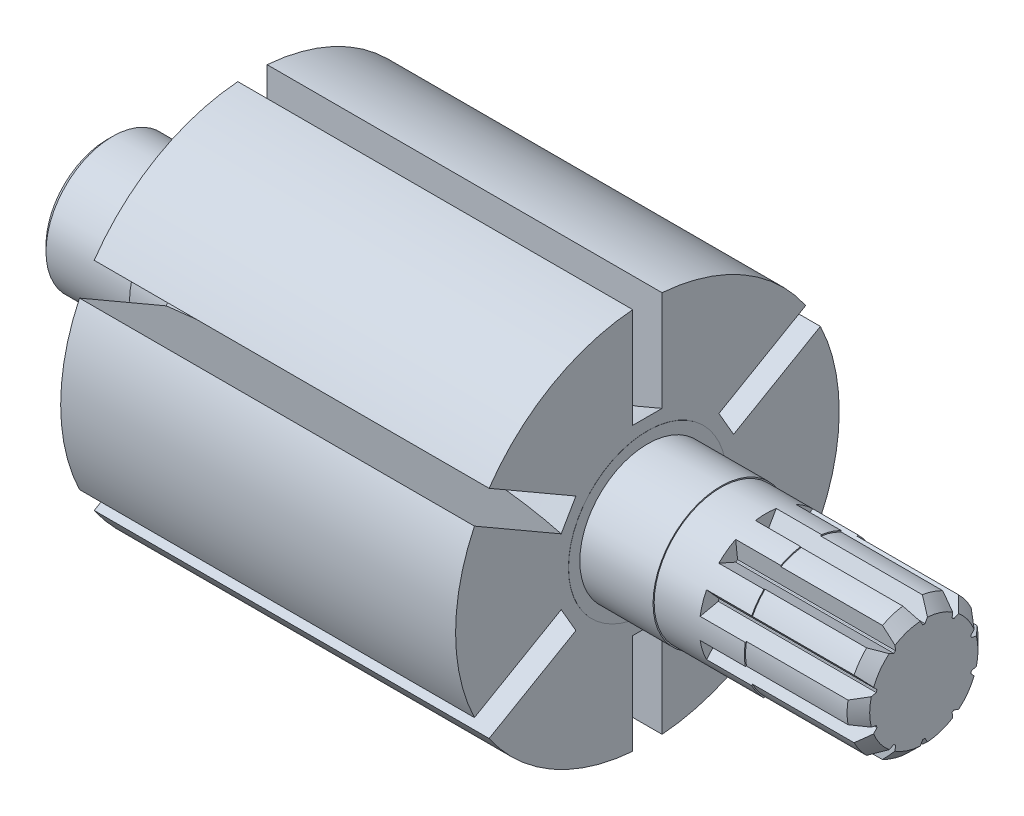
ISO-10303-21;
HEADER;
FILE_DESCRIPTION(('STEP AP214'),'2;1');
FILE_NAME('part.step','',(''),(''),'','','');
FILE_SCHEMA(('AUTOMOTIVE_DESIGN { 1 0 10303 214 1 1 1 1 }'));
ENDSEC;
DATA;
#1=APPLICATION_CONTEXT('core data for automotive mechanical design processes');
#2=APPLICATION_PROTOCOL_DEFINITION('international standard','automotive_design',2000,#1);
#3=PRODUCT_CONTEXT('',#1,'mechanical');
#4=PRODUCT('Part','Part','',(#3));
#5=PRODUCT_RELATED_PRODUCT_CATEGORY('part','',(#4));
#6=PRODUCT_DEFINITION_FORMATION('','',#4);
#7=PRODUCT_DEFINITION_CONTEXT('part definition',#1,'design');
#8=PRODUCT_DEFINITION('design','',#6,#7);
#9=PRODUCT_DEFINITION_SHAPE('','',#8);
#10=(LENGTH_UNIT() NAMED_UNIT(*) SI_UNIT(.MILLI.,.METRE.));
#11=(NAMED_UNIT(*) PLANE_ANGLE_UNIT() SI_UNIT($,.RADIAN.));
#12=(NAMED_UNIT(*) SI_UNIT($,.STERADIAN.) SOLID_ANGLE_UNIT());
#13=UNCERTAINTY_MEASURE_WITH_UNIT(LENGTH_MEASURE(1.E-05),#10,'distance_accuracy_value','');
#14=(GEOMETRIC_REPRESENTATION_CONTEXT(3) GLOBAL_UNCERTAINTY_ASSIGNED_CONTEXT((#13)) GLOBAL_UNIT_ASSIGNED_CONTEXT((#10,
#11,#12)) REPRESENTATION_CONTEXT('',''));
#15=CARTESIAN_POINT('',(0.,0.,0.));
#16=DIRECTION('',(0.,0.,1.));
#17=DIRECTION('',(1.,0.,0.));
#18=AXIS2_PLACEMENT_3D('',#15,#16,#17);
#19=CARTESIAN_POINT('',(-17.5,17.,0.));
#20=DIRECTION('',(1.,0.,0.));
#21=DIRECTION('',(0.,0.,-1.));
#22=AXIS2_PLACEMENT_3D('',#19,#20,#21);
#23=PLANE('',#22);
#24=DIRECTION('',(0.,-0.50000000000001,0.866025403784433));
#25=VECTOR('',#24,1.);
#26=CARTESIAN_POINT('',(-17.5,3.12416697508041,-8.01121593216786));
#27=LINE('',#26,#25);
#28=CARTESIAN_POINT('',(-17.5,7.34927759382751,-15.3293221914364));
#29=VERTEX_POINT('',#28);
#30=CARTESIAN_POINT('',(-17.5,2.90892077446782,-7.63839857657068));
#31=VERTEX_POINT('',#30);
#32=EDGE_CURVE('E1455',#29,#31,#27,.T.);
#33=ORIENTED_EDGE('',*,*,#32,.F.);
#34=CARTESIAN_POINT('',(-17.5,0.,0.));
#35=DIRECTION('',(-1.,0.,0.));
#36=DIRECTION('',(0.,0.,1.));
#37=AXIS2_PLACEMENT_3D('',#34,#35,#36);
#38=CIRCLE('',#37,17.);
#39=CARTESIAN_POINT('',(-17.5,-7.34927759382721,-15.3293221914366));
#40=VERTEX_POINT('',#39);
#41=EDGE_CURVE('E1562',#29,#40,#38,.T.);
#42=ORIENTED_EDGE('',*,*,#41,.T.);
#43=DIRECTION('',(0.,0.499999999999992,0.866025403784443));
#44=VECTOR('',#43,1.);
#45=CARTESIAN_POINT('',(-17.5,5.37583302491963,6.71121593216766));
#46=LINE('',#45,#44);
#47=CARTESIAN_POINT('',(-17.5,-2.90892077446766,-7.63839857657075));
#48=VERTEX_POINT('',#47);
#49=EDGE_CURVE('E1468',#40,#48,#46,.T.);
#50=ORIENTED_EDGE('',*,*,#49,.T.);
#51=DIRECTION('',(0.,0.866025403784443,-0.499999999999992));
#52=VECTOR('',#51,1.);
#53=CARTESIAN_POINT('',(-17.5,-5.16058682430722,-6.33839857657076));
#54=LINE('',#53,#52);
#55=CARTESIAN_POINT('',(-17.5,-5.16058682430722,-6.33839857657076));
#56=VERTEX_POINT('',#55);
#57=EDGE_CURVE('E1642',#48,#56,#54,.F.);
#58=ORIENTED_EDGE('',*,*,#57,.T.);
#59=DIRECTION('',(0.,0.499999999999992,0.866025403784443));
#60=VECTOR('',#59,1.);
#61=CARTESIAN_POINT('',(-17.5,3.12416697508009,8.01121593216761));
#62=LINE('',#61,#60);
#63=CARTESIAN_POINT('',(-17.5,-9.60094364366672,-14.0293221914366));
#64=VERTEX_POINT('',#63);
#65=EDGE_CURVE('E1474',#64,#56,#62,.T.);
#66=ORIENTED_EDGE('',*,*,#65,.F.);
#67=CARTESIAN_POINT('',(-17.5,-16.9502212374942,-1.30000000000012));
#68=VERTEX_POINT('',#67);
#69=EDGE_CURVE('E2753',#64,#68,#38,.T.);
#70=ORIENTED_EDGE('',*,*,#69,.T.);
#71=DIRECTION('',(0.,1.,0.));
#72=VECTOR('',#71,1.);
#73=CARTESIAN_POINT('',(-17.5,17.,-1.29999999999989));
#74=LINE('',#73,#72);
#75=CARTESIAN_POINT('',(-17.5,-8.06950759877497,-1.30000000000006));
#76=VERTEX_POINT('',#75);
#77=EDGE_CURVE('E1487',#68,#76,#74,.T.);
#78=ORIENTED_EDGE('',*,*,#77,.T.);
#79=DIRECTION('',(0.,0.,-1.));
#80=VECTOR('',#79,1.);
#81=CARTESIAN_POINT('',(-17.5,-8.06950759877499,1.29999999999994));
#82=LINE('',#81,#80);
#83=CARTESIAN_POINT('',(-17.5,-8.06950759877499,1.29999999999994));
#84=VERTEX_POINT('',#83);
#85=EDGE_CURVE('E1634',#76,#84,#82,.F.);
#86=ORIENTED_EDGE('',*,*,#85,.T.);
#87=DIRECTION('',(0.,1.,0.));
#88=VECTOR('',#87,1.);
#89=CARTESIAN_POINT('',(-17.5,17.,1.30000000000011));
#90=LINE('',#89,#88);
#91=CARTESIAN_POINT('',(-17.5,-16.9502212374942,1.29999999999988));
#92=VERTEX_POINT('',#91);
#93=EDGE_CURVE('E1493',#92,#84,#90,.T.);
#94=ORIENTED_EDGE('',*,*,#93,.F.);
#95=CARTESIAN_POINT('',(-17.5000000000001,-9.60094364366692,14.0293221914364));
#96=VERTEX_POINT('',#95);
#97=EDGE_CURVE('E2755',#92,#96,#38,.T.);
#98=ORIENTED_EDGE('',*,*,#97,.T.);
#99=DIRECTION('',(0.,0.500000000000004,-0.866025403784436));
#100=VECTOR('',#99,1.);
#101=CARTESIAN_POINT('',(-17.5,3.1241669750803,-8.0112159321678));
#102=LINE('',#101,#100);
#103=CARTESIAN_POINT('',(-17.5,-5.16058682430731,6.33839857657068));
#104=VERTEX_POINT('',#103);
#105=EDGE_CURVE('E1506',#96,#104,#102,.T.);
#106=ORIENTED_EDGE('',*,*,#105,.T.);
#107=DIRECTION('',(0.,-0.866025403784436,-0.500000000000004));
#108=VECTOR('',#107,1.);
#109=CARTESIAN_POINT('',(-17.5,-2.90892077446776,7.63839857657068));
#110=LINE('',#109,#108);
#111=CARTESIAN_POINT('',(-17.5,-2.90892077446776,7.63839857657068));
#112=VERTEX_POINT('',#111);
#113=EDGE_CURVE('E1626',#104,#112,#110,.F.);
#114=ORIENTED_EDGE('',*,*,#113,.T.);
#115=DIRECTION('',(0.,0.500000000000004,-0.866025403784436));
#116=VECTOR('',#115,1.);
#117=CARTESIAN_POINT('',(-17.5,5.37583302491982,-6.71121593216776));
#118=LINE('',#117,#116);
#119=CARTESIAN_POINT('',(-17.5,-7.34927759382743,15.3293221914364));
#120=VERTEX_POINT('',#119);
#121=EDGE_CURVE('E1512',#120,#112,#118,.T.);
#122=ORIENTED_EDGE('',*,*,#121,.F.);
#123=CARTESIAN_POINT('',(-17.5000000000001,7.34927759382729,15.3293221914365));
#124=VERTEX_POINT('',#123);
#125=EDGE_CURVE('E2756',#120,#124,#38,.T.);
#126=ORIENTED_EDGE('',*,*,#125,.T.);
#127=DIRECTION('',(0.,-0.499999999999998,-0.86602540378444));
#128=VECTOR('',#127,1.);
#129=CARTESIAN_POINT('',(-17.5,3.12416697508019,8.01121593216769));
#130=LINE('',#129,#128);
#131=CARTESIAN_POINT('',(-17.5,2.90892077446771,7.63839857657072));
#132=VERTEX_POINT('',#131);
#133=EDGE_CURVE('E1613',#124,#132,#130,.T.);
#134=ORIENTED_EDGE('',*,*,#133,.T.);
#135=DIRECTION('',(0.,-0.86602540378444,0.499999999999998));
#136=VECTOR('',#135,1.);
#137=CARTESIAN_POINT('',(-17.5,5.16058682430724,6.33839857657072));
#138=LINE('',#137,#136);
#139=CARTESIAN_POINT('',(-17.5,5.16058682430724,6.33839857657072));
#140=VERTEX_POINT('',#139);
#141=EDGE_CURVE('E1616',#132,#140,#138,.F.);
#142=ORIENTED_EDGE('',*,*,#141,.T.);
#143=DIRECTION('',(0.,-0.499999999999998,-0.86602540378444));
#144=VECTOR('',#143,1.);
#145=CARTESIAN_POINT('',(-17.5,5.37583302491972,6.71121593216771));
#146=LINE('',#145,#144);
#147=CARTESIAN_POINT('',(-17.5,9.60094364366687,14.0293221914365));
#148=VERTEX_POINT('',#147);
#149=EDGE_CURVE('E1619',#148,#140,#146,.T.);
#150=ORIENTED_EDGE('',*,*,#149,.F.);
#151=CARTESIAN_POINT('',(-17.5,16.9502212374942,1.29999999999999));
#152=VERTEX_POINT('',#151);
#153=EDGE_CURVE('E1557',#148,#152,#38,.T.);
#154=ORIENTED_EDGE('',*,*,#153,.T.);
#155=DIRECTION('',(0.,-1.,0.));
#156=VECTOR('',#155,1.);
#157=CARTESIAN_POINT('',(-17.5,17.,1.29999999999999));
#158=LINE('',#157,#156);
#159=CARTESIAN_POINT('',(-17.5,8.06950759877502,1.29999999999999));
#160=VERTEX_POINT('',#159);
#161=EDGE_CURVE('E1605',#152,#160,#158,.T.);
#162=ORIENTED_EDGE('',*,*,#161,.T.);
#163=DIRECTION('',(0.,0.,1.));
#164=VECTOR('',#163,1.);
#165=CARTESIAN_POINT('',(-17.5,8.06950759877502,-1.30000000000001));
#166=LINE('',#165,#164);
#167=CARTESIAN_POINT('',(-17.5,8.06950759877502,-1.30000000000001));
#168=VERTEX_POINT('',#167);
#169=EDGE_CURVE('E1608',#160,#168,#166,.F.);
#170=ORIENTED_EDGE('',*,*,#169,.T.);
#171=DIRECTION('',(0.,-1.,0.));
#172=VECTOR('',#171,1.);
#173=CARTESIAN_POINT('',(-17.5,17.,-1.30000000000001));
#174=LINE('',#173,#172);
#175=CARTESIAN_POINT('',(-17.5,16.9502212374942,-1.30000000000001));
#176=VERTEX_POINT('',#175);
#177=EDGE_CURVE('E1611',#176,#168,#174,.T.);
#178=ORIENTED_EDGE('',*,*,#177,.F.);
#179=CARTESIAN_POINT('',(-17.5,9.60094364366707,-14.0293221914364));
#180=VERTEX_POINT('',#179);
#181=EDGE_CURVE('E1558',#176,#180,#38,.T.);
#182=ORIENTED_EDGE('',*,*,#181,.T.);
#183=DIRECTION('',(0.,-0.50000000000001,0.866025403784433));
#184=VECTOR('',#183,1.);
#185=CARTESIAN_POINT('',(-17.5,5.37583302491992,-6.71121593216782));
#186=LINE('',#185,#184);
#187=CARTESIAN_POINT('',(-17.5,5.16058682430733,-6.33839857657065));
#188=VERTEX_POINT('',#187);
#189=EDGE_CURVE('E1449',#180,#188,#186,.T.);
#190=ORIENTED_EDGE('',*,*,#189,.T.);
#191=DIRECTION('',(0.,0.866025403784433,0.50000000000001));
#192=VECTOR('',#191,1.);
#193=CARTESIAN_POINT('',(-17.5,2.90892077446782,-7.63839857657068));
#194=LINE('',#193,#192);
#195=EDGE_CURVE('E1650',#188,#31,#194,.F.);
#196=ORIENTED_EDGE('',*,*,#195,.T.);
#197=EDGE_LOOP('',(#33,#42,#50,#58,#66,#70,#78,#86,#94,#98,#106,#114,#122,#126,#134,#142,#150,
#154,#162,#170,#178,#182,#190,#196));
#198=FACE_BOUND('',#197,.T.);
#199=CARTESIAN_POINT('',(-17.5,0.,0.));
#200=DIRECTION('',(1.,0.,0.));
#201=DIRECTION('',(0.,0.,-1.));
#202=AXIS2_PLACEMENT_3D('',#199,#200,#201);
#203=CIRCLE('',#202,7.);
#204=CARTESIAN_POINT('',(-17.5,0.,-7.00000000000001));
#205=VERTEX_POINT('',#204);
#206=EDGE_CURVE('E13',#205,#205,#203,.F.);
#207=ORIENTED_EDGE('',*,*,#206,.F.);
#208=EDGE_LOOP('',(#207));
#209=FACE_BOUND('',#208,.T.);
#210=ADVANCED_FACE('F358',(#198,#209),#23,.F.);
#211=CARTESIAN_POINT('',(17.5,17.,0.));
#212=DIRECTION('',(-1.,0.,0.));
#213=DIRECTION('',(0.,0.,1.));
#214=AXIS2_PLACEMENT_3D('',#211,#212,#213);
#215=PLANE('',#214);
#216=DIRECTION('',(0.,0.50000000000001,-0.866025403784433));
#217=VECTOR('',#216,1.);
#218=CARTESIAN_POINT('',(17.5,3.12416697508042,-8.01121593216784));
#219=LINE('',#218,#217);
#220=CARTESIAN_POINT('',(17.5,2.90892077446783,-7.63839857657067));
#221=VERTEX_POINT('',#220);
#222=CARTESIAN_POINT('',(17.5,7.34927759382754,-15.3293221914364));
#223=VERTEX_POINT('',#222);
#224=EDGE_CURVE('E1457',#221,#223,#219,.T.);
#225=ORIENTED_EDGE('',*,*,#224,.F.);
#226=DIRECTION('',(0.,0.866025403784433,0.50000000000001));
#227=VECTOR('',#226,1.);
#228=CARTESIAN_POINT('',(17.5,2.90892077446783,-7.63839857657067));
#229=LINE('',#228,#227);
#230=CARTESIAN_POINT('',(17.5,5.16058682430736,-6.33839857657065));
#231=VERTEX_POINT('',#230);
#232=EDGE_CURVE('E1459',#221,#231,#229,.T.);
#233=ORIENTED_EDGE('',*,*,#232,.T.);
#234=DIRECTION('',(0.,0.50000000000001,-0.866025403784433));
#235=VECTOR('',#234,1.);
#236=CARTESIAN_POINT('',(17.5,5.37583302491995,-6.71121593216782));
#237=LINE('',#236,#235);
#238=CARTESIAN_POINT('',(17.5,9.60094364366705,-14.0293221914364));
#239=VERTEX_POINT('',#238);
#240=EDGE_CURVE('E1452',#231,#239,#237,.T.);
#241=ORIENTED_EDGE('',*,*,#240,.T.);
#242=CARTESIAN_POINT('',(17.5,0.,0.));
#243=DIRECTION('',(-1.,0.,0.));
#244=DIRECTION('',(0.,0.,1.));
#245=AXIS2_PLACEMENT_3D('',#242,#243,#244);
#246=CIRCLE('',#245,17.);
#247=CARTESIAN_POINT('',(17.5,16.9502212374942,-1.29999999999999));
#248=VERTEX_POINT('',#247);
#249=EDGE_CURVE('E1585',#248,#239,#246,.T.);
#250=ORIENTED_EDGE('',*,*,#249,.F.);
#251=DIRECTION('',(0.,1.,0.));
#252=VECTOR('',#251,1.);
#253=CARTESIAN_POINT('',(17.5,17.,-1.29999999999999));
#254=LINE('',#253,#252);
#255=CARTESIAN_POINT('',(17.5,8.069507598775,-1.29999999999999));
#256=VERTEX_POINT('',#255);
#257=EDGE_CURVE('E1552',#256,#248,#254,.T.);
#258=ORIENTED_EDGE('',*,*,#257,.F.);
#259=DIRECTION('',(0.,0.,1.));
#260=VECTOR('',#259,1.);
#261=CARTESIAN_POINT('',(17.5,8.069507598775,-1.29999999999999));
#262=LINE('',#261,#260);
#263=CARTESIAN_POINT('',(17.5,8.069507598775,1.30000000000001));
#264=VERTEX_POINT('',#263);
#265=EDGE_CURVE('E1554',#256,#264,#262,.T.);
#266=ORIENTED_EDGE('',*,*,#265,.T.);
#267=DIRECTION('',(0.,1.,0.));
#268=VECTOR('',#267,1.);
#269=CARTESIAN_POINT('',(17.5,17.,1.30000000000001));
#270=LINE('',#269,#268);
#271=CARTESIAN_POINT('',(17.5,16.9502212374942,1.30000000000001));
#272=VERTEX_POINT('',#271);
#273=EDGE_CURVE('E1547',#264,#272,#270,.T.);
#274=ORIENTED_EDGE('',*,*,#273,.T.);
#275=CARTESIAN_POINT('',(17.5,9.60094364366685,14.0293221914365));
#276=VERTEX_POINT('',#275);
#277=EDGE_CURVE('E1584',#276,#272,#246,.T.);
#278=ORIENTED_EDGE('',*,*,#277,.F.);
#279=DIRECTION('',(0.,0.499999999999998,0.86602540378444));
#280=VECTOR('',#279,1.);
#281=CARTESIAN_POINT('',(17.5,5.37583302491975,6.71121593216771));
#282=LINE('',#281,#280);
#283=CARTESIAN_POINT('',(17.5,5.16058682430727,6.33839857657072));
#284=VERTEX_POINT('',#283);
#285=EDGE_CURVE('E1533',#284,#276,#282,.T.);
#286=ORIENTED_EDGE('',*,*,#285,.F.);
#287=DIRECTION('',(0.,-0.86602540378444,0.499999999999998));
#288=VECTOR('',#287,1.);
#289=CARTESIAN_POINT('',(17.5,5.16058682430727,6.33839857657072));
#290=LINE('',#289,#288);
#291=CARTESIAN_POINT('',(17.5,2.90892077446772,7.63839857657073));
#292=VERTEX_POINT('',#291);
#293=EDGE_CURVE('E1535',#284,#292,#290,.T.);
#294=ORIENTED_EDGE('',*,*,#293,.T.);
#295=DIRECTION('',(0.,0.499999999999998,0.86602540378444));
#296=VECTOR('',#295,1.);
#297=CARTESIAN_POINT('',(17.5,3.1241669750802,8.01121593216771));
#298=LINE('',#297,#296);
#299=CARTESIAN_POINT('',(17.5,7.34927759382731,15.3293221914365));
#300=VERTEX_POINT('',#299);
#301=EDGE_CURVE('E1528',#292,#300,#298,.T.);
#302=ORIENTED_EDGE('',*,*,#301,.T.);
#303=CARTESIAN_POINT('',(17.5,-7.3492775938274,15.3293221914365));
#304=VERTEX_POINT('',#303);
#305=EDGE_CURVE('E2732',#304,#300,#246,.T.);
#306=ORIENTED_EDGE('',*,*,#305,.F.);
#307=DIRECTION('',(0.,-0.500000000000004,0.866025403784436));
#308=VECTOR('',#307,1.);
#309=CARTESIAN_POINT('',(17.5,5.37583302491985,-6.71121593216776));
#310=LINE('',#309,#308);
#311=CARTESIAN_POINT('',(17.5,-2.90892077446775,7.63839857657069));
#312=VERTEX_POINT('',#311);
#313=EDGE_CURVE('E1514',#312,#304,#310,.T.);
#314=ORIENTED_EDGE('',*,*,#313,.F.);
#315=DIRECTION('',(0.,-0.866025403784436,-0.500000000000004));
#316=VECTOR('',#315,1.);
#317=CARTESIAN_POINT('',(17.5,-2.90892077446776,7.6383985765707));
#318=LINE('',#317,#316);
#319=CARTESIAN_POINT('',(17.5,-5.16058682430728,6.33839857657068));
#320=VERTEX_POINT('',#319);
#321=EDGE_CURVE('E1516',#312,#320,#318,.T.);
#322=ORIENTED_EDGE('',*,*,#321,.T.);
#323=DIRECTION('',(0.,-0.500000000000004,0.866025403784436));
#324=VECTOR('',#323,1.);
#325=CARTESIAN_POINT('',(17.5,3.12416697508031,-8.01121593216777));
#326=LINE('',#325,#324);
#327=CARTESIAN_POINT('',(17.5,-9.60094364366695,14.0293221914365));
#328=VERTEX_POINT('',#327);
#329=EDGE_CURVE('E1509',#320,#328,#326,.T.);
#330=ORIENTED_EDGE('',*,*,#329,.T.);
#331=CARTESIAN_POINT('',(17.5,-16.9502212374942,1.29999999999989));
#332=VERTEX_POINT('',#331);
#333=EDGE_CURVE('E2733',#332,#328,#246,.T.);
#334=ORIENTED_EDGE('',*,*,#333,.F.);
#335=DIRECTION('',(0.,-1.,0.));
#336=VECTOR('',#335,1.);
#337=CARTESIAN_POINT('',(17.5,17.,1.30000000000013));
#338=LINE('',#337,#336);
#339=CARTESIAN_POINT('',(17.5,-8.06950759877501,1.29999999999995));
#340=VERTEX_POINT('',#339);
#341=EDGE_CURVE('E1495',#340,#332,#338,.T.);
#342=ORIENTED_EDGE('',*,*,#341,.F.);
#343=DIRECTION('',(0.,0.,-1.));
#344=VECTOR('',#343,1.);
#345=CARTESIAN_POINT('',(17.5,-8.06950759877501,1.29999999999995));
#346=LINE('',#345,#344);
#347=CARTESIAN_POINT('',(17.5,-8.06950759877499,-1.30000000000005));
#348=VERTEX_POINT('',#347);
#349=EDGE_CURVE('E1497',#340,#348,#346,.T.);
#350=ORIENTED_EDGE('',*,*,#349,.T.);
#351=DIRECTION('',(0.,-1.,0.));
#352=VECTOR('',#351,1.);
#353=CARTESIAN_POINT('',(17.5,17.,-1.29999999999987));
#354=LINE('',#353,#352);
#355=CARTESIAN_POINT('',(17.5,-16.9502212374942,-1.30000000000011));
#356=VERTEX_POINT('',#355);
#357=EDGE_CURVE('E1490',#348,#356,#354,.T.);
#358=ORIENTED_EDGE('',*,*,#357,.T.);
#359=CARTESIAN_POINT('',(17.5,-9.60094364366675,-14.0293221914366));
#360=VERTEX_POINT('',#359);
#361=EDGE_CURVE('E2737',#360,#356,#246,.T.);
#362=ORIENTED_EDGE('',*,*,#361,.F.);
#363=DIRECTION('',(0.,-0.499999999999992,-0.866025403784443));
#364=VECTOR('',#363,1.);
#365=CARTESIAN_POINT('',(17.5,3.1241669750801,8.01121593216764));
#366=LINE('',#365,#364);
#367=CARTESIAN_POINT('',(17.5,-5.1605868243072,-6.33839857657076));
#368=VERTEX_POINT('',#367);
#369=EDGE_CURVE('E1476',#368,#360,#366,.T.);
#370=ORIENTED_EDGE('',*,*,#369,.F.);
#371=DIRECTION('',(0.,0.866025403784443,-0.499999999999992));
#372=VECTOR('',#371,1.);
#373=CARTESIAN_POINT('',(17.5,-5.1605868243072,-6.33839857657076));
#374=LINE('',#373,#372);
#375=CARTESIAN_POINT('',(17.5,-2.90892077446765,-7.63839857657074));
#376=VERTEX_POINT('',#375);
#377=EDGE_CURVE('E1478',#368,#376,#374,.T.);
#378=ORIENTED_EDGE('',*,*,#377,.T.);
#379=DIRECTION('',(0.,-0.499999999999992,-0.866025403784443));
#380=VECTOR('',#379,1.);
#381=CARTESIAN_POINT('',(17.5,5.37583302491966,6.71121593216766));
#382=LINE('',#381,#380);
#383=CARTESIAN_POINT('',(17.5,-7.34927759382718,-15.3293221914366));
#384=VERTEX_POINT('',#383);
#385=EDGE_CURVE('E1471',#376,#384,#382,.T.);
#386=ORIENTED_EDGE('',*,*,#385,.T.);
#387=EDGE_CURVE('E1589',#223,#384,#246,.T.);
#388=ORIENTED_EDGE('',*,*,#387,.F.);
#389=EDGE_LOOP('',(#225,#233,#241,#250,#258,#266,#274,#278,#286,#294,#302,#306,#314,#322,#330,
#334,#342,#350,#358,#362,#370,#378,#386,#388));
#390=FACE_BOUND('',#389,.T.);
#391=CARTESIAN_POINT('',(17.5,0.,0.));
#392=DIRECTION('',(-1.,0.,0.));
#393=DIRECTION('',(0.,0.,1.));
#394=AXIS2_PLACEMENT_3D('',#391,#392,#393);
#395=CIRCLE('',#394,7.);
#396=CARTESIAN_POINT('',(17.5,0.,7.00000000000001));
#397=VERTEX_POINT('',#396);
#398=EDGE_CURVE('E366',#397,#397,#395,.F.);
#399=ORIENTED_EDGE('',*,*,#398,.F.);
#400=EDGE_LOOP('',(#399));
#401=FACE_BOUND('',#400,.T.);
#402=ADVANCED_FACE('F1777',(#390,#401),#215,.F.);
#403=CARTESIAN_POINT('',(-130.,0.,0.));
#404=DIRECTION('',(-1.,0.,0.));
#405=DIRECTION('',(0.,0.,1.));
#406=AXIS2_PLACEMENT_3D('',#403,#404,#405);
#407=CYLINDRICAL_SURFACE('',#406,17.);
#408=DIRECTION('',(-1.,0.,0.));
#409=VECTOR('',#408,1.);
#410=CARTESIAN_POINT('',(-130.,7.34927759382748,-15.3293221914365));
#411=LINE('',#410,#409);
#412=EDGE_CURVE('E1648',#223,#29,#411,.T.);
#413=ORIENTED_EDGE('',*,*,#412,.F.);
#414=ORIENTED_EDGE('',*,*,#387,.T.);
#415=DIRECTION('',(-1.,0.,0.));
#416=VECTOR('',#415,1.);
#417=CARTESIAN_POINT('',(-130.,-7.34927759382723,-15.3293221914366));
#418=LINE('',#417,#416);
#419=EDGE_CURVE('E1637',#384,#40,#418,.T.);
#420=ORIENTED_EDGE('',*,*,#419,.T.);
#421=ORIENTED_EDGE('',*,*,#41,.F.);
#422=EDGE_LOOP('',(#413,#414,#420,#421));
#423=FACE_BOUND('',#422,.T.);
#424=ADVANCED_FACE('F1784',(#423),#407,.T.);
#425=DIRECTION('',(-1.,0.,0.));
#426=VECTOR('',#425,1.);
#427=CARTESIAN_POINT('',(-130.,-9.60094364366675,-14.0293221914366));
#428=LINE('',#427,#426);
#429=EDGE_CURVE('E1640',#360,#64,#428,.T.);
#430=ORIENTED_EDGE('',*,*,#429,.F.);
#431=ORIENTED_EDGE('',*,*,#361,.T.);
#432=DIRECTION('',(-1.,0.,0.));
#433=VECTOR('',#432,1.);
#434=CARTESIAN_POINT('',(-130.,-16.9502212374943,-1.30000000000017));
#435=LINE('',#434,#433);
#436=EDGE_CURVE('E1629',#356,#68,#435,.T.);
#437=ORIENTED_EDGE('',*,*,#436,.T.);
#438=ORIENTED_EDGE('',*,*,#69,.F.);
#439=EDGE_LOOP('',(#430,#431,#437,#438));
#440=FACE_BOUND('',#439,.T.);
#441=ADVANCED_FACE('F2685',(#440),#407,.T.);
#442=DIRECTION('',(-1.,0.,0.));
#443=VECTOR('',#442,1.);
#444=CARTESIAN_POINT('',(-130.,-16.9502212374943,1.29999999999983));
#445=LINE('',#444,#443);
#446=EDGE_CURVE('E1632',#332,#92,#445,.T.);
#447=ORIENTED_EDGE('',*,*,#446,.F.);
#448=ORIENTED_EDGE('',*,*,#333,.T.);
#449=DIRECTION('',(-1.,0.,0.));
#450=VECTOR('',#449,1.);
#451=CARTESIAN_POINT('',(-130.,-9.60094364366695,14.0293221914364));
#452=LINE('',#451,#450);
#453=EDGE_CURVE('E1621',#328,#96,#452,.T.);
#454=ORIENTED_EDGE('',*,*,#453,.T.);
#455=ORIENTED_EDGE('',*,*,#97,.F.);
#456=EDGE_LOOP('',(#447,#448,#454,#455));
#457=FACE_BOUND('',#456,.T.);
#458=ADVANCED_FACE('F2690',(#457),#407,.T.);
#459=DIRECTION('',(-1.,0.,0.));
#460=VECTOR('',#459,1.);
#461=CARTESIAN_POINT('',(-130.,-7.34927759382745,15.3293221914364));
#462=LINE('',#461,#460);
#463=EDGE_CURVE('E1624',#304,#120,#462,.T.);
#464=ORIENTED_EDGE('',*,*,#463,.F.);
#465=ORIENTED_EDGE('',*,*,#305,.T.);
#466=DIRECTION('',(-1.,0.,0.));
#467=VECTOR('',#466,1.);
#468=CARTESIAN_POINT('',(-130.,7.34927759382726,15.3293221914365));
#469=LINE('',#468,#467);
#470=EDGE_CURVE('E1525',#300,#124,#469,.T.);
#471=ORIENTED_EDGE('',*,*,#470,.T.);
#472=ORIENTED_EDGE('',*,*,#125,.F.);
#473=EDGE_LOOP('',(#464,#465,#471,#472));
#474=FACE_BOUND('',#473,.T.);
#475=ADVANCED_FACE('F2695',(#474),#407,.T.);
#476=DIRECTION('',(-1.,0.,0.));
#477=VECTOR('',#476,1.);
#478=CARTESIAN_POINT('',(-130.,9.60094364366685,14.0293221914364));
#479=LINE('',#478,#477);
#480=EDGE_CURVE('E1531',#276,#148,#479,.T.);
#481=ORIENTED_EDGE('',*,*,#480,.F.);
#482=ORIENTED_EDGE('',*,*,#277,.T.);
#483=DIRECTION('',(-1.,0.,0.));
#484=VECTOR('',#483,1.);
#485=CARTESIAN_POINT('',(-130.,16.9502212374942,1.29999999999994));
#486=LINE('',#485,#484);
#487=EDGE_CURVE('E1544',#272,#152,#486,.T.);
#488=ORIENTED_EDGE('',*,*,#487,.T.);
#489=ORIENTED_EDGE('',*,*,#153,.F.);
#490=EDGE_LOOP('',(#481,#482,#488,#489));
#491=FACE_BOUND('',#490,.T.);
#492=ADVANCED_FACE('F2700',(#491),#407,.T.);
#493=ORIENTED_EDGE('',*,*,#249,.T.);
#494=DIRECTION('',(-1.,0.,0.));
#495=VECTOR('',#494,1.);
#496=CARTESIAN_POINT('',(-130.,9.60094364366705,-14.0293221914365));
#497=LINE('',#496,#495);
#498=EDGE_CURVE('E1645',#239,#180,#497,.T.);
#499=ORIENTED_EDGE('',*,*,#498,.T.);
#500=ORIENTED_EDGE('',*,*,#181,.F.);
#501=DIRECTION('',(-1.,0.,0.));
#502=VECTOR('',#501,1.);
#503=CARTESIAN_POINT('',(-130.,16.9502212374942,-1.30000000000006));
#504=LINE('',#503,#502);
#505=EDGE_CURVE('E1550',#248,#176,#504,.T.);
#506=ORIENTED_EDGE('',*,*,#505,.F.);
#507=EDGE_LOOP('',(#493,#499,#500,#506));
#508=FACE_BOUND('',#507,.T.);
#509=ADVANCED_FACE('F360',(#508),#407,.T.);
#510=CARTESIAN_POINT('',(0.,46.25,-1.3));
#511=DIRECTION('',(0.,0.,1.));
#512=DIRECTION('',(1.,0.,0.));
#513=AXIS2_PLACEMENT_3D('',#510,#511,#512);
#514=CYLINDRICAL_SURFACE('',#513,42.);
#515=CARTESIAN_POINT('',(0.,46.25,-1.3));
#516=DIRECTION('',(0.,0.,1.));
#517=DIRECTION('',(1.,0.,0.));
#518=AXIS2_PLACEMENT_3D('',#515,#516,#517);
#519=CIRCLE('',#518,42.);
#520=EDGE_CURVE('E1541',#168,#256,#519,.T.);
#521=ORIENTED_EDGE('',*,*,#520,.F.);
#522=ORIENTED_EDGE('',*,*,#169,.F.);
#523=CARTESIAN_POINT('',(0.,46.25,1.3));
#524=DIRECTION('',(0.,0.,1.));
#525=DIRECTION('',(1.,0.,0.));
#526=AXIS2_PLACEMENT_3D('',#523,#524,#525);
#527=CIRCLE('',#526,42.);
#528=EDGE_CURVE('E1538',#160,#264,#527,.T.);
#529=ORIENTED_EDGE('',*,*,#528,.T.);
#530=ORIENTED_EDGE('',*,*,#265,.F.);
#531=EDGE_LOOP('',(#521,#522,#529,#530));
#532=FACE_BOUND('',#531,.T.);
#533=ADVANCED_FACE('F1753',(#532),#514,.F.);
#534=CARTESIAN_POINT('',(0.,46.25,-1.3));
#535=DIRECTION('',(0.,0.,1.));
#536=DIRECTION('',(1.,0.,0.));
#537=AXIS2_PLACEMENT_3D('',#534,#535,#536);
#538=PLANE('',#537);
#539=ORIENTED_EDGE('',*,*,#257,.T.);
#540=ORIENTED_EDGE('',*,*,#505,.T.);
#541=ORIENTED_EDGE('',*,*,#177,.T.);
#542=ORIENTED_EDGE('',*,*,#520,.T.);
#543=EDGE_LOOP('',(#539,#540,#541,#542));
#544=FACE_BOUND('',#543,.T.);
#545=ADVANCED_FACE('F1749',(#544),#538,.T.);
#546=CARTESIAN_POINT('',(0.,46.25,1.3));
#547=DIRECTION('',(0.,0.,1.));
#548=DIRECTION('',(1.,0.,0.));
#549=AXIS2_PLACEMENT_3D('',#546,#547,#548);
#550=PLANE('',#549);
#551=ORIENTED_EDGE('',*,*,#528,.F.);
#552=ORIENTED_EDGE('',*,*,#161,.F.);
#553=ORIENTED_EDGE('',*,*,#487,.F.);
#554=ORIENTED_EDGE('',*,*,#273,.F.);
#555=EDGE_LOOP('',(#551,#552,#553,#554));
#556=FACE_BOUND('',#555,.T.);
#557=ADVANCED_FACE('F1745',(#556),#550,.F.);
#558=CARTESIAN_POINT('',(0.,24.2508330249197,39.4036749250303));
#559=DIRECTION('',(0.,-0.86602540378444,0.499999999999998));
#560=DIRECTION('',(0.,-0.499999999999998,-0.86602540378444));
#561=AXIS2_PLACEMENT_3D('',#558,#559,#560);
#562=CYLINDRICAL_SURFACE('',#561,42.);
#563=CARTESIAN_POINT('',(0.,24.2508330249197,39.4036749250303));
#564=DIRECTION('',(0.,-0.86602540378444,0.499999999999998));
#565=DIRECTION('',(1.,0.,0.));
#566=AXIS2_PLACEMENT_3D('',#563,#564,#565);
#567=CIRCLE('',#566,42.);
#568=EDGE_CURVE('E1522',#140,#284,#567,.T.);
#569=ORIENTED_EDGE('',*,*,#568,.F.);
#570=ORIENTED_EDGE('',*,*,#141,.F.);
#571=CARTESIAN_POINT('',(0.,21.9991669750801,40.7036749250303));
#572=DIRECTION('',(0.,-0.86602540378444,0.499999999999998));
#573=DIRECTION('',(1.,0.,0.));
#574=AXIS2_PLACEMENT_3D('',#571,#572,#573);
#575=CIRCLE('',#574,42.);
#576=EDGE_CURVE('E1519',#132,#292,#575,.T.);
#577=ORIENTED_EDGE('',*,*,#576,.T.);
#578=ORIENTED_EDGE('',*,*,#293,.F.);
#579=EDGE_LOOP('',(#569,#570,#577,#578));
#580=FACE_BOUND('',#579,.T.);
#581=ADVANCED_FACE('F1741',(#580),#562,.F.);
#582=CARTESIAN_POINT('',(0.,24.2508330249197,39.4036749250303));
#583=DIRECTION('',(0.,-0.86602540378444,0.499999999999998));
#584=DIRECTION('',(1.,0.,0.));
#585=AXIS2_PLACEMENT_3D('',#582,#583,#584);
#586=PLANE('',#585);
#587=ORIENTED_EDGE('',*,*,#285,.T.);
#588=ORIENTED_EDGE('',*,*,#480,.T.);
#589=ORIENTED_EDGE('',*,*,#149,.T.);
#590=ORIENTED_EDGE('',*,*,#568,.T.);
#591=EDGE_LOOP('',(#587,#588,#589,#590));
#592=FACE_BOUND('',#591,.T.);
#593=ADVANCED_FACE('F1737',(#592),#586,.T.);
#594=CARTESIAN_POINT('',(0.,21.9991669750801,40.7036749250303));
#595=DIRECTION('',(0.,-0.86602540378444,0.499999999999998));
#596=DIRECTION('',(1.,0.,0.));
#597=AXIS2_PLACEMENT_3D('',#594,#595,#596);
#598=PLANE('',#597);
#599=ORIENTED_EDGE('',*,*,#576,.F.);
#600=ORIENTED_EDGE('',*,*,#133,.F.);
#601=ORIENTED_EDGE('',*,*,#470,.F.);
#602=ORIENTED_EDGE('',*,*,#301,.F.);
#603=EDGE_LOOP('',(#599,#600,#601,#602));
#604=FACE_BOUND('',#603,.T.);
#605=ADVANCED_FACE('F1733',(#604),#598,.F.);
#606=CARTESIAN_POINT('',(0.,-21.9991669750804,40.7036749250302));
#607=DIRECTION('',(0.,-0.866025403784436,-0.500000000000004));
#608=DIRECTION('',(0.,0.500000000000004,-0.866025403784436));
#609=AXIS2_PLACEMENT_3D('',#606,#607,#608);
#610=CYLINDRICAL_SURFACE('',#609,42.);
#611=CARTESIAN_POINT('',(0.,-21.9991669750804,40.7036749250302));
#612=DIRECTION('',(0.,-0.866025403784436,-0.500000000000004));
#613=DIRECTION('',(1.,0.,0.));
#614=AXIS2_PLACEMENT_3D('',#611,#612,#613);
#615=CIRCLE('',#614,42.);
#616=EDGE_CURVE('E1503',#112,#312,#615,.T.);
#617=ORIENTED_EDGE('',*,*,#616,.F.);
#618=ORIENTED_EDGE('',*,*,#113,.F.);
#619=CARTESIAN_POINT('',(0.,-24.25083302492,39.4036749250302));
#620=DIRECTION('',(0.,-0.866025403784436,-0.500000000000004));
#621=DIRECTION('',(1.,0.,0.));
#622=AXIS2_PLACEMENT_3D('',#619,#620,#621);
#623=CIRCLE('',#622,42.);
#624=EDGE_CURVE('E1500',#104,#320,#623,.T.);
#625=ORIENTED_EDGE('',*,*,#624,.T.);
#626=ORIENTED_EDGE('',*,*,#321,.F.);
#627=EDGE_LOOP('',(#617,#618,#625,#626));
#628=FACE_BOUND('',#627,.T.);
#629=ADVANCED_FACE('F1729',(#628),#610,.F.);
#630=CARTESIAN_POINT('',(0.,-21.9991669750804,40.7036749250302));
#631=DIRECTION('',(0.,-0.866025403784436,-0.500000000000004));
#632=DIRECTION('',(1.,0.,0.));
#633=AXIS2_PLACEMENT_3D('',#630,#631,#632);
#634=PLANE('',#633);
#635=ORIENTED_EDGE('',*,*,#313,.T.);
#636=ORIENTED_EDGE('',*,*,#463,.T.);
#637=ORIENTED_EDGE('',*,*,#121,.T.);
#638=ORIENTED_EDGE('',*,*,#616,.T.);
#639=EDGE_LOOP('',(#635,#636,#637,#638));
#640=FACE_BOUND('',#639,.T.);
#641=ADVANCED_FACE('F1725',(#640),#634,.T.);
#642=CARTESIAN_POINT('',(0.,-24.25083302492,39.4036749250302));
#643=DIRECTION('',(0.,-0.866025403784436,-0.500000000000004));
#644=DIRECTION('',(1.,0.,0.));
#645=AXIS2_PLACEMENT_3D('',#642,#643,#644);
#646=PLANE('',#645);
#647=ORIENTED_EDGE('',*,*,#624,.F.);
#648=ORIENTED_EDGE('',*,*,#105,.F.);
#649=ORIENTED_EDGE('',*,*,#453,.F.);
#650=ORIENTED_EDGE('',*,*,#329,.F.);
#651=EDGE_LOOP('',(#647,#648,#649,#650));
#652=FACE_BOUND('',#651,.T.);
#653=ADVANCED_FACE('F1721',(#652),#646,.F.);
#654=CARTESIAN_POINT('',(0.,-46.25,1.29999999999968));
#655=DIRECTION('',(0.,0.,-1.));
#656=DIRECTION('',(0.,1.,0.));
#657=AXIS2_PLACEMENT_3D('',#654,#655,#656);
#658=CYLINDRICAL_SURFACE('',#657,42.);
#659=CARTESIAN_POINT('',(0.,-46.25,1.29999999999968));
#660=DIRECTION('',(0.,0.,-1.));
#661=DIRECTION('',(1.,0.,0.));
#662=AXIS2_PLACEMENT_3D('',#659,#660,#661);
#663=CIRCLE('',#662,42.);
#664=EDGE_CURVE('E1484',#84,#340,#663,.T.);
#665=ORIENTED_EDGE('',*,*,#664,.F.);
#666=ORIENTED_EDGE('',*,*,#85,.F.);
#667=CARTESIAN_POINT('',(0.,-46.25,-1.30000000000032));
#668=DIRECTION('',(0.,0.,-1.));
#669=DIRECTION('',(1.,0.,0.));
#670=AXIS2_PLACEMENT_3D('',#667,#668,#669);
#671=CIRCLE('',#670,42.);
#672=EDGE_CURVE('E1481',#76,#348,#671,.T.);
#673=ORIENTED_EDGE('',*,*,#672,.T.);
#674=ORIENTED_EDGE('',*,*,#349,.F.);
#675=EDGE_LOOP('',(#665,#666,#673,#674));
#676=FACE_BOUND('',#675,.T.);
#677=ADVANCED_FACE('F1717',(#676),#658,.F.);
#678=CARTESIAN_POINT('',(0.,-46.25,1.29999999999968));
#679=DIRECTION('',(0.,0.,-1.));
#680=DIRECTION('',(1.,0.,0.));
#681=AXIS2_PLACEMENT_3D('',#678,#679,#680);
#682=PLANE('',#681);
#683=ORIENTED_EDGE('',*,*,#341,.T.);
#684=ORIENTED_EDGE('',*,*,#446,.T.);
#685=ORIENTED_EDGE('',*,*,#93,.T.);
#686=ORIENTED_EDGE('',*,*,#664,.T.);
#687=EDGE_LOOP('',(#683,#684,#685,#686));
#688=FACE_BOUND('',#687,.T.);
#689=ADVANCED_FACE('F1713',(#688),#682,.T.);
#690=CARTESIAN_POINT('',(0.,-46.25,-1.30000000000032));
#691=DIRECTION('',(0.,0.,-1.));
#692=DIRECTION('',(1.,0.,0.));
#693=AXIS2_PLACEMENT_3D('',#690,#691,#692);
#694=PLANE('',#693);
#695=ORIENTED_EDGE('',*,*,#672,.F.);
#696=ORIENTED_EDGE('',*,*,#77,.F.);
#697=ORIENTED_EDGE('',*,*,#436,.F.);
#698=ORIENTED_EDGE('',*,*,#357,.F.);
#699=EDGE_LOOP('',(#695,#696,#697,#698));
#700=FACE_BOUND('',#699,.T.);
#701=ADVANCED_FACE('F1709',(#700),#694,.F.);
#702=CARTESIAN_POINT('',(0.,-24.2508330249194,-39.4036749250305));
#703=DIRECTION('',(0.,0.866025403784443,-0.499999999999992));
#704=DIRECTION('',(0.,0.499999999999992,0.866025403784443));
#705=AXIS2_PLACEMENT_3D('',#702,#703,#704);
#706=CYLINDRICAL_SURFACE('',#705,42.);
#707=CARTESIAN_POINT('',(0.,-24.2508330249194,-39.4036749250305));
#708=DIRECTION('',(0.,0.866025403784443,-0.499999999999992));
#709=DIRECTION('',(1.,0.,0.));
#710=AXIS2_PLACEMENT_3D('',#707,#708,#709);
#711=CIRCLE('',#710,42.);
#712=EDGE_CURVE('E1465',#56,#368,#711,.T.);
#713=ORIENTED_EDGE('',*,*,#712,.F.);
#714=ORIENTED_EDGE('',*,*,#57,.F.);
#715=CARTESIAN_POINT('',(0.,-21.9991669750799,-40.7036749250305));
#716=DIRECTION('',(0.,0.866025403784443,-0.499999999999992));
#717=DIRECTION('',(1.,0.,0.));
#718=AXIS2_PLACEMENT_3D('',#715,#716,#717);
#719=CIRCLE('',#718,42.);
#720=EDGE_CURVE('E1462',#48,#376,#719,.T.);
#721=ORIENTED_EDGE('',*,*,#720,.T.);
#722=ORIENTED_EDGE('',*,*,#377,.F.);
#723=EDGE_LOOP('',(#713,#714,#721,#722));
#724=FACE_BOUND('',#723,.T.);
#725=ADVANCED_FACE('F1705',(#724),#706,.F.);
#726=CARTESIAN_POINT('',(0.,-24.2508330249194,-39.4036749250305));
#727=DIRECTION('',(0.,0.866025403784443,-0.499999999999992));
#728=DIRECTION('',(1.,0.,0.));
#729=AXIS2_PLACEMENT_3D('',#726,#727,#728);
#730=PLANE('',#729);
#731=ORIENTED_EDGE('',*,*,#369,.T.);
#732=ORIENTED_EDGE('',*,*,#429,.T.);
#733=ORIENTED_EDGE('',*,*,#65,.T.);
#734=ORIENTED_EDGE('',*,*,#712,.T.);
#735=EDGE_LOOP('',(#731,#732,#733,#734));
#736=FACE_BOUND('',#735,.T.);
#737=ADVANCED_FACE('F1701',(#736),#730,.T.);
#738=CARTESIAN_POINT('',(0.,-21.9991669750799,-40.7036749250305));
#739=DIRECTION('',(0.,0.866025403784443,-0.499999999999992));
#740=DIRECTION('',(1.,0.,0.));
#741=AXIS2_PLACEMENT_3D('',#738,#739,#740);
#742=PLANE('',#741);
#743=ORIENTED_EDGE('',*,*,#720,.F.);
#744=ORIENTED_EDGE('',*,*,#49,.F.);
#745=ORIENTED_EDGE('',*,*,#419,.F.);
#746=ORIENTED_EDGE('',*,*,#385,.F.);
#747=EDGE_LOOP('',(#743,#744,#745,#746));
#748=FACE_BOUND('',#747,.T.);
#749=ADVANCED_FACE('F1697',(#748),#742,.F.);
#750=CARTESIAN_POINT('',(0.,21.9991669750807,-40.70367492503));
#751=DIRECTION('',(0.,0.866025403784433,0.50000000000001));
#752=DIRECTION('',(0.,-0.50000000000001,0.866025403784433));
#753=AXIS2_PLACEMENT_3D('',#750,#751,#752);
#754=CYLINDRICAL_SURFACE('',#753,42.);
#755=CARTESIAN_POINT('',(0.,21.9991669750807,-40.70367492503));
#756=DIRECTION('',(0.,0.866025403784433,0.50000000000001));
#757=DIRECTION('',(1.,0.,0.));
#758=AXIS2_PLACEMENT_3D('',#755,#756,#757);
#759=CIRCLE('',#758,42.);
#760=EDGE_CURVE('E1446',#31,#221,#759,.T.);
#761=ORIENTED_EDGE('',*,*,#760,.F.);
#762=ORIENTED_EDGE('',*,*,#195,.F.);
#763=CARTESIAN_POINT('',(0.,24.2508330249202,-39.40367492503));
#764=DIRECTION('',(0.,0.866025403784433,0.50000000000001));
#765=DIRECTION('',(1.,0.,0.));
#766=AXIS2_PLACEMENT_3D('',#763,#764,#765);
#767=CIRCLE('',#766,42.);
#768=EDGE_CURVE('E1443',#188,#231,#767,.T.);
#769=ORIENTED_EDGE('',*,*,#768,.T.);
#770=ORIENTED_EDGE('',*,*,#232,.F.);
#771=EDGE_LOOP('',(#761,#762,#769,#770));
#772=FACE_BOUND('',#771,.T.);
#773=ADVANCED_FACE('F1693',(#772),#754,.F.);
#774=CARTESIAN_POINT('',(0.,21.9991669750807,-40.70367492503));
#775=DIRECTION('',(0.,0.866025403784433,0.50000000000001));
#776=DIRECTION('',(1.,0.,0.));
#777=AXIS2_PLACEMENT_3D('',#774,#775,#776);
#778=PLANE('',#777);
#779=ORIENTED_EDGE('',*,*,#224,.T.);
#780=ORIENTED_EDGE('',*,*,#412,.T.);
#781=ORIENTED_EDGE('',*,*,#32,.T.);
#782=ORIENTED_EDGE('',*,*,#760,.T.);
#783=EDGE_LOOP('',(#779,#780,#781,#782));
#784=FACE_BOUND('',#783,.T.);
#785=ADVANCED_FACE('F1689',(#784),#778,.T.);
#786=CARTESIAN_POINT('',(0.,24.2508330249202,-39.40367492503));
#787=DIRECTION('',(0.,0.866025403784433,0.50000000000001));
#788=DIRECTION('',(1.,0.,0.));
#789=AXIS2_PLACEMENT_3D('',#786,#787,#788);
#790=PLANE('',#789);
#791=ORIENTED_EDGE('',*,*,#768,.F.);
#792=ORIENTED_EDGE('',*,*,#189,.F.);
#793=ORIENTED_EDGE('',*,*,#498,.F.);
#794=ORIENTED_EDGE('',*,*,#240,.F.);
#795=EDGE_LOOP('',(#791,#792,#793,#794));
#796=FACE_BOUND('',#795,.T.);
#797=ADVANCED_FACE('F1685',(#796),#790,.F.);
#798=CARTESIAN_POINT('',(17.51,0.,0.));
#799=DIRECTION('',(1.,0.,0.));
#800=DIRECTION('',(0.,0.,-1.));
#801=AXIS2_PLACEMENT_3D('',#798,#799,#800);
#802=PLANE('',#801);
#803=CARTESIAN_POINT('',(17.51,0.,0.));
#804=DIRECTION('',(1.,0.,0.));
#805=DIRECTION('',(0.,0.,-1.));
#806=AXIS2_PLACEMENT_3D('',#803,#804,#805);
#807=CIRCLE('',#806,7.);
#808=CARTESIAN_POINT('',(17.51,0.,7.00000000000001));
#809=VERTEX_POINT('',#808);
#810=EDGE_CURVE('E1835',#809,#809,#807,.T.);
#811=ORIENTED_EDGE('',*,*,#810,.T.);
#812=EDGE_LOOP('',(#811));
#813=FACE_BOUND('',#812,.T.);
#814=CARTESIAN_POINT('',(17.51,0.,0.));
#815=DIRECTION('',(1.,0.,0.));
#816=DIRECTION('',(0.,0.,-1.));
#817=AXIS2_PLACEMENT_3D('',#814,#815,#816);
#818=CIRCLE('',#817,6.);
#819=CARTESIAN_POINT('',(17.51,0.,-5.99999999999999));
#820=VERTEX_POINT('',#819);
#821=EDGE_CURVE('E1829',#820,#820,#818,.T.);
#822=ORIENTED_EDGE('',*,*,#821,.F.);
#823=EDGE_LOOP('',(#822));
#824=FACE_BOUND('',#823,.T.);
#825=ADVANCED_FACE('F1688',(#813,#824),#802,.T.);
#826=CARTESIAN_POINT('',(17.51,0.,0.));
#827=DIRECTION('',(-1.,0.,0.));
#828=DIRECTION('',(0.,0.,1.));
#829=AXIS2_PLACEMENT_3D('',#826,#827,#828);
#830=CYLINDRICAL_SURFACE('',#829,7.);
#831=CARTESIAN_POINT('',(17.51,0.,7.00000000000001));
#832=CARTESIAN_POINT('',(17.5098958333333,0.,7.00000000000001));
#833=CARTESIAN_POINT('',(17.5097916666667,0.,7.00000000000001));
#834=CARTESIAN_POINT('',(17.5095833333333,0.,7.00000000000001));
#835=CARTESIAN_POINT('',(17.5094791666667,0.,7.00000000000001));
#836=CARTESIAN_POINT('',(17.5092708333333,0.,7.00000000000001));
#837=CARTESIAN_POINT('',(17.5091666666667,0.,7.00000000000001));
#838=CARTESIAN_POINT('',(17.5089583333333,0.,7.00000000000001));
#839=CARTESIAN_POINT('',(17.5088541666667,0.,7.00000000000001));
#840=CARTESIAN_POINT('',(17.5086458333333,0.,7.00000000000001));
#841=CARTESIAN_POINT('',(17.5085416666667,0.,7.00000000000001));
#842=CARTESIAN_POINT('',(17.5083333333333,0.,7.00000000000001));
#843=CARTESIAN_POINT('',(17.5082291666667,0.,7.00000000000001));
#844=CARTESIAN_POINT('',(17.5080208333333,0.,7.00000000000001));
#845=CARTESIAN_POINT('',(17.5079166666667,0.,7.00000000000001));
#846=CARTESIAN_POINT('',(17.5077083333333,0.,7.00000000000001));
#847=CARTESIAN_POINT('',(17.5076041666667,0.,7.00000000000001));
#848=CARTESIAN_POINT('',(17.5073958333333,0.,7.00000000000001));
#849=CARTESIAN_POINT('',(17.5072916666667,0.,7.00000000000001));
#850=CARTESIAN_POINT('',(17.5070833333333,0.,7.00000000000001));
#851=CARTESIAN_POINT('',(17.5069791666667,0.,7.00000000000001));
#852=CARTESIAN_POINT('',(17.5067708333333,0.,7.00000000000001));
#853=CARTESIAN_POINT('',(17.5066666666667,0.,7.00000000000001));
#854=CARTESIAN_POINT('',(17.5064583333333,0.,7.00000000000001));
#855=CARTESIAN_POINT('',(17.5063541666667,0.,7.00000000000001));
#856=CARTESIAN_POINT('',(17.5061458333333,0.,7.00000000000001));
#857=CARTESIAN_POINT('',(17.5060416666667,0.,7.00000000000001));
#858=CARTESIAN_POINT('',(17.5058333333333,0.,7.00000000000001));
#859=CARTESIAN_POINT('',(17.5057291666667,0.,7.00000000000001));
#860=CARTESIAN_POINT('',(17.5055208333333,0.,7.00000000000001));
#861=CARTESIAN_POINT('',(17.5054166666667,0.,7.00000000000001));
#862=CARTESIAN_POINT('',(17.5052083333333,0.,7.00000000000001));
#863=CARTESIAN_POINT('',(17.5051041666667,0.,7.00000000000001));
#864=CARTESIAN_POINT('',(17.5048958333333,0.,7.00000000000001));
#865=CARTESIAN_POINT('',(17.5047916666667,0.,7.00000000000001));
#866=CARTESIAN_POINT('',(17.5045833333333,0.,7.00000000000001));
#867=CARTESIAN_POINT('',(17.5044791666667,0.,7.00000000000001));
#868=CARTESIAN_POINT('',(17.5042708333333,0.,7.00000000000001));
#869=CARTESIAN_POINT('',(17.5041666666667,0.,7.00000000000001));
#870=CARTESIAN_POINT('',(17.5039583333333,0.,7.00000000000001));
#871=CARTESIAN_POINT('',(17.5038541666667,0.,7.00000000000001));
#872=CARTESIAN_POINT('',(17.5036458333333,0.,7.00000000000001));
#873=CARTESIAN_POINT('',(17.5035416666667,0.,7.00000000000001));
#874=CARTESIAN_POINT('',(17.5033333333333,0.,7.00000000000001));
#875=CARTESIAN_POINT('',(17.5032291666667,0.,7.00000000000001));
#876=CARTESIAN_POINT('',(17.5030208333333,0.,7.00000000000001));
#877=CARTESIAN_POINT('',(17.5029166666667,0.,7.00000000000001));
#878=CARTESIAN_POINT('',(17.5027083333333,0.,7.00000000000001));
#879=CARTESIAN_POINT('',(17.5026041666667,0.,7.00000000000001));
#880=CARTESIAN_POINT('',(17.5023958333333,0.,7.00000000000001));
#881=CARTESIAN_POINT('',(17.5022916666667,0.,7.00000000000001));
#882=CARTESIAN_POINT('',(17.5020833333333,0.,7.00000000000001));
#883=CARTESIAN_POINT('',(17.5019791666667,0.,7.00000000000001));
#884=CARTESIAN_POINT('',(17.5017708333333,0.,7.00000000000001));
#885=CARTESIAN_POINT('',(17.5016666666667,0.,7.00000000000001));
#886=CARTESIAN_POINT('',(17.5014583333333,0.,7.00000000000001));
#887=CARTESIAN_POINT('',(17.5013541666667,0.,7.00000000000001));
#888=CARTESIAN_POINT('',(17.5011458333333,0.,7.00000000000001));
#889=CARTESIAN_POINT('',(17.5010416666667,0.,7.00000000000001));
#890=CARTESIAN_POINT('',(17.5008333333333,0.,7.00000000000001));
#891=CARTESIAN_POINT('',(17.5007291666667,0.,7.00000000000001));
#892=CARTESIAN_POINT('',(17.5005208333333,0.,7.00000000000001));
#893=CARTESIAN_POINT('',(17.5004166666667,0.,7.00000000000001));
#894=CARTESIAN_POINT('',(17.5002083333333,0.,7.00000000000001));
#895=CARTESIAN_POINT('',(17.5001041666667,0.,7.00000000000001));
#896=CARTESIAN_POINT('',(17.5,0.,7.00000000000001));
#897=B_SPLINE_CURVE_WITH_KNOTS('',3,(#831,#832,#833,#834,#835,#836,#837,#838,#839,#840,#841,
#842,#843,#844,#845,#846,#847,#848,#849,#850,#851,#852,#853,#854,#855,#856,#857,#858,#859,#860,
#861,#862,#863,#864,#865,#866,#867,#868,#869,#870,#871,#872,#873,#874,#875,#876,#877,#878,#879,
#880,#881,#882,#883,#884,#885,#886,#887,#888,#889,#890,#891,#892,#893,#894,#895,#896),
.UNSPECIFIED.,.F.,.F.,(4,2,2,2,2,2,2,2,2,2,2,2,2,2,2,2,2,2,2,2,2,2,2,2,2,2,2,2,2,2,2,2,4),(0.,
0.000312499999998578,0.000624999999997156,0.000937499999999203,0.00124999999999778,
0.00156249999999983,0.00187499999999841,0.00218750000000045,0.00249999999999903,
0.00281249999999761,0.00312499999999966,0.00343749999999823,0.00375000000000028,
0.00406249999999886,0.00437500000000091,0.00468749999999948,0.00500000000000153,
0.00531250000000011,0.00562499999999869,0.00593750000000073,0.00624999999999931,
0.00656250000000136,0.00687499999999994,0.00718750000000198,0.00750000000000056,
0.00781249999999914,0.00812500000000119,0.00843749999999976,0.00875000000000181,
0.00906250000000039,0.00937500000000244,0.00968750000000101,0.0100000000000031),.UNSPECIFIED.);
#898=EDGE_CURVE('BSEAM1679',#809,#397,#897,.T.);
#899=ORIENTED_EDGE('',*,*,#810,.F.);
#900=ORIENTED_EDGE('',*,*,#398,.T.);
#901=ORIENTED_EDGE('',*,*,#898,.T.);
#902=ORIENTED_EDGE('',*,*,#898,.F.);
#903=EDGE_LOOP('',(#899,#901,#900,#902));
#904=FACE_BOUND('',#903,.T.);
#905=ADVANCED_FACE('F1679',(#904),#830,.T.);
#906=CARTESIAN_POINT('',(28.,4.39960073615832,-0.0980857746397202));
#907=DIRECTION('',(0.,-0.999991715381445,0.0040705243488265));
#908=DIRECTION('',(0.,-0.0040705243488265,-0.999991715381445));
#909=AXIS2_PLACEMENT_3D('',#906,#907,#908);
#910=PLANE('',#909);
#911=DIRECTION('',(0.,-0.0040705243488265,-0.999991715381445));
#912=VECTOR('',#911,1.);
#913=CARTESIAN_POINT('',(42.,4.39960073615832,-0.0980857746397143));
#914=LINE('',#913,#912);
#915=CARTESIAN_POINT('',(42.,4.40000000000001,0.));
#916=VERTEX_POINT('',#915);
#917=CARTESIAN_POINT('',(42.,4.39960073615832,-0.0980857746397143));
#918=VERTEX_POINT('',#917);
#919=EDGE_CURVE('E1399',#916,#918,#914,.T.);
#920=ORIENTED_EDGE('',*,*,#919,.T.);
#921=DIRECTION('',(1.,0.,0.));
#922=VECTOR('',#921,1.);
#923=CARTESIAN_POINT('',(28.,4.39960073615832,-0.0980857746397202));
#924=LINE('',#923,#922);
#925=CARTESIAN_POINT('',(28.,4.39960073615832,-0.0980857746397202));
#926=VERTEX_POINT('',#925);
#927=EDGE_CURVE('E1423',#926,#918,#924,.T.);
#928=ORIENTED_EDGE('',*,*,#927,.F.);
#929=DIRECTION('',(0.,-0.0040705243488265,-0.999991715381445));
#930=VECTOR('',#929,1.);
#931=CARTESIAN_POINT('',(28.,4.39960073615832,-0.0980857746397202));
#932=LINE('',#931,#930);
#933=CARTESIAN_POINT('',(28.,4.40000000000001,0.));
#934=VERTEX_POINT('',#933);
#935=EDGE_CURVE('E1410',#934,#926,#932,.T.);
#936=ORIENTED_EDGE('',*,*,#935,.F.);
#937=DIRECTION('',(1.,0.,0.));
#938=VECTOR('',#937,1.);
#939=CARTESIAN_POINT('',(28.,4.40000000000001,0.));
#940=LINE('',#939,#938);
#941=EDGE_CURVE('E1418',#934,#916,#940,.T.);
#942=ORIENTED_EDGE('',*,*,#941,.T.);
#943=EDGE_LOOP('',(#920,#928,#936,#942));
#944=FACE_BOUND('',#943,.T.);
#945=ADVANCED_FACE('F1675',(#944),#910,.F.);
#946=CARTESIAN_POINT('',(28.,4.39960073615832,0.0980857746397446));
#947=DIRECTION('',(0.,-0.999991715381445,-0.0040705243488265));
#948=DIRECTION('',(0.,0.0040705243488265,-0.999991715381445));
#949=AXIS2_PLACEMENT_3D('',#946,#947,#948);
#950=PLANE('',#949);
#951=DIRECTION('',(0.,0.0040705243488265,-0.999991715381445));
#952=VECTOR('',#951,1.);
#953=CARTESIAN_POINT('',(42.,4.39960073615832,0.0980857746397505));
#954=LINE('',#953,#952);
#955=CARTESIAN_POINT('',(42.,4.39960073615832,0.0980857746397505));
#956=VERTEX_POINT('',#955);
#957=EDGE_CURVE('E1396',#956,#916,#954,.T.);
#958=ORIENTED_EDGE('',*,*,#957,.T.);
#959=ORIENTED_EDGE('',*,*,#941,.F.);
#960=DIRECTION('',(0.,0.0040705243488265,-0.999991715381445));
#961=VECTOR('',#960,1.);
#962=CARTESIAN_POINT('',(28.,4.39960073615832,0.0980857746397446));
#963=LINE('',#962,#961);
#964=CARTESIAN_POINT('',(28.,4.39960073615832,0.0980857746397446));
#965=VERTEX_POINT('',#964);
#966=EDGE_CURVE('E1407',#965,#934,#963,.T.);
#967=ORIENTED_EDGE('',*,*,#966,.F.);
#968=DIRECTION('',(1.,0.,0.));
#969=VECTOR('',#968,1.);
#970=CARTESIAN_POINT('',(28.,4.39960073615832,0.0980857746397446));
#971=LINE('',#970,#969);
#972=EDGE_CURVE('E1419',#965,#956,#971,.T.);
#973=ORIENTED_EDGE('',*,*,#972,.T.);
#974=EDGE_LOOP('',(#958,#959,#967,#973));
#975=FACE_BOUND('',#974,.T.);
#976=ADVANCED_FACE('F1678',(#975),#950,.F.);
#977=CARTESIAN_POINT('',(-130.,0.,0.));
#978=DIRECTION('',(-1.,0.,0.));
#979=DIRECTION('',(0.,0.,1.));
#980=AXIS2_PLACEMENT_3D('',#977,#978,#979);
#981=CYLINDRICAL_SURFACE('',#980,5.8);
#982=CARTESIAN_POINT('',(32.,0.,0.));
#983=DIRECTION('',(-1.,0.,0.));
#984=DIRECTION('',(0.,0.,1.));
#985=AXIS2_PLACEMENT_3D('',#982,#983,#984);
#986=CIRCLE('',#985,5.8);
#987=CARTESIAN_POINT('',(32.,5.15003571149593,2.66779537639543));
#988=VERTEX_POINT('',#987);
#989=CARTESIAN_POINT('',(32.,5.73455719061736,0.868823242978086));
#990=VERTEX_POINT('',#989);
#991=EDGE_CURVE('E1568',#988,#990,#986,.T.);
#992=ORIENTED_EDGE('',*,*,#991,.F.);
#993=DIRECTION('',(-1.,0.,0.));
#994=VECTOR('',#993,1.);
#995=CARTESIAN_POINT('',(-130.,5.15003571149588,2.66779537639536));
#996=LINE('',#995,#994);
#997=CARTESIAN_POINT('',(41.,5.15003571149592,2.66779537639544));
#998=VERTEX_POINT('',#997);
#999=EDGE_CURVE('E1375',#988,#998,#996,.F.);
#1000=ORIENTED_EDGE('',*,*,#999,.T.);
#1001=CARTESIAN_POINT('',(41.,0.,0.));
#1002=DIRECTION('',(-1.,0.,0.));
#1003=DIRECTION('',(0.,0.,1.));
#1004=AXIS2_PLACEMENT_3D('',#1001,#1002,#1003);
#1005=CIRCLE('',#1004,5.8);
#1006=CARTESIAN_POINT('',(41.,5.73455719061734,0.868823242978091));
#1007=VERTEX_POINT('',#1006);
#1008=EDGE_CURVE('E1588',#998,#1007,#1005,.T.);
#1009=ORIENTED_EDGE('',*,*,#1008,.T.);
#1010=DIRECTION('',(-1.,0.,0.));
#1011=VECTOR('',#1010,1.);
#1012=CARTESIAN_POINT('',(-130.,5.7345571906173,0.868823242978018));
#1013=LINE('',#1012,#1011);
#1014=EDGE_CURVE('E1434',#1007,#990,#1013,.T.);
#1015=ORIENTED_EDGE('',*,*,#1014,.T.);
#1016=EDGE_LOOP('',(#992,#1000,#1009,#1015));
#1017=FACE_BOUND('',#1016,.T.);
#1018=ADVANCED_FACE('F1683',(#1017),#981,.T.);
#1019=CARTESIAN_POINT('',(41.,0.,0.));
#1020=DIRECTION('',(-1.,0.,0.));
#1021=DIRECTION('',(0.,0.,1.));
#1022=AXIS2_PLACEMENT_3D('',#1019,#1020,#1021);
#1023=CONICAL_SURFACE('',#1022,5.8,0.785398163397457);
#1024=CARTESIAN_POINT('',(42.0002,4.06409968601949,2.55365890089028));
#1025=CARTESIAN_POINT('',(41.9177465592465,4.15544065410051,2.56325922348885));
#1026=CARTESIAN_POINT('',(41.8350160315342,4.246533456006,2.57283346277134));
#1027=CARTESIAN_POINT('',(41.6690778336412,4.42828492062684,2.59193631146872));
#1028=CARTESIAN_POINT('',(41.5858701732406,4.51894359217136,2.60146492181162));
#1029=CARTESIAN_POINT('',(41.4190518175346,4.69989222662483,2.62048338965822));
#1030=CARTESIAN_POINT('',(41.3354411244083,4.79018219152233,2.62997324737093));
#1031=CARTESIAN_POINT('',(41.1678692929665,4.97044337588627,2.64891946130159));
#1032=CARTESIAN_POINT('',(41.0839081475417,5.06041458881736,2.65837581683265));
#1033=CARTESIAN_POINT('',(40.9998,5.15024932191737,2.66781782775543));
#1034=B_SPLINE_CURVE_WITH_KNOTS('',3,(#1024,#1025,#1026,#1027,#1028,#1029,#1030,#1031,#1032,
#1033),.UNSPECIFIED.,.F.,.F.,(4,2,2,2,4),(0.,0.37027576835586,0.740543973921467,
1.11081017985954,1.4810839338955),.UNSPECIFIED.);
#1035=CARTESIAN_POINT('',(42.,4.06432125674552,2.553682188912));
#1036=VERTEX_POINT('',#1035);
#1037=EDGE_CURVE('E2132',#1036,#998,#1034,.T.);
#1038=ORIENTED_EDGE('',*,*,#1037,.F.);
#1039=CARTESIAN_POINT('',(42.,0.,0.));
#1040=DIRECTION('',(-1.,0.,0.));
#1041=DIRECTION('',(0.,0.,1.));
#1042=AXIS2_PLACEMENT_3D('',#1039,#1040,#1041);
#1043=CIRCLE('',#1042,4.79999999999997);
#1044=CARTESIAN_POINT('',(42.,4.7891216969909,0.322975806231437));
#1045=VERTEX_POINT('',#1044);
#1046=EDGE_CURVE('E1595',#1045,#1036,#1043,.F.);
#1047=ORIENTED_EDGE('',*,*,#1046,.F.);
#1048=CARTESIAN_POINT('',(40.9998,5.73474320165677,0.868930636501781));
#1049=CARTESIAN_POINT('',(41.0839081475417,5.65651550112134,0.823765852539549));
#1050=CARTESIAN_POINT('',(41.1678692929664,5.57816895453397,0.778532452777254));
#1051=CARTESIAN_POINT('',(41.3354411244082,5.42119828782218,0.687905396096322));
#1052=CARTESIAN_POINT('',(41.4190518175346,5.34257417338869,0.642511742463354));
#1053=CARTESIAN_POINT('',(41.5858701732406,5.18500487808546,0.551539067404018));
#1054=CARTESIAN_POINT('',(41.6690778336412,5.1060596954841,0.505960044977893));
#1055=CARTESIAN_POINT('',(41.8350160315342,4.9477912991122,0.414583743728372));
#1056=CARTESIAN_POINT('',(41.9177465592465,4.86846807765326,0.368786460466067));
#1057=CARTESIAN_POINT('',(42.0002,4.78892875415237,0.322864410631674));
#1058=B_SPLINE_CURVE_WITH_KNOTS('',3,(#1048,#1049,#1050,#1051,#1052,#1053,#1054,#1055,#1056,
#1057),.UNSPECIFIED.,.F.,.F.,(4,2,2,2,4),(0.,0.370273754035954,0.740539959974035,
1.11080816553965,1.4810839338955),.UNSPECIFIED.);
#1059=EDGE_CURVE('E1659',#1007,#1045,#1058,.T.);
#1060=ORIENTED_EDGE('',*,*,#1059,.F.);
#1061=ORIENTED_EDGE('',*,*,#1008,.F.);
#1062=EDGE_LOOP('',(#1038,#1047,#1060,#1061));
#1063=FACE_BOUND('',#1062,.T.);
#1064=ADVANCED_FACE('F1055',(#1063),#1023,.T.);
#1065=CARTESIAN_POINT('',(28.,3.61700513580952,2.506667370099));
#1066=DIRECTION('',(0.,-0.811402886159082,-0.584487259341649));
#1067=DIRECTION('',(0.,0.584487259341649,-0.811402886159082));
#1068=AXIS2_PLACEMENT_3D('',#1065,#1066,#1067);
#1069=PLANE('',#1068);
#1070=DIRECTION('',(0.,0.584487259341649,-0.811402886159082));
#1071=VECTOR('',#1070,1.);
#1072=CARTESIAN_POINT('',(42.,3.61700513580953,2.50666737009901));
#1073=LINE('',#1072,#1071);
#1074=CARTESIAN_POINT('',(42.,3.55967477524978,2.5862551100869));
#1075=VERTEX_POINT('',#1074);
#1076=CARTESIAN_POINT('',(42.,3.61700513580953,2.50666737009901));
#1077=VERTEX_POINT('',#1076);
#1078=EDGE_CURVE('E1353',#1075,#1077,#1073,.T.);
#1079=ORIENTED_EDGE('',*,*,#1078,.T.);
#1080=DIRECTION('',(1.,0.,0.));
#1081=VECTOR('',#1080,1.);
#1082=CARTESIAN_POINT('',(28.,3.61700513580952,2.506667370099));
#1083=LINE('',#1082,#1081);
#1084=CARTESIAN_POINT('',(28.,3.61700513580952,2.506667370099));
#1085=VERTEX_POINT('',#1084);
#1086=EDGE_CURVE('E1376',#1085,#1077,#1083,.T.);
#1087=ORIENTED_EDGE('',*,*,#1086,.F.);
#1088=DIRECTION('',(0.,0.584487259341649,-0.811402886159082));
#1089=VECTOR('',#1088,1.);
#1090=CARTESIAN_POINT('',(28.,3.61700513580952,2.506667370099));
#1091=LINE('',#1090,#1089);
#1092=CARTESIAN_POINT('',(28.,3.55967477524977,2.58625511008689));
#1093=VERTEX_POINT('',#1092);
#1094=EDGE_CURVE('E1363',#1093,#1085,#1091,.T.);
#1095=ORIENTED_EDGE('',*,*,#1094,.F.);
#1096=DIRECTION('',(1.,0.,0.));
#1097=VECTOR('',#1096,1.);
#1098=CARTESIAN_POINT('',(28.,3.55967477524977,2.58625511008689));
#1099=LINE('',#1098,#1097);
#1100=EDGE_CURVE('E1371',#1093,#1075,#1099,.T.);
#1101=ORIENTED_EDGE('',*,*,#1100,.T.);
#1102=EDGE_LOOP('',(#1079,#1087,#1095,#1101));
#1103=FACE_BOUND('',#1102,.T.);
#1104=ADVANCED_FACE('F2144',(#1103),#1069,.F.);
#1105=CARTESIAN_POINT('',(28.,3.50169839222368,2.66537348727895));
#1106=DIRECTION('',(0.,-0.806617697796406,-0.591073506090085));
#1107=DIRECTION('',(0.,0.591073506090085,-0.806617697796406));
#1108=AXIS2_PLACEMENT_3D('',#1105,#1106,#1107);
#1109=PLANE('',#1108);
#1110=DIRECTION('',(0.,0.591073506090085,-0.806617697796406));
#1111=VECTOR('',#1110,1.);
#1112=CARTESIAN_POINT('',(42.,3.50169839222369,2.66537348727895));
#1113=LINE('',#1112,#1111);
#1114=CARTESIAN_POINT('',(42.,3.50169839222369,2.66537348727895));
#1115=VERTEX_POINT('',#1114);
#1116=EDGE_CURVE('E1348',#1115,#1075,#1113,.T.);
#1117=ORIENTED_EDGE('',*,*,#1116,.T.);
#1118=ORIENTED_EDGE('',*,*,#1100,.F.);
#1119=DIRECTION('',(0.,0.591073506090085,-0.806617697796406));
#1120=VECTOR('',#1119,1.);
#1121=CARTESIAN_POINT('',(28.,3.50169839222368,2.66537348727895));
#1122=LINE('',#1121,#1120);
#1123=CARTESIAN_POINT('',(28.,3.50169839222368,2.66537348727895));
#1124=VERTEX_POINT('',#1123);
#1125=EDGE_CURVE('E1360',#1124,#1093,#1122,.T.);
#1126=ORIENTED_EDGE('',*,*,#1125,.F.);
#1127=DIRECTION('',(1.,0.,0.));
#1128=VECTOR('',#1127,1.);
#1129=CARTESIAN_POINT('',(28.,3.50169839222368,2.66537348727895));
#1130=LINE('',#1129,#1128);
#1131=EDGE_CURVE('E1372',#1124,#1115,#1130,.T.);
#1132=ORIENTED_EDGE('',*,*,#1131,.T.);
#1133=EDGE_LOOP('',(#1117,#1118,#1126,#1132));
#1134=FACE_BOUND('',#1133,.T.);
#1135=ADVANCED_FACE('F2147',(#1134),#1109,.F.);
#1136=CARTESIAN_POINT('',(32.,2.59837563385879,5.18540683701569));
#1137=VERTEX_POINT('',#1136);
#1138=CARTESIAN_POINT('',(32.,4.12867273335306,4.07358091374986));
#1139=VERTEX_POINT('',#1138);
#1140=EDGE_CURVE('E2057',#1137,#1139,#986,.T.);
#1141=ORIENTED_EDGE('',*,*,#1140,.F.);
#1142=DIRECTION('',(-1.,0.,0.));
#1143=VECTOR('',#1142,1.);
#1144=CARTESIAN_POINT('',(-130.,2.59837563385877,5.18540683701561));
#1145=LINE('',#1144,#1143);
#1146=CARTESIAN_POINT('',(41.,2.5983756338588,5.18540683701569));
#1147=VERTEX_POINT('',#1146);
#1148=EDGE_CURVE('E2296',#1137,#1147,#1145,.F.);
#1149=ORIENTED_EDGE('',*,*,#1148,.T.);
#1150=CARTESIAN_POINT('',(41.,4.12867273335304,4.07358091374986));
#1151=VERTEX_POINT('',#1150);
#1152=EDGE_CURVE('E2166',#1147,#1151,#1005,.T.);
#1153=ORIENTED_EDGE('',*,*,#1152,.T.);
#1154=DIRECTION('',(-1.,0.,0.));
#1155=VECTOR('',#1154,1.);
#1156=CARTESIAN_POINT('',(-130.,4.12867273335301,4.0735809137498));
#1157=LINE('',#1156,#1155);
#1158=EDGE_CURVE('E1387',#1151,#1139,#1157,.T.);
#1159=ORIENTED_EDGE('',*,*,#1158,.T.);
#1160=EDGE_LOOP('',(#1141,#1149,#1153,#1159));
#1161=FACE_BOUND('',#1160,.T.);
#1162=ADVANCED_FACE('F1802',(#1161),#981,.T.);
#1163=CARTESIAN_POINT('',(42.0002,1.78692267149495,4.45477130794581));
#1164=CARTESIAN_POINT('',(41.9177465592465,1.85517613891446,4.51622700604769));
#1165=CARTESIAN_POINT('',(41.8350160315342,1.92324416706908,4.57751573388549));
#1166=CARTESIAN_POINT('',(41.6690778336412,2.05905581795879,4.69980109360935));
#1167=CARTESIAN_POINT('',(41.5858701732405,2.12679944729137,4.76079773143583));
#1168=CARTESIAN_POINT('',(41.4190518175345,2.26201119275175,4.88254293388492));
#1169=CARTESIAN_POINT('',(41.3354411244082,2.32947931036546,4.94329149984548));
#1170=CARTESIAN_POINT('',(41.1678692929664,2.46417736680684,5.06457417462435));
#1171=CARTESIAN_POINT('',(41.0839081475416,2.53140730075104,5.12510827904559));
#1172=CARTESIAN_POINT('',(40.9997999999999,2.59853525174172,5.18555055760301));
#1173=B_SPLINE_CURVE_WITH_KNOTS('',3,(#1163,#1164,#1165,#1166,#1167,#1168,#1169,#1170,#1171,
#1172),.UNSPECIFIED.,.F.,.F.,(4,2,2,2,4),(0.,0.370275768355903,0.740543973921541,
1.11081017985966,1.48108393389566),.UNSPECIFIED.);
#1174=CARTESIAN_POINT('',(42.,1.78708823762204,4.45492038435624));
#1175=VERTEX_POINT('',#1174);
#1176=EDGE_CURVE('E2294',#1175,#1147,#1173,.T.);
#1177=ORIENTED_EDGE('',*,*,#1176,.F.);
#1178=CARTESIAN_POINT('',(42.,3.68464042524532,3.07626802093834));
#1179=VERTEX_POINT('',#1178);
#1180=EDGE_CURVE('E1599',#1179,#1175,#1043,.F.);
#1181=ORIENTED_EDGE('',*,*,#1180,.F.);
#1182=CARTESIAN_POINT('',(40.9998,4.12876009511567,4.07377713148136));
#1183=CARTESIAN_POINT('',(41.0839081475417,4.0920197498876,3.99125696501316));
#1184=CARTESIAN_POINT('',(41.1678692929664,4.05522358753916,3.90861143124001));
#1185=CARTESIAN_POINT('',(41.3354411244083,3.98150089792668,3.74302755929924));
#1186=CARTESIAN_POINT('',(41.4190518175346,3.94457437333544,3.66008922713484));
#1187=CARTESIAN_POINT('',(41.5858701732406,3.87057053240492,3.49387387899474));
#1188=CARTESIAN_POINT('',(41.6690778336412,3.83349321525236,3.41059686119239));
#1189=CARTESIAN_POINT('',(41.8350160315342,3.75916103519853,3.24364405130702));
#1190=CARTESIAN_POINT('',(41.9177465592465,3.72190616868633,3.15996825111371));
#1191=CARTESIAN_POINT('',(42.0002,3.68454980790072,3.07606449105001));
#1192=B_SPLINE_CURVE_WITH_KNOTS('',3,(#1182,#1183,#1184,#1185,#1186,#1187,#1188,#1189,#1190,
#1191),.UNSPECIFIED.,.F.,.F.,(4,2,2,2,4),(0.,0.370273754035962,0.740539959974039,
1.11080816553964,1.4810839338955),.UNSPECIFIED.);
#1193=EDGE_CURVE('E2127',#1151,#1179,#1192,.T.);
#1194=ORIENTED_EDGE('',*,*,#1193,.F.);
#1195=ORIENTED_EDGE('',*,*,#1152,.F.);
#1196=EDGE_LOOP('',(#1177,#1181,#1194,#1195));
#1197=FACE_BOUND('',#1196,.T.);
#1198=ADVANCED_FACE('F2293',(#1197),#1023,.T.);
#1199=CARTESIAN_POINT('',(28.,1.45283651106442,4.15395877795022));
#1200=DIRECTION('',(0.,-0.312885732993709,-0.949790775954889));
#1201=DIRECTION('',(0.,0.949790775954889,-0.312885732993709));
#1202=AXIS2_PLACEMENT_3D('',#1199,#1200,#1201);
#1203=PLANE('',#1202);
#1204=DIRECTION('',(0.,0.949790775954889,-0.312885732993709));
#1205=VECTOR('',#1204,1.);
#1206=CARTESIAN_POINT('',(42.,1.45283651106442,4.15395877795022));
#1207=LINE('',#1206,#1205);
#1208=CARTESIAN_POINT('',(42.,1.35967477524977,4.18464867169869));
#1209=VERTEX_POINT('',#1208);
#1210=CARTESIAN_POINT('',(42.,1.45283651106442,4.15395877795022));
#1211=VERTEX_POINT('',#1210);
#1212=EDGE_CURVE('E2403',#1209,#1211,#1207,.T.);
#1213=ORIENTED_EDGE('',*,*,#1212,.T.);
#1214=DIRECTION('',(1.,0.,0.));
#1215=VECTOR('',#1214,1.);
#1216=CARTESIAN_POINT('',(28.,1.45283651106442,4.15395877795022));
#1217=LINE('',#1216,#1215);
#1218=CARTESIAN_POINT('',(28.,1.45283651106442,4.15395877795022));
#1219=VERTEX_POINT('',#1218);
#1220=EDGE_CURVE('E2423',#1219,#1211,#1217,.T.);
#1221=ORIENTED_EDGE('',*,*,#1220,.F.);
#1222=DIRECTION('',(0.,0.949790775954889,-0.312885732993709));
#1223=VECTOR('',#1222,1.);
#1224=CARTESIAN_POINT('',(28.,1.45283651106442,4.15395877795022));
#1225=LINE('',#1224,#1223);
#1226=CARTESIAN_POINT('',(28.,1.35967477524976,4.18464867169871));
#1227=VERTEX_POINT('',#1226);
#1228=EDGE_CURVE('E2410',#1227,#1219,#1225,.T.);
#1229=ORIENTED_EDGE('',*,*,#1228,.F.);
#1230=DIRECTION('',(1.,0.,0.));
#1231=VECTOR('',#1230,1.);
#1232=CARTESIAN_POINT('',(28.,1.35967477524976,4.18464867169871));
#1233=LINE('',#1232,#1231);
#1234=EDGE_CURVE('E2418',#1227,#1209,#1233,.T.);
#1235=ORIENTED_EDGE('',*,*,#1234,.T.);
#1236=EDGE_LOOP('',(#1213,#1221,#1229,#1235));
#1237=FACE_BOUND('',#1236,.T.);
#1238=ADVANCED_FACE('F2433',(#1237),#1203,.F.);
#1239=CARTESIAN_POINT('',(28.,1.26626628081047,4.21457912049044));
#1240=DIRECTION('',(0.,-0.30514313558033,-0.952306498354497));
#1241=DIRECTION('',(0.,0.952306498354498,-0.30514313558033));
#1242=AXIS2_PLACEMENT_3D('',#1239,#1240,#1241);
#1243=PLANE('',#1242);
#1244=DIRECTION('',(0.,0.952306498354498,-0.30514313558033));
#1245=VECTOR('',#1244,1.);
#1246=CARTESIAN_POINT('',(42.,1.26626628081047,4.21457912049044));
#1247=LINE('',#1246,#1245);
#1248=CARTESIAN_POINT('',(42.,1.26626628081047,4.21457912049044));
#1249=VERTEX_POINT('',#1248);
#1250=EDGE_CURVE('E2396',#1249,#1209,#1247,.T.);
#1251=ORIENTED_EDGE('',*,*,#1250,.T.);
#1252=ORIENTED_EDGE('',*,*,#1234,.F.);
#1253=DIRECTION('',(0.,0.952306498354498,-0.30514313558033));
#1254=VECTOR('',#1253,1.);
#1255=CARTESIAN_POINT('',(28.,1.26626628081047,4.21457912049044));
#1256=LINE('',#1255,#1254);
#1257=CARTESIAN_POINT('',(28.,1.26626628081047,4.21457912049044));
#1258=VERTEX_POINT('',#1257);
#1259=EDGE_CURVE('E2407',#1258,#1227,#1256,.T.);
#1260=ORIENTED_EDGE('',*,*,#1259,.F.);
#1261=DIRECTION('',(1.,0.,0.));
#1262=VECTOR('',#1261,1.);
#1263=CARTESIAN_POINT('',(28.,1.26626628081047,4.21457912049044));
#1264=LINE('',#1263,#1262);
#1265=EDGE_CURVE('E2419',#1258,#1249,#1264,.T.);
#1266=ORIENTED_EDGE('',*,*,#1265,.T.);
#1267=EDGE_LOOP('',(#1251,#1252,#1260,#1266));
#1268=FACE_BOUND('',#1267,.T.);
#1269=ADVANCED_FACE('F2436',(#1268),#1243,.F.);
#1270=CARTESIAN_POINT('',(32.,-0.945775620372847,5.72236913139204));
#1271=VERTEX_POINT('',#1270);
#1272=CARTESIAN_POINT('',(32.,0.945775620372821,5.72236913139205));
#1273=VERTEX_POINT('',#1272);
#1274=EDGE_CURVE('E2058',#1271,#1273,#986,.T.);
#1275=ORIENTED_EDGE('',*,*,#1274,.F.);
#1276=DIRECTION('',(-1.,0.,0.));
#1277=VECTOR('',#1276,1.);
#1278=CARTESIAN_POINT('',(-130.,-0.945775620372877,5.72236913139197));
#1279=LINE('',#1278,#1277);
#1280=CARTESIAN_POINT('',(41.,-0.945775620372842,5.72236913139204));
#1281=VERTEX_POINT('',#1280);
#1282=EDGE_CURVE('E1297',#1271,#1281,#1279,.F.);
#1283=ORIENTED_EDGE('',*,*,#1282,.T.);
#1284=CARTESIAN_POINT('',(41.,0.94577562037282,5.72236913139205));
#1285=VERTEX_POINT('',#1284);
#1286=EDGE_CURVE('E2167',#1281,#1285,#1005,.T.);
#1287=ORIENTED_EDGE('',*,*,#1286,.T.);
#1288=DIRECTION('',(-1.,0.,0.));
#1289=VECTOR('',#1288,1.);
#1290=CARTESIAN_POINT('',(-130.,0.945775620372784,5.72236913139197));
#1291=LINE('',#1290,#1289);
#1292=EDGE_CURVE('E1349',#1285,#1273,#1291,.T.);
#1293=ORIENTED_EDGE('',*,*,#1292,.T.);
#1294=EDGE_LOOP('',(#1275,#1283,#1287,#1293));
#1295=FACE_BOUND('',#1294,.T.);
#1296=ADVANCED_FACE('F2306',(#1295),#981,.T.);
#1297=CARTESIAN_POINT('',(42.0002,-1.1727980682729,4.65431248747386));
#1298=CARTESIAN_POINT('',(41.9177465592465,-1.15370260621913,4.74414957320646));
#1299=CARTESIAN_POINT('',(41.8350160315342,-1.13465902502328,4.83374257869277));
#1300=CARTESIAN_POINT('',(41.6690778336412,-1.09666262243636,5.01250159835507));
#1301=CARTESIAN_POINT('',(41.5858701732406,-1.07770979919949,5.10166762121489));
#1302=CARTESIAN_POINT('',(41.4190518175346,-1.03988123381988,5.27963702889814));
#1303=CARTESIAN_POINT('',(41.3354411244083,-1.02100549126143,5.3684404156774));
#1304=CARTESIAN_POINT('',(41.1678692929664,-0.983320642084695,5.54573369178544));
#1305=CARTESIAN_POINT('',(41.0839081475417,-0.964511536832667,5.63422357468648));
#1306=CARTESIAN_POINT('',(40.9998,-0.945730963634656,5.7225792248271));
#1307=B_SPLINE_CURVE_WITH_KNOTS('',3,(#1297,#1298,#1299,#1300,#1301,#1302,#1303,#1304,#1305,
#1306),.UNSPECIFIED.,.F.,.F.,(4,2,2,2,4),(0.,0.370275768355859,0.740543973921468,
1.11081017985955,1.48108393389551),.UNSPECIFIED.);
#1308=CARTESIAN_POINT('',(42.,-1.17275174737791,4.65453041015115));
#1309=VERTEX_POINT('',#1308);
#1310=EDGE_CURVE('E1300',#1309,#1281,#1307,.T.);
#1311=ORIENTED_EDGE('',*,*,#1310,.F.);
#1312=CARTESIAN_POINT('',(42.,1.17275174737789,4.65453041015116));
#1313=VERTEX_POINT('',#1312);
#1314=EDGE_CURVE('E2277',#1313,#1309,#1043,.F.);
#1315=ORIENTED_EDGE('',*,*,#1314,.F.);
#1316=CARTESIAN_POINT('',(40.9998,0.945730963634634,5.72257922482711));
#1317=CARTESIAN_POINT('',(41.0839081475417,0.964511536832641,5.63422357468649));
#1318=CARTESIAN_POINT('',(41.1678692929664,0.983320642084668,5.54573369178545));
#1319=CARTESIAN_POINT('',(41.3354411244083,1.02100549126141,5.36844041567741));
#1320=CARTESIAN_POINT('',(41.4190518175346,1.03988123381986,5.27963702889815));
#1321=CARTESIAN_POINT('',(41.5858701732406,1.07770979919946,5.10166762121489));
#1322=CARTESIAN_POINT('',(41.6690778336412,1.09666262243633,5.01250159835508));
#1323=CARTESIAN_POINT('',(41.8350160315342,1.13465902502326,4.83374257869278));
#1324=CARTESIAN_POINT('',(41.9177465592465,1.15370260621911,4.74414957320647));
#1325=CARTESIAN_POINT('',(42.0002,1.17279806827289,4.65431248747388));
#1326=B_SPLINE_CURVE_WITH_KNOTS('',3,(#1316,#1317,#1318,#1319,#1320,#1321,#1322,#1323,#1324,
#1325),.UNSPECIFIED.,.F.,.F.,(4,2,2,2,4),(0.,0.370273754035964,0.740539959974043,
1.11080816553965,1.48108393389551),.UNSPECIFIED.);
#1327=EDGE_CURVE('E1342',#1285,#1313,#1326,.T.);
#1328=ORIENTED_EDGE('',*,*,#1327,.F.);
#1329=ORIENTED_EDGE('',*,*,#1286,.F.);
#1330=EDGE_LOOP('',(#1311,#1315,#1328,#1329));
#1331=FACE_BOUND('',#1330,.T.);
#1332=ADVANCED_FACE('F1323',(#1331),#1023,.T.);
#1333=CARTESIAN_POINT('',(28.,-1.26626628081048,4.21457912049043));
#1334=DIRECTION('',(0.,0.305143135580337,-0.952306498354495));
#1335=DIRECTION('',(0.,0.952306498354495,0.305143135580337));
#1336=AXIS2_PLACEMENT_3D('',#1333,#1334,#1335);
#1337=PLANE('',#1336);
#1338=DIRECTION('',(0.,0.952306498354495,0.305143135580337));
#1339=VECTOR('',#1338,1.);
#1340=CARTESIAN_POINT('',(42.,-1.26626628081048,4.21457912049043));
#1341=LINE('',#1340,#1339);
#1342=CARTESIAN_POINT('',(42.,-1.35967477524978,4.18464867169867));
#1343=VERTEX_POINT('',#1342);
#1344=CARTESIAN_POINT('',(42.,-1.26626628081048,4.21457912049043));
#1345=VERTEX_POINT('',#1344);
#1346=EDGE_CURVE('E1267',#1343,#1345,#1341,.T.);
#1347=ORIENTED_EDGE('',*,*,#1346,.T.);
#1348=DIRECTION('',(1.,0.,0.));
#1349=VECTOR('',#1348,1.);
#1350=CARTESIAN_POINT('',(28.,-1.26626628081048,4.21457912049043));
#1351=LINE('',#1350,#1349);
#1352=CARTESIAN_POINT('',(28.,-1.26626628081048,4.21457912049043));
#1353=VERTEX_POINT('',#1352);
#1354=EDGE_CURVE('E1288',#1353,#1345,#1351,.T.);
#1355=ORIENTED_EDGE('',*,*,#1354,.F.);
#1356=DIRECTION('',(0.,0.952306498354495,0.305143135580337));
#1357=VECTOR('',#1356,1.);
#1358=CARTESIAN_POINT('',(28.,-1.26626628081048,4.21457912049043));
#1359=LINE('',#1358,#1357);
#1360=CARTESIAN_POINT('',(28.,-1.35967477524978,4.18464867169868));
#1361=VERTEX_POINT('',#1360);
#1362=EDGE_CURVE('E1275',#1361,#1353,#1359,.T.);
#1363=ORIENTED_EDGE('',*,*,#1362,.F.);
#1364=DIRECTION('',(1.,0.,0.));
#1365=VECTOR('',#1364,1.);
#1366=CARTESIAN_POINT('',(28.,-1.35967477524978,4.18464867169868));
#1367=LINE('',#1366,#1365);
#1368=EDGE_CURVE('E1283',#1361,#1343,#1367,.T.);
#1369=ORIENTED_EDGE('',*,*,#1368,.T.);
#1370=EDGE_LOOP('',(#1347,#1355,#1363,#1369));
#1371=FACE_BOUND('',#1370,.T.);
#1372=ADVANCED_FACE('F1319',(#1371),#1337,.F.);
#1373=CARTESIAN_POINT('',(28.,-1.45283651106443,4.15395877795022));
#1374=DIRECTION('',(0.,0.312885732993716,-0.949790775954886));
#1375=DIRECTION('',(0.,0.949790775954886,0.312885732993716));
#1376=AXIS2_PLACEMENT_3D('',#1373,#1374,#1375);
#1377=PLANE('',#1376);
#1378=DIRECTION('',(0.,0.949790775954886,0.312885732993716));
#1379=VECTOR('',#1378,1.);
#1380=CARTESIAN_POINT('',(42.,-1.45283651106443,4.15395877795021));
#1381=LINE('',#1380,#1379);
#1382=CARTESIAN_POINT('',(42.,-1.45283651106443,4.15395877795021));
#1383=VERTEX_POINT('',#1382);
#1384=EDGE_CURVE('E1263',#1383,#1343,#1381,.T.);
#1385=ORIENTED_EDGE('',*,*,#1384,.T.);
#1386=ORIENTED_EDGE('',*,*,#1368,.F.);
#1387=DIRECTION('',(0.,0.949790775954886,0.312885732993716));
#1388=VECTOR('',#1387,1.);
#1389=CARTESIAN_POINT('',(28.,-1.45283651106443,4.15395877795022));
#1390=LINE('',#1389,#1388);
#1391=CARTESIAN_POINT('',(28.,-1.45283651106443,4.15395877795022));
#1392=VERTEX_POINT('',#1391);
#1393=EDGE_CURVE('E1272',#1392,#1361,#1390,.T.);
#1394=ORIENTED_EDGE('',*,*,#1393,.F.);
#1395=DIRECTION('',(1.,0.,0.));
#1396=VECTOR('',#1395,1.);
#1397=CARTESIAN_POINT('',(28.,-1.45283651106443,4.15395877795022));
#1398=LINE('',#1397,#1396);
#1399=EDGE_CURVE('E1284',#1392,#1383,#1398,.T.);
#1400=ORIENTED_EDGE('',*,*,#1399,.T.);
#1401=EDGE_LOOP('',(#1385,#1386,#1394,#1400));
#1402=FACE_BOUND('',#1401,.T.);
#1403=ADVANCED_FACE('F1322',(#1402),#1377,.F.);
#1404=CARTESIAN_POINT('',(32.,-4.12867273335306,4.07358091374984));
#1405=VERTEX_POINT('',#1404);
#1406=CARTESIAN_POINT('',(32.,-2.59837563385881,5.18540683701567));
#1407=VERTEX_POINT('',#1406);
#1408=EDGE_CURVE('E2059',#1405,#1407,#986,.T.);
#1409=ORIENTED_EDGE('',*,*,#1408,.F.);
#1410=DIRECTION('',(-1.,0.,0.));
#1411=VECTOR('',#1410,1.);
#1412=CARTESIAN_POINT('',(-130.,-4.12867273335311,4.07358091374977));
#1413=LINE('',#1412,#1411);
#1414=CARTESIAN_POINT('',(41.,-4.12867273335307,4.07358091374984));
#1415=VERTEX_POINT('',#1414);
#1416=EDGE_CURVE('E2327',#1405,#1415,#1413,.F.);
#1417=ORIENTED_EDGE('',*,*,#1416,.T.);
#1418=CARTESIAN_POINT('',(41.,-2.59837563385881,5.18540683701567));
#1419=VERTEX_POINT('',#1418);
#1420=EDGE_CURVE('E2172',#1415,#1419,#1005,.T.);
#1421=ORIENTED_EDGE('',*,*,#1420,.T.);
#1422=DIRECTION('',(-1.,0.,0.));
#1423=VECTOR('',#1422,1.);
#1424=CARTESIAN_POINT('',(-130.,-2.59837563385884,5.18540683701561));
#1425=LINE('',#1424,#1423);
#1426=EDGE_CURVE('E2393',#1419,#1407,#1425,.T.);
#1427=ORIENTED_EDGE('',*,*,#1426,.T.);
#1428=EDGE_LOOP('',(#1409,#1417,#1421,#1427));
#1429=FACE_BOUND('',#1428,.T.);
#1430=ADVANCED_FACE('F1327',(#1429),#981,.T.);
#1431=CARTESIAN_POINT('',(42.0002,-3.68454980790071,3.07606449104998));
#1432=CARTESIAN_POINT('',(41.9177465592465,-3.72190616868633,3.15996825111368));
#1433=CARTESIAN_POINT('',(41.8350160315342,-3.75916103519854,3.24364405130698));
#1434=CARTESIAN_POINT('',(41.6690778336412,-3.83349321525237,3.41059686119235));
#1435=CARTESIAN_POINT('',(41.5858701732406,-3.87057053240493,3.49387387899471));
#1436=CARTESIAN_POINT('',(41.4190518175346,-3.94457437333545,3.66008922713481));
#1437=CARTESIAN_POINT('',(41.3354411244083,-3.98150089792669,3.74302755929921));
#1438=CARTESIAN_POINT('',(41.1678692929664,-4.05522358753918,3.90861143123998));
#1439=CARTESIAN_POINT('',(41.0839081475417,-4.09201974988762,3.99125696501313));
#1440=CARTESIAN_POINT('',(40.9998,-4.1287600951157,4.07377713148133));
#1441=B_SPLINE_CURVE_WITH_KNOTS('',3,(#1431,#1432,#1433,#1434,#1435,#1436,#1437,#1438,#1439,
#1440),.UNSPECIFIED.,.F.,.F.,(4,2,2,2,4),(0.,0.370275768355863,0.740543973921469,
1.11081017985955,1.48108393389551),.UNSPECIFIED.);
#1442=CARTESIAN_POINT('',(42.,-3.68464042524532,3.07626802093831));
#1443=VERTEX_POINT('',#1442);
#1444=EDGE_CURVE('E2325',#1443,#1415,#1441,.T.);
#1445=ORIENTED_EDGE('',*,*,#1444,.F.);
#1446=CARTESIAN_POINT('',(42.,-1.78708823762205,4.45492038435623));
#1447=VERTEX_POINT('',#1446);
#1448=EDGE_CURVE('E2273',#1447,#1443,#1043,.F.);
#1449=ORIENTED_EDGE('',*,*,#1448,.F.);
#1450=CARTESIAN_POINT('',(40.9998,-2.59853525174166,5.18555055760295));
#1451=CARTESIAN_POINT('',(41.0839081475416,-2.53140730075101,5.12510827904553));
#1452=CARTESIAN_POINT('',(41.1678692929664,-2.46417736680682,5.06457417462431));
#1453=CARTESIAN_POINT('',(41.3354411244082,-2.32947931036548,4.94329149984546));
#1454=CARTESIAN_POINT('',(41.4190518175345,-2.26201119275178,4.88254293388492));
#1455=CARTESIAN_POINT('',(41.5858701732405,-2.12679944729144,4.76079773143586));
#1456=CARTESIAN_POINT('',(41.6690778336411,-2.05905581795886,4.6998010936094));
#1457=CARTESIAN_POINT('',(41.835016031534,-1.92324416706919,4.57751573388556));
#1458=CARTESIAN_POINT('',(41.9177465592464,-1.85517613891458,4.51622700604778));
#1459=CARTESIAN_POINT('',(42.0001999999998,-1.78692267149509,4.45477130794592));
#1460=B_SPLINE_CURVE_WITH_KNOTS('',3,(#1450,#1451,#1452,#1453,#1454,#1455,#1456,#1457,#1458,
#1459),.UNSPECIFIED.,.F.,.F.,(4,2,2,2,4),(0.,0.37027375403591,0.740539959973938,
1.11080816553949,1.4810839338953),.UNSPECIFIED.);
#1461=EDGE_CURVE('E2321',#1419,#1447,#1460,.T.);
#1462=ORIENTED_EDGE('',*,*,#1461,.F.);
#1463=ORIENTED_EDGE('',*,*,#1420,.F.);
#1464=EDGE_LOOP('',(#1445,#1449,#1462,#1463));
#1465=FACE_BOUND('',#1464,.T.);
#1466=ADVANCED_FACE('F2324',(#1465),#1023,.T.);
#1467=CARTESIAN_POINT('',(28.,-3.50169839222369,2.66537348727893));
#1468=DIRECTION('',(0.,0.806617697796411,-0.591073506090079));
#1469=DIRECTION('',(0.,0.591073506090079,0.80661769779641));
#1470=AXIS2_PLACEMENT_3D('',#1467,#1468,#1469);
#1471=PLANE('',#1470);
#1472=DIRECTION('',(0.,0.591073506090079,0.806617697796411));
#1473=VECTOR('',#1472,1.);
#1474=CARTESIAN_POINT('',(42.,-3.50169839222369,2.66537348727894));
#1475=LINE('',#1474,#1473);
#1476=CARTESIAN_POINT('',(42.,-3.55967477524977,2.58625511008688));
#1477=VERTEX_POINT('',#1476);
#1478=CARTESIAN_POINT('',(42.,-3.50169839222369,2.66537348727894));
#1479=VERTEX_POINT('',#1478);
#1480=EDGE_CURVE('E2367',#1477,#1479,#1475,.T.);
#1481=ORIENTED_EDGE('',*,*,#1480,.T.);
#1482=DIRECTION('',(1.,0.,0.));
#1483=VECTOR('',#1482,1.);
#1484=CARTESIAN_POINT('',(28.,-3.50169839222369,2.66537348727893));
#1485=LINE('',#1484,#1483);
#1486=CARTESIAN_POINT('',(28.,-3.50169839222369,2.66537348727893));
#1487=VERTEX_POINT('',#1486);
#1488=EDGE_CURVE('E2388',#1487,#1479,#1485,.T.);
#1489=ORIENTED_EDGE('',*,*,#1488,.F.);
#1490=DIRECTION('',(0.,0.591073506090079,0.806617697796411));
#1491=VECTOR('',#1490,1.);
#1492=CARTESIAN_POINT('',(28.,-3.50169839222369,2.66537348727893));
#1493=LINE('',#1492,#1491);
#1494=CARTESIAN_POINT('',(28.,-3.55967477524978,2.58625511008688));
#1495=VERTEX_POINT('',#1494);
#1496=EDGE_CURVE('E2375',#1495,#1487,#1493,.T.);
#1497=ORIENTED_EDGE('',*,*,#1496,.F.);
#1498=DIRECTION('',(1.,0.,0.));
#1499=VECTOR('',#1498,1.);
#1500=CARTESIAN_POINT('',(28.,-3.55967477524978,2.58625511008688));
#1501=LINE('',#1500,#1499);
#1502=EDGE_CURVE('E2383',#1495,#1477,#1501,.T.);
#1503=ORIENTED_EDGE('',*,*,#1502,.T.);
#1504=EDGE_LOOP('',(#1481,#1489,#1497,#1503));
#1505=FACE_BOUND('',#1504,.T.);
#1506=ADVANCED_FACE('F2507',(#1505),#1471,.F.);
#1507=CARTESIAN_POINT('',(28.,-3.61700513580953,2.50666737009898));
#1508=DIRECTION('',(0.,0.811402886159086,-0.584487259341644));
#1509=DIRECTION('',(0.,0.584487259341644,0.811402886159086));
#1510=AXIS2_PLACEMENT_3D('',#1507,#1508,#1509);
#1511=PLANE('',#1510);
#1512=DIRECTION('',(0.,0.584487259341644,0.811402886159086));
#1513=VECTOR('',#1512,1.);
#1514=CARTESIAN_POINT('',(42.,-3.61700513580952,2.50666737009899));
#1515=LINE('',#1514,#1513);
#1516=CARTESIAN_POINT('',(42.,-3.61700513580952,2.50666737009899));
#1517=VERTEX_POINT('',#1516);
#1518=EDGE_CURVE('E2360',#1517,#1477,#1515,.T.);
#1519=ORIENTED_EDGE('',*,*,#1518,.T.);
#1520=ORIENTED_EDGE('',*,*,#1502,.F.);
#1521=DIRECTION('',(0.,0.584487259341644,0.811402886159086));
#1522=VECTOR('',#1521,1.);
#1523=CARTESIAN_POINT('',(28.,-3.61700513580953,2.50666737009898));
#1524=LINE('',#1523,#1522);
#1525=CARTESIAN_POINT('',(28.,-3.61700513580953,2.50666737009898));
#1526=VERTEX_POINT('',#1525);
#1527=EDGE_CURVE('E2372',#1526,#1495,#1524,.T.);
#1528=ORIENTED_EDGE('',*,*,#1527,.F.);
#1529=DIRECTION('',(1.,0.,0.));
#1530=VECTOR('',#1529,1.);
#1531=CARTESIAN_POINT('',(28.,-3.61700513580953,2.50666737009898));
#1532=LINE('',#1531,#1530);
#1533=EDGE_CURVE('E2384',#1526,#1517,#1532,.T.);
#1534=ORIENTED_EDGE('',*,*,#1533,.T.);
#1535=EDGE_LOOP('',(#1519,#1520,#1528,#1534));
#1536=FACE_BOUND('',#1535,.T.);
#1537=ADVANCED_FACE('F2510',(#1536),#1511,.F.);
#1538=CARTESIAN_POINT('',(32.,-5.73455719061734,0.868823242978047));
#1539=VERTEX_POINT('',#1538);
#1540=CARTESIAN_POINT('',(32.,-5.15003571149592,2.6677953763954));
#1541=VERTEX_POINT('',#1540);
#1542=EDGE_CURVE('E2063',#1539,#1541,#986,.T.);
#1543=ORIENTED_EDGE('',*,*,#1542,.F.);
#1544=DIRECTION('',(-1.,0.,0.));
#1545=VECTOR('',#1544,1.);
#1546=CARTESIAN_POINT('',(-130.,-5.73455719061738,0.868823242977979));
#1547=LINE('',#1546,#1545);
#1548=CARTESIAN_POINT('',(41.,-5.73455719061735,0.868823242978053));
#1549=VERTEX_POINT('',#1548);
#1550=EDGE_CURVE('E1212',#1539,#1549,#1547,.F.);
#1551=ORIENTED_EDGE('',*,*,#1550,.T.);
#1552=CARTESIAN_POINT('',(41.,-5.15003571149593,2.6677953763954));
#1553=VERTEX_POINT('',#1552);
#1554=EDGE_CURVE('E2177',#1549,#1553,#1005,.T.);
#1555=ORIENTED_EDGE('',*,*,#1554,.T.);
#1556=DIRECTION('',(-1.,0.,0.));
#1557=VECTOR('',#1556,1.);
#1558=CARTESIAN_POINT('',(-130.,-5.15003571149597,2.66779537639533));
#1559=LINE('',#1558,#1557);
#1560=EDGE_CURVE('E1264',#1553,#1541,#1559,.T.);
#1561=ORIENTED_EDGE('',*,*,#1560,.T.);
#1562=EDGE_LOOP('',(#1543,#1551,#1555,#1561));
#1563=FACE_BOUND('',#1562,.T.);
#1564=ADVANCED_FACE('F2338',(#1563),#981,.T.);
#1565=CARTESIAN_POINT('',(42.0002,-4.78892875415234,0.322864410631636));
#1566=CARTESIAN_POINT('',(41.9177465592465,-4.86846807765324,0.368786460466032));
#1567=CARTESIAN_POINT('',(41.8350160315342,-4.94779129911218,0.414583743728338));
#1568=CARTESIAN_POINT('',(41.6690778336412,-5.10605969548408,0.50596004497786));
#1569=CARTESIAN_POINT('',(41.5858701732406,-5.18500487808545,0.551539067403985));
#1570=CARTESIAN_POINT('',(41.4190518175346,-5.34257417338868,0.64251174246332));
#1571=CARTESIAN_POINT('',(41.3354411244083,-5.42119828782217,0.687905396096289));
#1572=CARTESIAN_POINT('',(41.1678692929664,-5.57816895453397,0.77853245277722));
#1573=CARTESIAN_POINT('',(41.0839081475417,-5.65651550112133,0.823765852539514));
#1574=CARTESIAN_POINT('',(40.9998,-5.73474320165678,0.868930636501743));
#1575=B_SPLINE_CURVE_WITH_KNOTS('',3,(#1565,#1566,#1567,#1568,#1569,#1570,#1571,#1572,#1573,
#1574),.UNSPECIFIED.,.F.,.F.,(4,2,2,2,4),(0.,0.370275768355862,0.740543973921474,
1.11081017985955,1.48108393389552),.UNSPECIFIED.);
#1576=CARTESIAN_POINT('',(42.,-4.78912169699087,0.322975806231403));
#1577=VERTEX_POINT('',#1576);
#1578=EDGE_CURVE('E1215',#1577,#1549,#1575,.T.);
#1579=ORIENTED_EDGE('',*,*,#1578,.F.);
#1580=CARTESIAN_POINT('',(42.,-4.06432125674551,2.55368218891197));
#1581=VERTEX_POINT('',#1580);
#1582=EDGE_CURVE('E2269',#1581,#1577,#1043,.F.);
#1583=ORIENTED_EDGE('',*,*,#1582,.F.);
#1584=CARTESIAN_POINT('',(40.9998,-5.15024932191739,2.6678178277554));
#1585=CARTESIAN_POINT('',(41.0839081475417,-5.06041458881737,2.65837581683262));
#1586=CARTESIAN_POINT('',(41.1678692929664,-4.97044337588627,2.64891946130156));
#1587=CARTESIAN_POINT('',(41.3354411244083,-4.79018219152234,2.62997324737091));
#1588=CARTESIAN_POINT('',(41.4190518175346,-4.69989222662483,2.62048338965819));
#1589=CARTESIAN_POINT('',(41.5858701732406,-4.51894359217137,2.60146492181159));
#1590=CARTESIAN_POINT('',(41.6690778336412,-4.42828492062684,2.5919363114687));
#1591=CARTESIAN_POINT('',(41.8350160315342,-4.246533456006,2.57283346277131));
#1592=CARTESIAN_POINT('',(41.9177465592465,-4.1554406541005,2.56325922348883));
#1593=CARTESIAN_POINT('',(42.0002,-4.06409968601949,2.55365890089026));
#1594=B_SPLINE_CURVE_WITH_KNOTS('',3,(#1584,#1585,#1586,#1587,#1588,#1589,#1590,#1591,#1592,
#1593),.UNSPECIFIED.,.F.,.F.,(4,2,2,2,4),(0.,0.370273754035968,0.740539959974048,
1.11080816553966,1.48108393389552),.UNSPECIFIED.);
#1595=EDGE_CURVE('E1257',#1553,#1581,#1594,.T.);
#1596=ORIENTED_EDGE('',*,*,#1595,.F.);
#1597=ORIENTED_EDGE('',*,*,#1554,.F.);
#1598=EDGE_LOOP('',(#1579,#1583,#1596,#1597));
#1599=FACE_BOUND('',#1598,.T.);
#1600=ADVANCED_FACE('F1238',(#1599),#1023,.T.);
#1601=CARTESIAN_POINT('',(28.,-4.39960073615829,0.0980857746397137));
#1602=DIRECTION('',(0.,0.999991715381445,-0.00407052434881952));
#1603=DIRECTION('',(0.,0.00407052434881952,0.999991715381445));
#1604=AXIS2_PLACEMENT_3D('',#1601,#1602,#1603);
#1605=PLANE('',#1604);
#1606=DIRECTION('',(0.,0.00407052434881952,0.999991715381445));
#1607=VECTOR('',#1606,1.);
#1608=CARTESIAN_POINT('',(42.,-4.39960073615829,0.0980857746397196));
#1609=LINE('',#1608,#1607);
#1610=CARTESIAN_POINT('',(42.,-4.39999999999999,0.));
#1611=VERTEX_POINT('',#1610);
#1612=CARTESIAN_POINT('',(42.,-4.39960073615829,0.0980857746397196));
#1613=VERTEX_POINT('',#1612);
#1614=EDGE_CURVE('E1182',#1611,#1613,#1609,.T.);
#1615=ORIENTED_EDGE('',*,*,#1614,.T.);
#1616=DIRECTION('',(1.,0.,0.));
#1617=VECTOR('',#1616,1.);
#1618=CARTESIAN_POINT('',(28.,-4.39960073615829,0.0980857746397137));
#1619=LINE('',#1618,#1617);
#1620=CARTESIAN_POINT('',(28.,-4.39960073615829,0.0980857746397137));
#1621=VERTEX_POINT('',#1620);
#1622=EDGE_CURVE('E1203',#1621,#1613,#1619,.T.);
#1623=ORIENTED_EDGE('',*,*,#1622,.F.);
#1624=DIRECTION('',(0.,0.00407052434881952,0.999991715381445));
#1625=VECTOR('',#1624,1.);
#1626=CARTESIAN_POINT('',(28.,-4.39960073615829,0.0980857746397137));
#1627=LINE('',#1626,#1625);
#1628=CARTESIAN_POINT('',(28.,-4.39999999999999,0.));
#1629=VERTEX_POINT('',#1628);
#1630=EDGE_CURVE('E1190',#1629,#1621,#1627,.T.);
#1631=ORIENTED_EDGE('',*,*,#1630,.F.);
#1632=DIRECTION('',(1.,0.,0.));
#1633=VECTOR('',#1632,1.);
#1634=CARTESIAN_POINT('',(28.,-4.39999999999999,0.));
#1635=LINE('',#1634,#1633);
#1636=EDGE_CURVE('E1198',#1629,#1611,#1635,.T.);
#1637=ORIENTED_EDGE('',*,*,#1636,.T.);
#1638=EDGE_LOOP('',(#1615,#1623,#1631,#1637));
#1639=FACE_BOUND('',#1638,.T.);
#1640=ADVANCED_FACE('F1234',(#1639),#1605,.F.);
#1641=CARTESIAN_POINT('',(28.,-4.39960073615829,-0.0980857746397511));
#1642=DIRECTION('',(0.,0.999991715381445,0.00407052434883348));
#1643=DIRECTION('',(0.,-0.00407052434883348,0.999991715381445));
#1644=AXIS2_PLACEMENT_3D('',#1641,#1642,#1643);
#1645=PLANE('',#1644);
#1646=DIRECTION('',(0.,-0.00407052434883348,0.999991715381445));
#1647=VECTOR('',#1646,1.);
#1648=CARTESIAN_POINT('',(42.,-4.39960073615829,-0.0980857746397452));
#1649=LINE('',#1648,#1647);
#1650=CARTESIAN_POINT('',(42.,-4.39960073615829,-0.0980857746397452));
#1651=VERTEX_POINT('',#1650);
#1652=EDGE_CURVE('E1178',#1651,#1611,#1649,.T.);
#1653=ORIENTED_EDGE('',*,*,#1652,.T.);
#1654=ORIENTED_EDGE('',*,*,#1636,.F.);
#1655=DIRECTION('',(0.,-0.00407052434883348,0.999991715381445));
#1656=VECTOR('',#1655,1.);
#1657=CARTESIAN_POINT('',(28.,-4.39960073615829,-0.0980857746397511));
#1658=LINE('',#1657,#1656);
#1659=CARTESIAN_POINT('',(28.,-4.39960073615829,-0.0980857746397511));
#1660=VERTEX_POINT('',#1659);
#1661=EDGE_CURVE('E1187',#1660,#1629,#1658,.T.);
#1662=ORIENTED_EDGE('',*,*,#1661,.F.);
#1663=DIRECTION('',(1.,0.,0.));
#1664=VECTOR('',#1663,1.);
#1665=CARTESIAN_POINT('',(28.,-4.39960073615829,-0.0980857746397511));
#1666=LINE('',#1665,#1664);
#1667=EDGE_CURVE('E1199',#1660,#1651,#1666,.T.);
#1668=ORIENTED_EDGE('',*,*,#1667,.T.);
#1669=EDGE_LOOP('',(#1653,#1654,#1662,#1668));
#1670=FACE_BOUND('',#1669,.T.);
#1671=ADVANCED_FACE('F1237',(#1670),#1645,.F.);
#1672=CARTESIAN_POINT('',(32.,-5.15003571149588,-2.66779537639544));
#1673=VERTEX_POINT('',#1672);
#1674=CARTESIAN_POINT('',(32.,-5.73455719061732,-0.868823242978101));
#1675=VERTEX_POINT('',#1674);
#1676=EDGE_CURVE('E2068',#1673,#1675,#986,.T.);
#1677=ORIENTED_EDGE('',*,*,#1676,.F.);
#1678=DIRECTION('',(-1.,0.,0.));
#1679=VECTOR('',#1678,1.);
#1680=CARTESIAN_POINT('',(-130.,-5.15003571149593,-2.66779537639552));
#1681=LINE('',#1680,#1679);
#1682=CARTESIAN_POINT('',(41.,-5.15003571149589,-2.66779537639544));
#1683=VERTEX_POINT('',#1682);
#1684=EDGE_CURVE('E2249',#1673,#1683,#1681,.F.);
#1685=ORIENTED_EDGE('',*,*,#1684,.T.);
#1686=CARTESIAN_POINT('',(41.,-5.73455719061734,-0.868823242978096));
#1687=VERTEX_POINT('',#1686);
#1688=EDGE_CURVE('E2183',#1683,#1687,#1005,.T.);
#1689=ORIENTED_EDGE('',*,*,#1688,.T.);
#1690=DIRECTION('',(-1.,0.,0.));
#1691=VECTOR('',#1690,1.);
#1692=CARTESIAN_POINT('',(-130.,-5.73455719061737,-0.868823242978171));
#1693=LINE('',#1692,#1691);
#1694=EDGE_CURVE('E2357',#1687,#1675,#1693,.T.);
#1695=ORIENTED_EDGE('',*,*,#1694,.T.);
#1696=EDGE_LOOP('',(#1677,#1685,#1689,#1695));
#1697=FACE_BOUND('',#1696,.T.);
#1698=ADVANCED_FACE('F1242',(#1697),#981,.T.);
#1699=CARTESIAN_POINT('',(42.0002,-4.06409968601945,-2.55365890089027));
#1700=CARTESIAN_POINT('',(41.9177465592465,-4.15544065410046,-2.56325922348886));
#1701=CARTESIAN_POINT('',(41.8350160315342,-4.24653345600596,-2.57283346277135));
#1702=CARTESIAN_POINT('',(41.6690778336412,-4.4282849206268,-2.59193631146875));
#1703=CARTESIAN_POINT('',(41.5858701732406,-4.51894359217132,-2.60146492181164));
#1704=CARTESIAN_POINT('',(41.4190518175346,-4.69989222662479,-2.62048338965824));
#1705=CARTESIAN_POINT('',(41.3354411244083,-4.79018219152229,-2.62997324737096));
#1706=CARTESIAN_POINT('',(41.1678692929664,-4.97044337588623,-2.64891946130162));
#1707=CARTESIAN_POINT('',(41.0839081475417,-5.06041458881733,-2.65837581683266));
#1708=CARTESIAN_POINT('',(40.9998,-5.15024932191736,-2.66781782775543));
#1709=B_SPLINE_CURVE_WITH_KNOTS('',3,(#1699,#1700,#1701,#1702,#1703,#1704,#1705,#1706,#1707,
#1708),.UNSPECIFIED.,.F.,.F.,(4,2,2,2,4),(0.,0.370275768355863,0.740543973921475,
1.11081017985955,1.48108393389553),.UNSPECIFIED.);
#1710=CARTESIAN_POINT('',(42.,-4.06432125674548,-2.55368218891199));
#1711=VERTEX_POINT('',#1710);
#1712=EDGE_CURVE('E2251',#1711,#1683,#1709,.T.);
#1713=ORIENTED_EDGE('',*,*,#1712,.F.);
#1714=CARTESIAN_POINT('',(42.,-4.78912169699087,-0.322975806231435));
#1715=VERTEX_POINT('',#1714);
#1716=EDGE_CURVE('E2267',#1715,#1711,#1043,.F.);
#1717=ORIENTED_EDGE('',*,*,#1716,.F.);
#1718=CARTESIAN_POINT('',(40.9998,-5.73474320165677,-0.868930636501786));
#1719=CARTESIAN_POINT('',(41.0839081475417,-5.65651550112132,-0.823765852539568));
#1720=CARTESIAN_POINT('',(41.1678692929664,-5.57816895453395,-0.778532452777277));
#1721=CARTESIAN_POINT('',(41.3354411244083,-5.42119828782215,-0.687905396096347));
#1722=CARTESIAN_POINT('',(41.4190518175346,-5.34257417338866,-0.642511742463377));
#1723=CARTESIAN_POINT('',(41.5858701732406,-5.18500487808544,-0.55153906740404));
#1724=CARTESIAN_POINT('',(41.6690778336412,-5.10605969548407,-0.505960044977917));
#1725=CARTESIAN_POINT('',(41.8350160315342,-4.94779129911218,-0.414583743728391));
#1726=CARTESIAN_POINT('',(41.9177465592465,-4.86846807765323,-0.36878646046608));
#1727=CARTESIAN_POINT('',(42.0002,-4.78892875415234,-0.322864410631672));
#1728=B_SPLINE_CURVE_WITH_KNOTS('',3,(#1718,#1719,#1720,#1721,#1722,#1723,#1724,#1725,#1726,
#1727),.UNSPECIFIED.,.F.,.F.,(4,2,2,2,4),(0.,0.370273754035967,0.740539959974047,
1.11080816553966,1.48108393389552),.UNSPECIFIED.);
#1729=EDGE_CURVE('E2353',#1687,#1715,#1728,.T.);
#1730=ORIENTED_EDGE('',*,*,#1729,.F.);
#1731=ORIENTED_EDGE('',*,*,#1688,.F.);
#1732=EDGE_LOOP('',(#1713,#1717,#1730,#1731));
#1733=FACE_BOUND('',#1732,.T.);
#1734=ADVANCED_FACE('F2356',(#1733),#1023,.T.);
#1735=CARTESIAN_POINT('',(28.,-3.61700513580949,-2.506667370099));
#1736=DIRECTION('',(0.,0.811402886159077,0.584487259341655));
#1737=DIRECTION('',(0.,-0.584487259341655,0.811402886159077));
#1738=AXIS2_PLACEMENT_3D('',#1735,#1736,#1737);
#1739=PLANE('',#1738);
#1740=DIRECTION('',(0.,-0.584487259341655,0.811402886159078));
#1741=VECTOR('',#1740,1.);
#1742=CARTESIAN_POINT('',(42.,-3.61700513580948,-2.506667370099));
#1743=LINE('',#1742,#1741);
#1744=CARTESIAN_POINT('',(42.,-3.55967477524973,-2.58625511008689));
#1745=VERTEX_POINT('',#1744);
#1746=CARTESIAN_POINT('',(42.,-3.61700513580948,-2.506667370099));
#1747=VERTEX_POINT('',#1746);
#1748=EDGE_CURVE('E2215',#1745,#1747,#1743,.T.);
#1749=ORIENTED_EDGE('',*,*,#1748,.T.);
#1750=DIRECTION('',(1.,0.,0.));
#1751=VECTOR('',#1750,1.);
#1752=CARTESIAN_POINT('',(28.,-3.61700513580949,-2.506667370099));
#1753=LINE('',#1752,#1751);
#1754=CARTESIAN_POINT('',(28.,-3.61700513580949,-2.506667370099));
#1755=VERTEX_POINT('',#1754);
#1756=EDGE_CURVE('E2241',#1755,#1747,#1753,.T.);
#1757=ORIENTED_EDGE('',*,*,#1756,.F.);
#1758=DIRECTION('',(0.,-0.584487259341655,0.811402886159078));
#1759=VECTOR('',#1758,1.);
#1760=CARTESIAN_POINT('',(28.,-3.61700513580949,-2.506667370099));
#1761=LINE('',#1760,#1759);
#1762=CARTESIAN_POINT('',(28.,-3.55967477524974,-2.5862551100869));
#1763=VERTEX_POINT('',#1762);
#1764=EDGE_CURVE('E2228',#1763,#1755,#1761,.T.);
#1765=ORIENTED_EDGE('',*,*,#1764,.F.);
#1766=DIRECTION('',(1.,0.,0.));
#1767=VECTOR('',#1766,1.);
#1768=CARTESIAN_POINT('',(28.,-3.55967477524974,-2.5862551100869));
#1769=LINE('',#1768,#1767);
#1770=EDGE_CURVE('E2236',#1763,#1745,#1769,.T.);
#1771=ORIENTED_EDGE('',*,*,#1770,.T.);
#1772=EDGE_LOOP('',(#1749,#1757,#1765,#1771));
#1773=FACE_BOUND('',#1772,.T.);
#1774=ADVANCED_FACE('F2468',(#1773),#1739,.F.);
#1775=CARTESIAN_POINT('',(28.,-3.50169839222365,-2.66537348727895));
#1776=DIRECTION('',(0.,0.806617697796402,0.59107350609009));
#1777=DIRECTION('',(0.,-0.59107350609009,0.806617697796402));
#1778=AXIS2_PLACEMENT_3D('',#1775,#1776,#1777);
#1779=PLANE('',#1778);
#1780=DIRECTION('',(0.,-0.591073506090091,0.806617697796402));
#1781=VECTOR('',#1780,1.);
#1782=CARTESIAN_POINT('',(42.,-3.50169839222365,-2.66537348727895));
#1783=LINE('',#1782,#1781);
#1784=CARTESIAN_POINT('',(42.,-3.50169839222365,-2.66537348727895));
#1785=VERTEX_POINT('',#1784);
#1786=EDGE_CURVE('E2213',#1785,#1745,#1783,.T.);
#1787=ORIENTED_EDGE('',*,*,#1786,.T.);
#1788=ORIENTED_EDGE('',*,*,#1770,.F.);
#1789=DIRECTION('',(0.,-0.591073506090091,0.806617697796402));
#1790=VECTOR('',#1789,1.);
#1791=CARTESIAN_POINT('',(28.,-3.50169839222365,-2.66537348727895));
#1792=LINE('',#1791,#1790);
#1793=CARTESIAN_POINT('',(28.,-3.50169839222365,-2.66537348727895));
#1794=VERTEX_POINT('',#1793);
#1795=EDGE_CURVE('E2225',#1794,#1763,#1792,.T.);
#1796=ORIENTED_EDGE('',*,*,#1795,.F.);
#1797=DIRECTION('',(1.,0.,0.));
#1798=VECTOR('',#1797,1.);
#1799=CARTESIAN_POINT('',(28.,-3.50169839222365,-2.66537348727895));
#1800=LINE('',#1799,#1798);
#1801=EDGE_CURVE('E2237',#1794,#1785,#1800,.T.);
#1802=ORIENTED_EDGE('',*,*,#1801,.T.);
#1803=EDGE_LOOP('',(#1787,#1788,#1796,#1802));
#1804=FACE_BOUND('',#1803,.T.);
#1805=ADVANCED_FACE('F2481',(#1804),#1779,.F.);
#1806=CARTESIAN_POINT('',(32.,-2.59837563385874,-5.18540683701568));
#1807=VERTEX_POINT('',#1806);
#1808=CARTESIAN_POINT('',(32.,-4.128672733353,-4.07358091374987));
#1809=VERTEX_POINT('',#1808);
#1810=EDGE_CURVE('E2072',#1807,#1809,#986,.T.);
#1811=ORIENTED_EDGE('',*,*,#1810,.F.);
#1812=DIRECTION('',(-1.,0.,0.));
#1813=VECTOR('',#1812,1.);
#1814=CARTESIAN_POINT('',(-130.,-2.59837563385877,-5.18540683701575));
#1815=LINE('',#1814,#1813);
#1816=CARTESIAN_POINT('',(41.,-2.59837563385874,-5.18540683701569));
#1817=VERTEX_POINT('',#1816);
#1818=EDGE_CURVE('E1127',#1807,#1817,#1815,.F.);
#1819=ORIENTED_EDGE('',*,*,#1818,.T.);
#1820=CARTESIAN_POINT('',(41.,-4.12867273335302,-4.07358091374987));
#1821=VERTEX_POINT('',#1820);
#1822=EDGE_CURVE('E2188',#1817,#1821,#1005,.T.);
#1823=ORIENTED_EDGE('',*,*,#1822,.T.);
#1824=DIRECTION('',(-1.,0.,0.));
#1825=VECTOR('',#1824,1.);
#1826=CARTESIAN_POINT('',(-130.,-4.12867273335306,-4.07358091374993));
#1827=LINE('',#1826,#1825);
#1828=EDGE_CURVE('E1179',#1821,#1809,#1827,.T.);
#1829=ORIENTED_EDGE('',*,*,#1828,.T.);
#1830=EDGE_LOOP('',(#1811,#1819,#1823,#1829));
#1831=FACE_BOUND('',#1830,.T.);
#1832=ADVANCED_FACE('F2259',(#1831),#981,.T.);
#1833=CARTESIAN_POINT('',(42.0001999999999,-1.786922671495,-4.45477130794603));
#1834=CARTESIAN_POINT('',(41.9177465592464,-1.85517613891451,-4.51622700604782));
#1835=CARTESIAN_POINT('',(41.8350160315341,-1.92324416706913,-4.57751573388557));
#1836=CARTESIAN_POINT('',(41.6690778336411,-2.05905581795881,-4.69980109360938));
#1837=CARTESIAN_POINT('',(41.5858701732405,-2.12679944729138,-4.76079773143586));
#1838=CARTESIAN_POINT('',(41.4190518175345,-2.26201119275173,-4.88254293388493));
#1839=CARTESIAN_POINT('',(41.3354411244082,-2.32947931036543,-4.94329149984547));
#1840=CARTESIAN_POINT('',(41.1678692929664,-2.46417736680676,-5.06457417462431));
#1841=CARTESIAN_POINT('',(41.0839081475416,-2.53140730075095,-5.12510827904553));
#1842=CARTESIAN_POINT('',(40.9998,-2.59853525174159,-5.18555055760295));
#1843=B_SPLINE_CURVE_WITH_KNOTS('',3,(#1833,#1834,#1835,#1836,#1837,#1838,#1839,#1840,#1841,
#1842),.UNSPECIFIED.,.F.,.F.,(4,2,2,2,4),(0.,0.370275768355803,0.740543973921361,
1.1108101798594,1.4810839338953),.UNSPECIFIED.);
#1844=CARTESIAN_POINT('',(42.,-1.78708823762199,-4.45492038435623));
#1845=VERTEX_POINT('',#1844);
#1846=EDGE_CURVE('E1130',#1845,#1817,#1843,.T.);
#1847=ORIENTED_EDGE('',*,*,#1846,.F.);
#1848=CARTESIAN_POINT('',(42.,-3.68464042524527,-3.07626802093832));
#1849=VERTEX_POINT('',#1848);
#1850=EDGE_CURVE('E1945',#1849,#1845,#1043,.F.);
#1851=ORIENTED_EDGE('',*,*,#1850,.F.);
#1852=CARTESIAN_POINT('',(40.9998,-4.12876009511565,-4.07377713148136));
#1853=CARTESIAN_POINT('',(41.0839081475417,-4.09201974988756,-3.99125696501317));
#1854=CARTESIAN_POINT('',(41.1678692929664,-4.05522358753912,-3.90861143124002));
#1855=CARTESIAN_POINT('',(41.3354411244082,-3.98150089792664,-3.74302755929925));
#1856=CARTESIAN_POINT('',(41.4190518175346,-3.9445743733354,-3.66008922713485));
#1857=CARTESIAN_POINT('',(41.5858701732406,-3.87057053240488,-3.49387387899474));
#1858=CARTESIAN_POINT('',(41.6690778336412,-3.83349321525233,-3.41059686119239));
#1859=CARTESIAN_POINT('',(41.8350160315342,-3.75916103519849,-3.24364405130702));
#1860=CARTESIAN_POINT('',(41.9177465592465,-3.72190616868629,-3.15996825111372));
#1861=CARTESIAN_POINT('',(42.0002,-3.68454980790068,-3.07606449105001));
#1862=B_SPLINE_CURVE_WITH_KNOTS('',3,(#1852,#1853,#1854,#1855,#1856,#1857,#1858,#1859,#1860,
#1861),.UNSPECIFIED.,.F.,.F.,(4,2,2,2,4),(0.,0.370273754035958,0.740539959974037,
1.11080816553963,1.4810839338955),.UNSPECIFIED.);
#1863=EDGE_CURVE('E1172',#1821,#1849,#1862,.T.);
#1864=ORIENTED_EDGE('',*,*,#1863,.F.);
#1865=ORIENTED_EDGE('',*,*,#1822,.F.);
#1866=EDGE_LOOP('',(#1847,#1851,#1864,#1865));
#1867=FACE_BOUND('',#1866,.T.);
#1868=ADVANCED_FACE('F1153',(#1867),#1023,.T.);
#1869=CARTESIAN_POINT('',(28.,-1.45283651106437,-4.15395877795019));
#1870=DIRECTION('',(0.,0.312885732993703,0.949790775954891));
#1871=DIRECTION('',(0.,-0.949790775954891,0.312885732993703));
#1872=AXIS2_PLACEMENT_3D('',#1869,#1870,#1871);
#1873=PLANE('',#1872);
#1874=DIRECTION('',(0.,-0.949790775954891,0.312885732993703));
#1875=VECTOR('',#1874,1.);
#1876=CARTESIAN_POINT('',(42.,-1.45283651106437,-4.15395877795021));
#1877=LINE('',#1876,#1875);
#1878=CARTESIAN_POINT('',(42.,-1.35967477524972,-4.18464867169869));
#1879=VERTEX_POINT('',#1878);
#1880=CARTESIAN_POINT('',(42.,-1.45283651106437,-4.15395877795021));
#1881=VERTEX_POINT('',#1880);
#1882=EDGE_CURVE('E1097',#1879,#1881,#1877,.T.);
#1883=ORIENTED_EDGE('',*,*,#1882,.T.);
#1884=DIRECTION('',(1.,0.,0.));
#1885=VECTOR('',#1884,1.);
#1886=CARTESIAN_POINT('',(28.,-1.45283651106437,-4.15395877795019));
#1887=LINE('',#1886,#1885);
#1888=CARTESIAN_POINT('',(28.,-1.45283651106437,-4.15395877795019));
#1889=VERTEX_POINT('',#1888);
#1890=EDGE_CURVE('E1118',#1889,#1881,#1887,.T.);
#1891=ORIENTED_EDGE('',*,*,#1890,.F.);
#1892=DIRECTION('',(0.,-0.949790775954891,0.312885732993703));
#1893=VECTOR('',#1892,1.);
#1894=CARTESIAN_POINT('',(28.,-1.45283651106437,-4.15395877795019));
#1895=LINE('',#1894,#1893);
#1896=CARTESIAN_POINT('',(28.,-1.35967477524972,-4.18464867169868));
#1897=VERTEX_POINT('',#1896);
#1898=EDGE_CURVE('E1105',#1897,#1889,#1895,.T.);
#1899=ORIENTED_EDGE('',*,*,#1898,.F.);
#1900=DIRECTION('',(1.,0.,0.));
#1901=VECTOR('',#1900,1.);
#1902=CARTESIAN_POINT('',(28.,-1.35967477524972,-4.18464867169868));
#1903=LINE('',#1902,#1901);
#1904=EDGE_CURVE('E1113',#1897,#1879,#1903,.T.);
#1905=ORIENTED_EDGE('',*,*,#1904,.T.);
#1906=EDGE_LOOP('',(#1883,#1891,#1899,#1905));
#1907=FACE_BOUND('',#1906,.T.);
#1908=ADVANCED_FACE('F1149',(#1907),#1873,.F.);
#1909=CARTESIAN_POINT('',(28.,-1.26626628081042,-4.21457912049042));
#1910=DIRECTION('',(0.,0.305143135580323,0.952306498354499));
#1911=DIRECTION('',(0.,-0.9523064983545,0.305143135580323));
#1912=AXIS2_PLACEMENT_3D('',#1909,#1910,#1911);
#1913=PLANE('',#1912);
#1914=DIRECTION('',(0.,-0.9523064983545,0.305143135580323));
#1915=VECTOR('',#1914,1.);
#1916=CARTESIAN_POINT('',(42.,-1.26626628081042,-4.21457912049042));
#1917=LINE('',#1916,#1915);
#1918=CARTESIAN_POINT('',(42.,-1.26626628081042,-4.21457912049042));
#1919=VERTEX_POINT('',#1918);
#1920=EDGE_CURVE('E1093',#1919,#1879,#1917,.T.);
#1921=ORIENTED_EDGE('',*,*,#1920,.T.);
#1922=ORIENTED_EDGE('',*,*,#1904,.F.);
#1923=DIRECTION('',(0.,-0.9523064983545,0.305143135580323));
#1924=VECTOR('',#1923,1.);
#1925=CARTESIAN_POINT('',(28.,-1.26626628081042,-4.21457912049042));
#1926=LINE('',#1925,#1924);
#1927=CARTESIAN_POINT('',(28.,-1.26626628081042,-4.21457912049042));
#1928=VERTEX_POINT('',#1927);
#1929=EDGE_CURVE('E1102',#1928,#1897,#1926,.T.);
#1930=ORIENTED_EDGE('',*,*,#1929,.F.);
#1931=DIRECTION('',(1.,0.,0.));
#1932=VECTOR('',#1931,1.);
#1933=CARTESIAN_POINT('',(28.,-1.26626628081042,-4.21457912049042));
#1934=LINE('',#1933,#1932);
#1935=EDGE_CURVE('E1114',#1928,#1919,#1934,.T.);
#1936=ORIENTED_EDGE('',*,*,#1935,.T.);
#1937=EDGE_LOOP('',(#1921,#1922,#1930,#1936));
#1938=FACE_BOUND('',#1937,.T.);
#1939=ADVANCED_FACE('F1152',(#1938),#1913,.F.);
#1940=CARTESIAN_POINT('',(32.,0.945775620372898,-5.72236913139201));
#1941=VERTEX_POINT('',#1940);
#1942=CARTESIAN_POINT('',(32.,-0.945775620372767,-5.72236913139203));
#1943=VERTEX_POINT('',#1942);
#1944=EDGE_CURVE('E2077',#1941,#1943,#986,.T.);
#1945=ORIENTED_EDGE('',*,*,#1944,.F.);
#1946=DIRECTION('',(-1.,0.,0.));
#1947=VECTOR('',#1946,1.);
#1948=CARTESIAN_POINT('',(-130.,0.945775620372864,-5.72236913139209));
#1949=LINE('',#1948,#1947);
#1950=CARTESIAN_POINT('',(41.,0.945775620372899,-5.72236913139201));
#1951=VERTEX_POINT('',#1950);
#1952=EDGE_CURVE('E1919',#1941,#1951,#1949,.F.);
#1953=ORIENTED_EDGE('',*,*,#1952,.T.);
#1954=CARTESIAN_POINT('',(41.,-0.945775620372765,-5.72236913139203));
#1955=VERTEX_POINT('',#1954);
#1956=EDGE_CURVE('E2194',#1951,#1955,#1005,.T.);
#1957=ORIENTED_EDGE('',*,*,#1956,.T.);
#1958=DIRECTION('',(-1.,0.,0.));
#1959=VECTOR('',#1958,1.);
#1960=CARTESIAN_POINT('',(-130.,-0.945775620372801,-5.72236913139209));
#1961=LINE('',#1960,#1959);
#1962=EDGE_CURVE('E2203',#1955,#1943,#1961,.T.);
#1963=ORIENTED_EDGE('',*,*,#1962,.T.);
#1964=EDGE_LOOP('',(#1945,#1953,#1957,#1963));
#1965=FACE_BOUND('',#1964,.T.);
#1966=ADVANCED_FACE('F1157',(#1965),#981,.T.);
#1967=CARTESIAN_POINT('',(42.0002,1.17279806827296,-4.65431248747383));
#1968=CARTESIAN_POINT('',(41.9177465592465,1.15370260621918,-4.74414957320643));
#1969=CARTESIAN_POINT('',(41.8350160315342,1.13465902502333,-4.83374257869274));
#1970=CARTESIAN_POINT('',(41.6690778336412,1.0966626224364,-5.01250159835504));
#1971=CARTESIAN_POINT('',(41.5858701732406,1.07770979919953,-5.10166762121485));
#1972=CARTESIAN_POINT('',(41.4190518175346,1.03988123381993,-5.2796370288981));
#1973=CARTESIAN_POINT('',(41.3354411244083,1.02100549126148,-5.36844041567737));
#1974=CARTESIAN_POINT('',(41.1678692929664,0.983320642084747,-5.54573369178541));
#1975=CARTESIAN_POINT('',(41.0839081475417,0.964511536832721,-5.63422357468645));
#1976=CARTESIAN_POINT('',(40.9998,0.945730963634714,-5.72257922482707));
#1977=B_SPLINE_CURVE_WITH_KNOTS('',3,(#1967,#1968,#1969,#1970,#1971,#1972,#1973,#1974,#1975,
#1976),.UNSPECIFIED.,.F.,.F.,(4,2,2,2,4),(0.,0.37027576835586,0.74054397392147,1.11081017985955,
1.48108393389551),.UNSPECIFIED.);
#1978=CARTESIAN_POINT('',(42.,1.17275174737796,-4.65453041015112));
#1979=VERTEX_POINT('',#1978);
#1980=EDGE_CURVE('E1922',#1979,#1951,#1977,.T.);
#1981=ORIENTED_EDGE('',*,*,#1980,.F.);
#1982=CARTESIAN_POINT('',(42.,-1.17275174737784,-4.65453041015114));
#1983=VERTEX_POINT('',#1982);
#1984=EDGE_CURVE('E1943',#1983,#1979,#1043,.F.);
#1985=ORIENTED_EDGE('',*,*,#1984,.F.);
#1986=CARTESIAN_POINT('',(40.9998,-0.945730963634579,-5.72257922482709));
#1987=CARTESIAN_POINT('',(41.0839081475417,-0.964511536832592,-5.63422357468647));
#1988=CARTESIAN_POINT('',(41.1678692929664,-0.983320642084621,-5.54573369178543));
#1989=CARTESIAN_POINT('',(41.3354411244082,-1.02100549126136,-5.36844041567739));
#1990=CARTESIAN_POINT('',(41.4190518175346,-1.03988123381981,-5.27963702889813));
#1991=CARTESIAN_POINT('',(41.5858701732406,-1.07770979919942,-5.10166762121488));
#1992=CARTESIAN_POINT('',(41.6690778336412,-1.09666262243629,-5.01250159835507));
#1993=CARTESIAN_POINT('',(41.8350160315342,-1.13465902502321,-4.83374257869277));
#1994=CARTESIAN_POINT('',(41.9177465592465,-1.15370260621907,-4.74414957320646));
#1995=CARTESIAN_POINT('',(42.0002,-1.17279806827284,-4.65431248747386));
#1996=B_SPLINE_CURVE_WITH_KNOTS('',3,(#1986,#1987,#1988,#1989,#1990,#1991,#1992,#1993,#1994,
#1995),.UNSPECIFIED.,.F.,.F.,(4,2,2,2,4),(0.,0.370273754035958,0.74053995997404,
1.11080816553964,1.48108393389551),.UNSPECIFIED.);
#1997=EDGE_CURVE('E2207',#1955,#1983,#1996,.T.);
#1998=ORIENTED_EDGE('',*,*,#1997,.F.);
#1999=ORIENTED_EDGE('',*,*,#1956,.F.);
#2000=EDGE_LOOP('',(#1981,#1985,#1998,#1999));
#2001=FACE_BOUND('',#2000,.T.);
#2002=ADVANCED_FACE('F2212',(#2001),#1023,.T.);
#2003=CARTESIAN_POINT('',(28.,1.26626628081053,-4.2145791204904));
#2004=DIRECTION('',(0.,-0.305143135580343,0.952306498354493));
#2005=DIRECTION('',(0.,-0.952306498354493,-0.305143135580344));
#2006=AXIS2_PLACEMENT_3D('',#2003,#2004,#2005);
#2007=PLANE('',#2006);
#2008=DIRECTION('',(0.,-0.952306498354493,-0.305143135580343));
#2009=VECTOR('',#2008,1.);
#2010=CARTESIAN_POINT('',(42.,1.26626628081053,-4.2145791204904));
#2011=LINE('',#2010,#2009);
#2012=CARTESIAN_POINT('',(42.,1.35967477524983,-4.18464867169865));
#2013=VERTEX_POINT('',#2012);
#2014=CARTESIAN_POINT('',(42.,1.26626628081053,-4.2145791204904));
#2015=VERTEX_POINT('',#2014);
#2016=EDGE_CURVE('E1891',#2013,#2015,#2011,.T.);
#2017=ORIENTED_EDGE('',*,*,#2016,.T.);
#2018=DIRECTION('',(1.,0.,0.));
#2019=VECTOR('',#2018,1.);
#2020=CARTESIAN_POINT('',(28.,1.26626628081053,-4.2145791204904));
#2021=LINE('',#2020,#2019);
#2022=CARTESIAN_POINT('',(28.,1.26626628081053,-4.2145791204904));
#2023=VERTEX_POINT('',#2022);
#2024=EDGE_CURVE('E1911',#2023,#2015,#2021,.T.);
#2025=ORIENTED_EDGE('',*,*,#2024,.F.);
#2026=DIRECTION('',(0.,-0.952306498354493,-0.305143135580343));
#2027=VECTOR('',#2026,1.);
#2028=CARTESIAN_POINT('',(28.,1.26626628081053,-4.2145791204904));
#2029=LINE('',#2028,#2027);
#2030=CARTESIAN_POINT('',(28.,1.35967477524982,-4.18464867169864));
#2031=VERTEX_POINT('',#2030);
#2032=EDGE_CURVE('E1899',#2031,#2023,#2029,.T.);
#2033=ORIENTED_EDGE('',*,*,#2032,.F.);
#2034=DIRECTION('',(1.,0.,0.));
#2035=VECTOR('',#2034,1.);
#2036=CARTESIAN_POINT('',(28.,1.35967477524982,-4.18464867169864));
#2037=LINE('',#2036,#2035);
#2038=EDGE_CURVE('E1907',#2031,#2013,#2037,.T.);
#2039=ORIENTED_EDGE('',*,*,#2038,.T.);
#2040=EDGE_LOOP('',(#2017,#2025,#2033,#2039));
#2041=FACE_BOUND('',#2040,.T.);
#2042=ADVANCED_FACE('F2458',(#2041),#2007,.F.);
#2043=CARTESIAN_POINT('',(28.,1.45283651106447,-4.15395877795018));
#2044=DIRECTION('',(0.,-0.312885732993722,0.949790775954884));
#2045=DIRECTION('',(0.,-0.949790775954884,-0.312885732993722));
#2046=AXIS2_PLACEMENT_3D('',#2043,#2044,#2045);
#2047=PLANE('',#2046);
#2048=DIRECTION('',(0.,-0.949790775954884,-0.312885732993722));
#2049=VECTOR('',#2048,1.);
#2050=CARTESIAN_POINT('',(42.,1.45283651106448,-4.15395877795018));
#2051=LINE('',#2050,#2049);
#2052=CARTESIAN_POINT('',(42.,1.45283651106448,-4.15395877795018));
#2053=VERTEX_POINT('',#2052);
#2054=EDGE_CURVE('E381',#2053,#2013,#2051,.T.);
#2055=ORIENTED_EDGE('',*,*,#2054,.T.);
#2056=ORIENTED_EDGE('',*,*,#2038,.F.);
#2057=DIRECTION('',(0.,-0.949790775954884,-0.312885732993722));
#2058=VECTOR('',#2057,1.);
#2059=CARTESIAN_POINT('',(28.,1.45283651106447,-4.15395877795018));
#2060=LINE('',#2059,#2058);
#2061=CARTESIAN_POINT('',(28.,1.45283651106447,-4.15395877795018));
#2062=VERTEX_POINT('',#2061);
#2063=EDGE_CURVE('E1896',#2062,#2031,#2060,.T.);
#2064=ORIENTED_EDGE('',*,*,#2063,.F.);
#2065=DIRECTION('',(1.,0.,0.));
#2066=VECTOR('',#2065,1.);
#2067=CARTESIAN_POINT('',(28.,1.45283651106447,-4.15395877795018));
#2068=LINE('',#2067,#2066);
#2069=EDGE_CURVE('E1908',#2062,#2053,#2068,.T.);
#2070=ORIENTED_EDGE('',*,*,#2069,.T.);
#2071=EDGE_LOOP('',(#2055,#2056,#2064,#2070));
#2072=FACE_BOUND('',#2071,.T.);
#2073=ADVANCED_FACE('F2459',(#2072),#2047,.F.);
#2074=CARTESIAN_POINT('',(32.,4.12867273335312,-4.07358091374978));
#2075=VERTEX_POINT('',#2074);
#2076=CARTESIAN_POINT('',(32.,2.59837563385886,-5.18540683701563));
#2077=VERTEX_POINT('',#2076);
#2078=EDGE_CURVE('E1573',#2075,#2077,#986,.T.);
#2079=ORIENTED_EDGE('',*,*,#2078,.F.);
#2080=DIRECTION('',(-1.,0.,0.));
#2081=VECTOR('',#2080,1.);
#2082=CARTESIAN_POINT('',(-130.,4.12867273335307,-4.07358091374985));
#2083=LINE('',#2082,#2081);
#2084=CARTESIAN_POINT('',(41.,4.12867273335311,-4.07358091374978));
#2085=VERTEX_POINT('',#2084);
#2086=EDGE_CURVE('E1043',#2075,#2085,#2083,.F.);
#2087=ORIENTED_EDGE('',*,*,#2086,.T.);
#2088=CARTESIAN_POINT('',(41.,2.59837563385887,-5.18540683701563));
#2089=VERTEX_POINT('',#2088);
#2090=EDGE_CURVE('E1594',#2085,#2089,#1005,.T.);
#2091=ORIENTED_EDGE('',*,*,#2090,.T.);
#2092=DIRECTION('',(-1.,0.,0.));
#2093=VECTOR('',#2092,1.);
#2094=CARTESIAN_POINT('',(-130.,2.59837563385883,-5.18540683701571));
#2095=LINE('',#2094,#2093);
#2096=EDGE_CURVE('E1094',#2089,#2077,#2095,.T.);
#2097=ORIENTED_EDGE('',*,*,#2096,.T.);
#2098=EDGE_LOOP('',(#2079,#2087,#2091,#2097));
#2099=FACE_BOUND('',#2098,.T.);
#2100=ADVANCED_FACE('F1938',(#2099),#981,.T.);
#2101=CARTESIAN_POINT('',(42.0002,3.68454980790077,-3.07606449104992));
#2102=CARTESIAN_POINT('',(41.9177465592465,3.72190616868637,-3.15996825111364));
#2103=CARTESIAN_POINT('',(41.8350160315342,3.75916103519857,-3.24364405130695));
#2104=CARTESIAN_POINT('',(41.6690778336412,3.8334932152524,-3.41059686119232));
#2105=CARTESIAN_POINT('',(41.5858701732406,3.87057053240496,-3.49387387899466));
#2106=CARTESIAN_POINT('',(41.4190518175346,3.94457437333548,-3.66008922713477));
#2107=CARTESIAN_POINT('',(41.3354411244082,3.98150089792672,-3.74302755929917));
#2108=CARTESIAN_POINT('',(41.1678692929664,4.05522358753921,-3.90861143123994));
#2109=CARTESIAN_POINT('',(41.0839081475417,4.09201974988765,-3.99125696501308));
#2110=CARTESIAN_POINT('',(40.9998,4.12876009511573,-4.07377713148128));
#2111=B_SPLINE_CURVE_WITH_KNOTS('',3,(#2101,#2102,#2103,#2104,#2105,#2106,#2107,#2108,#2109,
#2110),.UNSPECIFIED.,.F.,.F.,(4,2,2,2,4),(0.,0.37027576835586,0.74054397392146,1.11081017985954,
1.48108393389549),.UNSPECIFIED.);
#2112=CARTESIAN_POINT('',(42.,3.68464042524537,-3.07626802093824));
#2113=VERTEX_POINT('',#2112);
#2114=EDGE_CURVE('E1046',#2113,#2085,#2111,.T.);
#2115=ORIENTED_EDGE('',*,*,#2114,.F.);
#2116=CARTESIAN_POINT('',(42.,1.7870882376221,-4.45492038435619));
#2117=VERTEX_POINT('',#2116);
#2118=EDGE_CURVE('E1023',#2117,#2113,#1043,.F.);
#2119=ORIENTED_EDGE('',*,*,#2118,.F.);
#2120=CARTESIAN_POINT('',(40.9997999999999,2.59853525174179,-5.18555055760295));
#2121=CARTESIAN_POINT('',(41.0839081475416,2.53140730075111,-5.12510827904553));
#2122=CARTESIAN_POINT('',(41.1678692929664,2.4641773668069,-5.06457417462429));
#2123=CARTESIAN_POINT('',(41.3354411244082,2.32947931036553,-4.94329149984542));
#2124=CARTESIAN_POINT('',(41.4190518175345,2.26201119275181,-4.88254293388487));
#2125=CARTESIAN_POINT('',(41.5858701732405,2.12679944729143,-4.76079773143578));
#2126=CARTESIAN_POINT('',(41.6690778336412,2.05905581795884,-4.6998010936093));
#2127=CARTESIAN_POINT('',(41.8350160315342,1.92324416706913,-4.57751573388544));
#2128=CARTESIAN_POINT('',(41.9177465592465,1.85517613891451,-4.51622700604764));
#2129=CARTESIAN_POINT('',(42.0002,1.78692267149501,-4.45477130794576));
#2130=B_SPLINE_CURVE_WITH_KNOTS('',3,(#2120,#2121,#2122,#2123,#2124,#2125,#2126,#2127,#2128,
#2129),.UNSPECIFIED.,.F.,.F.,(4,2,2,2,4),(0.,0.370273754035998,0.740539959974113,
1.11080816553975,1.48108393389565),.UNSPECIFIED.);
#2131=EDGE_CURVE('E1087',#2089,#2117,#2130,.T.);
#2132=ORIENTED_EDGE('',*,*,#2131,.F.);
#2133=ORIENTED_EDGE('',*,*,#2090,.F.);
#2134=EDGE_LOOP('',(#2115,#2119,#2132,#2133));
#2135=FACE_BOUND('',#2134,.T.);
#2136=ADVANCED_FACE('F1071',(#2135),#1023,.T.);
#2137=CARTESIAN_POINT('',(28.,3.50169839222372,-2.66537348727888));
#2138=DIRECTION('',(0.,-0.806617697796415,0.591073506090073));
#2139=DIRECTION('',(0.,-0.591073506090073,-0.806617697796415));
#2140=AXIS2_PLACEMENT_3D('',#2137,#2138,#2139);
#2141=PLANE('',#2140);
#2142=DIRECTION('',(0.,-0.591073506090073,-0.806617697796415));
#2143=VECTOR('',#2142,1.);
#2144=CARTESIAN_POINT('',(42.,3.50169839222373,-2.66537348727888));
#2145=LINE('',#2144,#2143);
#2146=CARTESIAN_POINT('',(42.,3.55967477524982,-2.58625511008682));
#2147=VERTEX_POINT('',#2146);
#2148=CARTESIAN_POINT('',(42.,3.50169839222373,-2.66537348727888));
#2149=VERTEX_POINT('',#2148);
#2150=EDGE_CURVE('E1015',#2147,#2149,#2145,.T.);
#2151=ORIENTED_EDGE('',*,*,#2150,.T.);
#2152=DIRECTION('',(1.,0.,0.));
#2153=VECTOR('',#2152,1.);
#2154=CARTESIAN_POINT('',(28.,3.50169839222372,-2.66537348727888));
#2155=LINE('',#2154,#2153);
#2156=CARTESIAN_POINT('',(28.,3.50169839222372,-2.66537348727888));
#2157=VERTEX_POINT('',#2156);
#2158=EDGE_CURVE('E1000',#2157,#2149,#2155,.T.);
#2159=ORIENTED_EDGE('',*,*,#2158,.F.);
#2160=DIRECTION('',(0.,-0.591073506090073,-0.806617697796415));
#2161=VECTOR('',#2160,1.);
#2162=CARTESIAN_POINT('',(28.,3.50169839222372,-2.66537348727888));
#2163=LINE('',#2162,#2161);
#2164=CARTESIAN_POINT('',(28.,3.55967477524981,-2.58625511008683));
#2165=VERTEX_POINT('',#2164);
#2166=EDGE_CURVE('E1027',#2165,#2157,#2163,.T.);
#2167=ORIENTED_EDGE('',*,*,#2166,.F.);
#2168=DIRECTION('',(1.,0.,0.));
#2169=VECTOR('',#2168,1.);
#2170=CARTESIAN_POINT('',(28.,3.55967477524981,-2.58625511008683));
#2171=LINE('',#2170,#2169);
#2172=EDGE_CURVE('E1012',#2165,#2147,#2171,.T.);
#2173=ORIENTED_EDGE('',*,*,#2172,.T.);
#2174=EDGE_LOOP('',(#2151,#2159,#2167,#2173));
#2175=FACE_BOUND('',#2174,.T.);
#2176=ADVANCED_FACE('F1016',(#2175),#2141,.F.);
#2177=CARTESIAN_POINT('',(28.,3.61700513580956,-2.50666737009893));
#2178=DIRECTION('',(0.,-0.81140288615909,0.584487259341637));
#2179=DIRECTION('',(0.,-0.584487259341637,-0.81140288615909));
#2180=AXIS2_PLACEMENT_3D('',#2177,#2178,#2179);
#2181=PLANE('',#2180);
#2182=DIRECTION('',(0.,-0.584487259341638,-0.81140288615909));
#2183=VECTOR('',#2182,1.);
#2184=CARTESIAN_POINT('',(42.,3.61700513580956,-2.50666737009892));
#2185=LINE('',#2184,#2183);
#2186=CARTESIAN_POINT('',(42.,3.61700513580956,-2.50666737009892));
#2187=VERTEX_POINT('',#2186);
#2188=EDGE_CURVE('E373',#2187,#2147,#2185,.T.);
#2189=ORIENTED_EDGE('',*,*,#2188,.T.);
#2190=ORIENTED_EDGE('',*,*,#2172,.F.);
#2191=DIRECTION('',(0.,-0.584487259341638,-0.81140288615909));
#2192=VECTOR('',#2191,1.);
#2193=CARTESIAN_POINT('',(28.,3.61700513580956,-2.50666737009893));
#2194=LINE('',#2193,#2192);
#2195=CARTESIAN_POINT('',(28.,3.61700513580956,-2.50666737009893));
#2196=VERTEX_POINT('',#2195);
#2197=EDGE_CURVE('E1024',#2196,#2165,#2194,.T.);
#2198=ORIENTED_EDGE('',*,*,#2197,.F.);
#2199=DIRECTION('',(1.,0.,0.));
#2200=VECTOR('',#2199,1.);
#2201=CARTESIAN_POINT('',(28.,3.61700513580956,-2.50666737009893));
#2202=LINE('',#2201,#2200);
#2203=EDGE_CURVE('E1011',#2196,#2187,#2202,.T.);
#2204=ORIENTED_EDGE('',*,*,#2203,.T.);
#2205=EDGE_LOOP('',(#2189,#2190,#2198,#2204));
#2206=FACE_BOUND('',#2205,.T.);
#2207=ADVANCED_FACE('F1070',(#2206),#2181,.F.);
#2208=CARTESIAN_POINT('',(42.,5.80000000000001,0.));
#2209=DIRECTION('',(-1.,0.,0.));
#2210=DIRECTION('',(0.,0.,1.));
#2211=AXIS2_PLACEMENT_3D('',#2208,#2209,#2210);
#2212=PLANE('',#2211);
#2213=ORIENTED_EDGE('',*,*,#2188,.F.);
#2214=DIRECTION('',(0.,0.994521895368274,-0.104528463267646));
#2215=VECTOR('',#2214,1.);
#2216=CARTESIAN_POINT('',(42.,5.51556543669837,-2.7062140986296));
#2217=LINE('',#2216,#2215);
#2218=CARTESIAN_POINT('',(42.,4.06432125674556,-2.5536821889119));
#2219=VERTEX_POINT('',#2218);
#2220=EDGE_CURVE('E1875',#2187,#2219,#2217,.T.);
#2221=ORIENTED_EDGE('',*,*,#2220,.T.);
#2222=CARTESIAN_POINT('',(42.,4.78912169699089,-0.322975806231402));
#2223=VERTEX_POINT('',#2222);
#2224=EDGE_CURVE('E1593',#2219,#2223,#1043,.F.);
#2225=ORIENTED_EDGE('',*,*,#2224,.T.);
#2226=DIRECTION('',(0.,0.866025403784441,-0.499999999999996));
#2227=VECTOR('',#2226,1.);
#2228=CARTESIAN_POINT('',(42.,4.39960073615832,-0.0980857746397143));
#2229=LINE('',#2228,#2227);
#2230=EDGE_CURVE('E1402',#918,#2223,#2229,.T.);
#2231=ORIENTED_EDGE('',*,*,#2230,.F.);
#2232=ORIENTED_EDGE('',*,*,#919,.F.);
#2233=ORIENTED_EDGE('',*,*,#957,.F.);
#2234=DIRECTION('',(0.,-0.866025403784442,-0.499999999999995));
#2235=VECTOR('',#2234,1.);
#2236=CARTESIAN_POINT('',(42.,4.39960073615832,0.0980857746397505));
#2237=LINE('',#2236,#2235);
#2238=EDGE_CURVE('E1405',#1045,#956,#2237,.T.);
#2239=ORIENTED_EDGE('',*,*,#2238,.F.);
#2240=ORIENTED_EDGE('',*,*,#1046,.T.);
#2241=DIRECTION('',(0.,0.994521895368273,0.10452846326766));
#2242=VECTOR('',#2241,1.);
#2243=CARTESIAN_POINT('',(42.,3.61700513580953,2.50666737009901));
#2244=LINE('',#2243,#2242);
#2245=EDGE_CURVE('E1356',#1077,#1036,#2244,.T.);
#2246=ORIENTED_EDGE('',*,*,#2245,.F.);
#2247=ORIENTED_EDGE('',*,*,#1078,.F.);
#2248=ORIENTED_EDGE('',*,*,#1116,.F.);
#2249=DIRECTION('',(0.,-0.406736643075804,-0.913545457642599));
#2250=VECTOR('',#2249,1.);
#2251=CARTESIAN_POINT('',(42.,3.50169839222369,2.66537348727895));
#2252=LINE('',#2251,#2250);
#2253=EDGE_CURVE('E1358',#1179,#1115,#2252,.T.);
#2254=ORIENTED_EDGE('',*,*,#2253,.F.);
#2255=ORIENTED_EDGE('',*,*,#1180,.T.);
#2256=DIRECTION('',(0.,0.743144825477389,0.669130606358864));
#2257=VECTOR('',#2256,1.);
#2258=CARTESIAN_POINT('',(42.,1.45283651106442,4.15395877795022));
#2259=LINE('',#2258,#2257);
#2260=EDGE_CURVE('E2288',#1211,#1175,#2259,.T.);
#2261=ORIENTED_EDGE('',*,*,#2260,.F.);
#2262=ORIENTED_EDGE('',*,*,#1212,.F.);
#2263=ORIENTED_EDGE('',*,*,#1250,.F.);
#2264=DIRECTION('',(0.,-0.207911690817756,0.978147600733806));
#2265=VECTOR('',#2264,1.);
#2266=CARTESIAN_POINT('',(42.,2.31935909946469,-0.739833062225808));
#2267=LINE('',#2266,#2265);
#2268=EDGE_CURVE('E2122',#1249,#1313,#2267,.T.);
#2269=ORIENTED_EDGE('',*,*,#2268,.T.);
#2270=ORIENTED_EDGE('',*,*,#1314,.T.);
#2271=DIRECTION('',(0.,0.207911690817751,0.978147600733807));
#2272=VECTOR('',#2271,1.);
#2273=CARTESIAN_POINT('',(42.,-1.26626628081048,4.21457912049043));
#2274=LINE('',#2273,#2272);
#2275=EDGE_CURVE('E1270',#1345,#1309,#2274,.T.);
#2276=ORIENTED_EDGE('',*,*,#2275,.F.);
#2277=ORIENTED_EDGE('',*,*,#1346,.F.);
#2278=ORIENTED_EDGE('',*,*,#1384,.F.);
#2279=DIRECTION('',(0.,-0.743144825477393,0.669130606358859));
#2280=VECTOR('',#2279,1.);
#2281=CARTESIAN_POINT('',(42.,4.61824715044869,-1.31246950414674));
#2282=LINE('',#2281,#2280);
#2283=EDGE_CURVE('E2117',#1383,#1447,#2282,.T.);
#2284=ORIENTED_EDGE('',*,*,#2283,.T.);
#2285=ORIENTED_EDGE('',*,*,#1448,.T.);
#2286=DIRECTION('',(0.,-0.40673664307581,0.913545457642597));
#2287=VECTOR('',#2286,1.);
#2288=CARTESIAN_POINT('',(42.,-3.50169839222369,2.66537348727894));
#2289=LINE('',#2288,#2287);
#2290=EDGE_CURVE('E2370',#1479,#1443,#2289,.T.);
#2291=ORIENTED_EDGE('',*,*,#2290,.F.);
#2292=ORIENTED_EDGE('',*,*,#1480,.F.);
#2293=ORIENTED_EDGE('',*,*,#1518,.F.);
#2294=DIRECTION('',(0.,-0.994521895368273,0.104528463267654));
#2295=VECTOR('',#2294,1.);
#2296=CARTESIAN_POINT('',(42.,5.95769064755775,1.50032629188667));
#2297=LINE('',#2296,#2295);
#2298=EDGE_CURVE('E2112',#1517,#1581,#2297,.T.);
#2299=ORIENTED_EDGE('',*,*,#2298,.T.);
#2300=ORIENTED_EDGE('',*,*,#1582,.T.);
#2301=DIRECTION('',(0.,-0.866025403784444,0.49999999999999));
#2302=VECTOR('',#2301,1.);
#2303=CARTESIAN_POINT('',(42.,-4.39960073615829,0.0980857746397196));
#2304=LINE('',#2303,#2302);
#2305=EDGE_CURVE('E1185',#1613,#1577,#2304,.T.);
#2306=ORIENTED_EDGE('',*,*,#2305,.F.);
#2307=ORIENTED_EDGE('',*,*,#1614,.F.);
#2308=ORIENTED_EDGE('',*,*,#1652,.F.);
#2309=DIRECTION('',(0.,-0.866025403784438,-0.500000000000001));
#2310=VECTOR('',#2309,1.);
#2311=CARTESIAN_POINT('',(42.,3.29257220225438,4.34299234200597));
#2312=LINE('',#2311,#2310);
#2313=EDGE_CURVE('E2107',#1651,#1715,#2312,.T.);
#2314=ORIENTED_EDGE('',*,*,#2313,.T.);
#2315=ORIENTED_EDGE('',*,*,#1716,.T.);
#2316=DIRECTION('',(0.,-0.994521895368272,-0.104528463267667));
#2317=VECTOR('',#2316,1.);
#2318=CARTESIAN_POINT('',(42.,-3.61700513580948,-2.506667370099));
#2319=LINE('',#2318,#2317);
#2320=EDGE_CURVE('E2223',#1747,#1711,#2319,.T.);
#2321=ORIENTED_EDGE('',*,*,#2320,.F.);
#2322=ORIENTED_EDGE('',*,*,#1748,.F.);
#2323=ORIENTED_EDGE('',*,*,#1786,.F.);
#2324=DIRECTION('',(0.,-0.406736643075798,-0.913545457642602));
#2325=VECTOR('',#2324,1.);
#2326=CARTESIAN_POINT('',(42.,-0.972495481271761,3.01530925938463));
#2327=LINE('',#2326,#2325);
#2328=EDGE_CURVE('E2102',#1785,#1849,#2327,.T.);
#2329=ORIENTED_EDGE('',*,*,#2328,.T.);
#2330=ORIENTED_EDGE('',*,*,#1850,.T.);
#2331=DIRECTION('',(0.,-0.743144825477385,-0.669130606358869));
#2332=VECTOR('',#2331,1.);
#2333=CARTESIAN_POINT('',(42.,-1.45283651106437,-4.15395877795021));
#2334=LINE('',#2333,#2332);
#2335=EDGE_CURVE('E1100',#1881,#1845,#2334,.T.);
#2336=ORIENTED_EDGE('',*,*,#2335,.F.);
#2337=ORIENTED_EDGE('',*,*,#1882,.F.);
#2338=ORIENTED_EDGE('',*,*,#1920,.F.);
#2339=DIRECTION('',(0.,0.207911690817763,-0.978147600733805));
#2340=VECTOR('',#2339,1.);
#2341=CARTESIAN_POINT('',(42.,-1.81792275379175,-1.61923946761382));
#2342=LINE('',#2341,#2340);
#2343=EDGE_CURVE('E2097',#1919,#1983,#2342,.T.);
#2344=ORIENTED_EDGE('',*,*,#2343,.T.);
#2345=ORIENTED_EDGE('',*,*,#1984,.T.);
#2346=DIRECTION('',(0.,-0.207911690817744,-0.978147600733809));
#2347=VECTOR('',#2346,1.);
#2348=CARTESIAN_POINT('',(42.,1.26626628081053,-4.2145791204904));
#2349=LINE('',#2348,#2347);
#2350=EDGE_CURVE('E1894',#2015,#1979,#2349,.T.);
#2351=ORIENTED_EDGE('',*,*,#2350,.F.);
#2352=ORIENTED_EDGE('',*,*,#2016,.F.);
#2353=ORIENTED_EDGE('',*,*,#2054,.F.);
#2354=DIRECTION('',(0.,0.743144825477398,-0.669130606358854));
#2355=VECTOR('',#2354,1.);
#2356=CARTESIAN_POINT('',(42.,1.78801793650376,-4.45575748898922));
#2357=LINE('',#2356,#2355);
#2358=EDGE_CURVE('E2091',#2053,#2117,#2357,.T.);
#2359=ORIENTED_EDGE('',*,*,#2358,.T.);
#2360=ORIENTED_EDGE('',*,*,#2118,.T.);
#2361=DIRECTION('',(0.,0.406736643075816,-0.913545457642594));
#2362=VECTOR('',#2361,1.);
#2363=CARTESIAN_POINT('',(42.,3.50169839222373,-2.66537348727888));
#2364=LINE('',#2363,#2362);
#2365=EDGE_CURVE('E1004',#2149,#2113,#2364,.T.);
#2366=ORIENTED_EDGE('',*,*,#2365,.F.);
#2367=ORIENTED_EDGE('',*,*,#2150,.F.);
#2368=EDGE_LOOP('',(#2213,#2221,#2225,#2231,#2232,#2233,#2239,#2240,#2246,#2247,#2248,#2254,
#2255,#2261,#2262,#2263,#2269,#2270,#2276,#2277,#2278,#2284,#2285,#2291,#2292,#2293,#2299,#2300,
#2306,#2307,#2308,#2314,#2315,#2321,#2322,#2323,#2329,#2330,#2336,#2337,#2338,#2344,#2345,#2351,
#2352,#2353,#2359,#2360,#2366,#2367));
#2369=FACE_BOUND('',#2368,.T.);
#2370=ADVANCED_FACE('F1020',(#2369),#2212,.F.);
#2371=CARTESIAN_POINT('',(40.9998,5.15024932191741,-2.66781782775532));
#2372=CARTESIAN_POINT('',(41.0839081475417,5.06041458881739,-2.65837581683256));
#2373=CARTESIAN_POINT('',(41.1678692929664,4.9704433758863,-2.64891946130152));
#2374=CARTESIAN_POINT('',(41.3354411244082,4.79018219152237,-2.62997324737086));
#2375=CARTESIAN_POINT('',(41.4190518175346,4.69989222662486,-2.62048338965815));
#2376=CARTESIAN_POINT('',(41.5858701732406,4.51894359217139,-2.60146492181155));
#2377=CARTESIAN_POINT('',(41.6690778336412,4.42828492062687,-2.59193631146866));
#2378=CARTESIAN_POINT('',(41.8350160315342,4.24653345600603,-2.57283346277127));
#2379=CARTESIAN_POINT('',(41.9177465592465,4.15544065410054,-2.56325922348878));
#2380=CARTESIAN_POINT('',(42.0002,4.06409968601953,-2.55365890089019));
#2381=B_SPLINE_CURVE_WITH_KNOTS('',3,(#2371,#2372,#2373,#2374,#2375,#2376,#2377,#2378,#2379,
#2380),.UNSPECIFIED.,.F.,.F.,(4,2,2,2,4),(0.,0.370273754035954,0.740539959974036,
1.11080816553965,1.4810839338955),.UNSPECIFIED.);
#2382=CARTESIAN_POINT('',(41.,5.15003571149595,-2.66779537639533));
#2383=VERTEX_POINT('',#2382);
#2384=EDGE_CURVE('E1883',#2383,#2219,#2381,.T.);
#2385=ORIENTED_EDGE('',*,*,#2384,.F.);
#2386=CARTESIAN_POINT('',(41.,5.73455719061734,-0.868823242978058));
#2387=VERTEX_POINT('',#2386);
#2388=EDGE_CURVE('E1590',#2387,#2383,#1005,.T.);
#2389=ORIENTED_EDGE('',*,*,#2388,.F.);
#2390=CARTESIAN_POINT('',(42.0002,4.78892875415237,-0.322864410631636));
#2391=CARTESIAN_POINT('',(41.9177465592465,4.86846807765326,-0.368786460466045));
#2392=CARTESIAN_POINT('',(41.8350160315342,4.9477912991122,-0.414583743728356));
#2393=CARTESIAN_POINT('',(41.6690778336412,5.10605969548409,-0.50596004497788));
#2394=CARTESIAN_POINT('',(41.5858701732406,5.18500487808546,-0.551539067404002));
#2395=CARTESIAN_POINT('',(41.4190518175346,5.34257417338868,-0.642511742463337));
#2396=CARTESIAN_POINT('',(41.3354411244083,5.42119828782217,-0.687905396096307));
#2397=CARTESIAN_POINT('',(41.1678692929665,5.57816895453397,-0.778532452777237));
#2398=CARTESIAN_POINT('',(41.0839081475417,5.65651550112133,-0.823765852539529));
#2399=CARTESIAN_POINT('',(40.9998,5.73474320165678,-0.868930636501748));
#2400=B_SPLINE_CURVE_WITH_KNOTS('',3,(#2390,#2391,#2392,#2393,#2394,#2395,#2396,#2397,#2398,
#2399),.UNSPECIFIED.,.F.,.F.,(4,2,2,2,4),(0.,0.370275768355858,0.740543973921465,
1.11081017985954,1.4810839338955),.UNSPECIFIED.);
#2401=EDGE_CURVE('E1653',#2223,#2387,#2400,.T.);
#2402=ORIENTED_EDGE('',*,*,#2401,.F.);
#2403=ORIENTED_EDGE('',*,*,#2224,.F.);
#2404=EDGE_LOOP('',(#2385,#2389,#2402,#2403));
#2405=FACE_BOUND('',#2404,.T.);
#2406=ADVANCED_FACE('F1798',(#2405),#1023,.T.);
#2407=ORIENTED_EDGE('',*,*,#2388,.T.);
#2408=DIRECTION('',(-1.,0.,0.));
#2409=VECTOR('',#2408,1.);
#2410=CARTESIAN_POINT('',(-130.,5.15003571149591,-2.66779537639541));
#2411=LINE('',#2410,#2409);
#2412=CARTESIAN_POINT('',(32.,5.15003571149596,-2.66779537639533));
#2413=VERTEX_POINT('',#2412);
#2414=EDGE_CURVE('E1880',#2383,#2413,#2411,.T.);
#2415=ORIENTED_EDGE('',*,*,#2414,.T.);
#2416=CARTESIAN_POINT('',(32.,5.73455719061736,-0.868823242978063));
#2417=VERTEX_POINT('',#2416);
#2418=EDGE_CURVE('E1569',#2417,#2413,#986,.T.);
#2419=ORIENTED_EDGE('',*,*,#2418,.F.);
#2420=DIRECTION('',(-1.,0.,0.));
#2421=VECTOR('',#2420,1.);
#2422=CARTESIAN_POINT('',(-130.,5.7345571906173,-0.868823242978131));
#2423=LINE('',#2422,#2421);
#2424=EDGE_CURVE('E1422',#2417,#2387,#2423,.F.);
#2425=ORIENTED_EDGE('',*,*,#2424,.T.);
#2426=EDGE_LOOP('',(#2407,#2415,#2419,#2425));
#2427=FACE_BOUND('',#2426,.T.);
#2428=ADVANCED_FACE('F1670',(#2427),#981,.T.);
#2429=CARTESIAN_POINT('',(28.,4.39960073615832,-0.0980857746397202));
#2430=DIRECTION('',(0.,-0.499999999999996,-0.866025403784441));
#2431=DIRECTION('',(0.,0.866025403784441,-0.499999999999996));
#2432=AXIS2_PLACEMENT_3D('',#2429,#2430,#2431);
#2433=PLANE('',#2432);
#2434=DIRECTION('',(0.,0.866025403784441,-0.499999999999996));
#2435=VECTOR('',#2434,1.);
#2436=CARTESIAN_POINT('',(28.,4.39960073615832,-0.0980857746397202));
#2437=LINE('',#2436,#2435);
#2438=CARTESIAN_POINT('',(28.,5.82744240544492,-0.922450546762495));
#2439=VERTEX_POINT('',#2438);
#2440=EDGE_CURVE('E1413',#926,#2439,#2437,.T.);
#2441=ORIENTED_EDGE('',*,*,#2440,.F.);
#2442=ORIENTED_EDGE('',*,*,#927,.T.);
#2443=ORIENTED_EDGE('',*,*,#2230,.T.);
#2444=ORIENTED_EDGE('',*,*,#2401,.T.);
#2445=ORIENTED_EDGE('',*,*,#2424,.F.);
#2446=DIRECTION('',(0.,-0.866025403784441,0.499999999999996));
#2447=VECTOR('',#2446,1.);
#2448=CARTESIAN_POINT('',(32.,5.48242779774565,-0.723256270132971));
#2449=LINE('',#2448,#2447);
#2450=CARTESIAN_POINT('',(32.,5.82744240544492,-0.922450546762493));
#2451=VERTEX_POINT('',#2450);
#2452=EDGE_CURVE('E1428',#2451,#2417,#2449,.T.);
#2453=ORIENTED_EDGE('',*,*,#2452,.F.);
#2454=DIRECTION('',(-1.,0.,0.));
#2455=VECTOR('',#2454,1.);
#2456=CARTESIAN_POINT('',(-130.,5.82744240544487,-0.922450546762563));
#2457=LINE('',#2456,#2455);
#2458=EDGE_CURVE('E1431',#2439,#2451,#2457,.F.);
#2459=ORIENTED_EDGE('',*,*,#2458,.F.);
#2460=EDGE_LOOP('',(#2441,#2442,#2443,#2444,#2445,#2453,#2459));
#2461=FACE_BOUND('',#2460,.T.);
#2462=ADVANCED_FACE('F1665',(#2461),#2433,.F.);
#2463=CARTESIAN_POINT('',(28.,4.39960073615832,0.0980857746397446));
#2464=DIRECTION('',(1.,0.,0.));
#2465=DIRECTION('',(0.,0.,-1.));
#2466=AXIS2_PLACEMENT_3D('',#2463,#2464,#2465);
#2467=PLANE('',#2466);
#2468=CARTESIAN_POINT('',(28.,0.,0.));
#2469=DIRECTION('',(1.,0.,0.));
#2470=DIRECTION('',(0.,0.,-1.));
#2471=AXIS2_PLACEMENT_3D('',#2468,#2469,#2470);
#2472=CIRCLE('',#2471,5.9);
#2473=CARTESIAN_POINT('',(28.,5.82744240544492,0.922450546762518));
#2474=VERTEX_POINT('',#2473);
#2475=EDGE_CURVE('E2156',#2439,#2474,#2472,.T.);
#2476=ORIENTED_EDGE('',*,*,#2475,.T.);
#2477=DIRECTION('',(0.,-0.866025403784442,-0.499999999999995));
#2478=VECTOR('',#2477,1.);
#2479=CARTESIAN_POINT('',(28.,4.39960073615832,0.0980857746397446));
#2480=LINE('',#2479,#2478);
#2481=EDGE_CURVE('E1416',#2474,#965,#2480,.T.);
#2482=ORIENTED_EDGE('',*,*,#2481,.T.);
#2483=ORIENTED_EDGE('',*,*,#966,.T.);
#2484=ORIENTED_EDGE('',*,*,#935,.T.);
#2485=ORIENTED_EDGE('',*,*,#2440,.T.);
#2486=EDGE_LOOP('',(#2476,#2482,#2483,#2484,#2485));
#2487=FACE_BOUND('',#2486,.T.);
#2488=ADVANCED_FACE('F1669',(#2487),#2467,.T.);
#2489=CARTESIAN_POINT('',(28.,4.39960073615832,0.0980857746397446));
#2490=DIRECTION('',(0.,-0.499999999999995,0.866025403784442));
#2491=DIRECTION('',(0.,-0.866025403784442,-0.499999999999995));
#2492=AXIS2_PLACEMENT_3D('',#2489,#2490,#2491);
#2493=PLANE('',#2492);
#2494=DIRECTION('',(0.,0.866025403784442,0.499999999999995));
#2495=VECTOR('',#2494,1.);
#2496=CARTESIAN_POINT('',(32.,5.48242779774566,0.723256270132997));
#2497=LINE('',#2496,#2495);
#2498=CARTESIAN_POINT('',(32.,5.82744240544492,0.92245054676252));
#2499=VERTEX_POINT('',#2498);
#2500=EDGE_CURVE('E1437',#990,#2499,#2497,.T.);
#2501=ORIENTED_EDGE('',*,*,#2500,.F.);
#2502=ORIENTED_EDGE('',*,*,#1014,.F.);
#2503=ORIENTED_EDGE('',*,*,#1059,.T.);
#2504=ORIENTED_EDGE('',*,*,#2238,.T.);
#2505=ORIENTED_EDGE('',*,*,#972,.F.);
#2506=ORIENTED_EDGE('',*,*,#2481,.F.);
#2507=DIRECTION('',(-1.,0.,0.));
#2508=VECTOR('',#2507,1.);
#2509=CARTESIAN_POINT('',(-130.,5.82744240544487,0.92245054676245));
#2510=LINE('',#2509,#2508);
#2511=EDGE_CURVE('E1440',#2499,#2474,#2510,.T.);
#2512=ORIENTED_EDGE('',*,*,#2511,.F.);
#2513=EDGE_LOOP('',(#2501,#2502,#2503,#2504,#2505,#2506,#2512));
#2514=FACE_BOUND('',#2513,.T.);
#2515=ADVANCED_FACE('F1672',(#2514),#2493,.F.);
#2516=CARTESIAN_POINT('',(32.,5.90000000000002,0.));
#2517=DIRECTION('',(-1.,0.,0.));
#2518=DIRECTION('',(0.,0.,1.));
#2519=AXIS2_PLACEMENT_3D('',#2516,#2517,#2518);
#2520=PLANE('',#2519);
#2521=CARTESIAN_POINT('',(32.,0.,0.));
#2522=DIRECTION('',(-1.,0.,0.));
#2523=DIRECTION('',(0.,0.,1.));
#2524=AXIS2_PLACEMENT_3D('',#2521,#2522,#2523);
#2525=CIRCLE('',#2524,5.9);
#2526=CARTESIAN_POINT('',(32.,5.2567027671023,2.67900653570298));
#2527=VERTEX_POINT('',#2526);
#2528=EDGE_CURVE('E1572',#2527,#2499,#2525,.T.);
#2529=ORIENTED_EDGE('',*,*,#2528,.F.);
#2530=DIRECTION('',(0.,-0.994521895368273,-0.10452846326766));
#2531=VECTOR('',#2530,1.);
#2532=CARTESIAN_POINT('',(32.,5.61447281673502,2.71660968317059));
#2533=LINE('',#2532,#2531);
#2534=EDGE_CURVE('E1381',#2527,#988,#2533,.T.);
#2535=ORIENTED_EDGE('',*,*,#2534,.T.);
#2536=ORIENTED_EDGE('',*,*,#991,.T.);
#2537=ORIENTED_EDGE('',*,*,#2500,.T.);
#2538=EDGE_LOOP('',(#2529,#2535,#2536,#2537));
#2539=FACE_BOUND('',#2538,.T.);
#2540=ADVANCED_FACE('F1803',(#2539),#2520,.F.);
#2541=CARTESIAN_POINT('',(28.,3.61700513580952,2.506667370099));
#2542=DIRECTION('',(0.,0.10452846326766,-0.994521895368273));
#2543=DIRECTION('',(0.,0.994521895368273,0.10452846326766));
#2544=AXIS2_PLACEMENT_3D('',#2541,#2542,#2543);
#2545=PLANE('',#2544);
#2546=DIRECTION('',(0.,0.994521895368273,0.10452846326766));
#2547=VECTOR('',#2546,1.);
#2548=CARTESIAN_POINT('',(28.,3.61700513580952,2.506667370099));
#2549=LINE('',#2548,#2547);
#2550=CARTESIAN_POINT('',(28.,5.25670276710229,2.67900653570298));
#2551=VERTEX_POINT('',#2550);
#2552=EDGE_CURVE('E1366',#1085,#2551,#2549,.T.);
#2553=ORIENTED_EDGE('',*,*,#2552,.F.);
#2554=ORIENTED_EDGE('',*,*,#1086,.T.);
#2555=ORIENTED_EDGE('',*,*,#2245,.T.);
#2556=ORIENTED_EDGE('',*,*,#1037,.T.);
#2557=ORIENTED_EDGE('',*,*,#999,.F.);
#2558=ORIENTED_EDGE('',*,*,#2534,.F.);
#2559=DIRECTION('',(-1.,0.,0.));
#2560=VECTOR('',#2559,1.);
#2561=CARTESIAN_POINT('',(-130.,5.25670276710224,2.67900653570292));
#2562=LINE('',#2561,#2560);
#2563=EDGE_CURVE('E1384',#2551,#2527,#2562,.F.);
#2564=ORIENTED_EDGE('',*,*,#2563,.F.);
#2565=EDGE_LOOP('',(#2553,#2554,#2555,#2556,#2557,#2558,#2564));
#2566=FACE_BOUND('',#2565,.T.);
#2567=ADVANCED_FACE('F1806',(#2566),#2545,.F.);
#2568=CARTESIAN_POINT('',(28.,3.50169839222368,2.66537348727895));
#2569=DIRECTION('',(1.,0.,0.));
#2570=DIRECTION('',(0.,0.587785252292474,-0.809016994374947));
#2571=AXIS2_PLACEMENT_3D('',#2568,#2569,#2570);
#2572=PLANE('',#2571);
#2573=CARTESIAN_POINT('',(28.,0.,0.));
#2574=DIRECTION('',(1.,0.,0.));
#2575=DIRECTION('',(0.,0.,-1.));
#2576=AXIS2_PLACEMENT_3D('',#2573,#2574,#2575);
#2577=CIRCLE('',#2576,5.9);
#2578=CARTESIAN_POINT('',(28.,4.17229711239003,4.17156287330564));
#2579=VERTEX_POINT('',#2578);
#2580=EDGE_CURVE('E2125',#2551,#2579,#2577,.T.);
#2581=ORIENTED_EDGE('',*,*,#2580,.T.);
#2582=DIRECTION('',(0.,-0.406736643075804,-0.913545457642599));
#2583=VECTOR('',#2582,1.);
#2584=CARTESIAN_POINT('',(28.,3.50169839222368,2.66537348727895));
#2585=LINE('',#2584,#2583);
#2586=EDGE_CURVE('E1369',#2579,#1124,#2585,.T.);
#2587=ORIENTED_EDGE('',*,*,#2586,.T.);
#2588=ORIENTED_EDGE('',*,*,#1125,.T.);
#2589=ORIENTED_EDGE('',*,*,#1094,.T.);
#2590=ORIENTED_EDGE('',*,*,#2552,.T.);
#2591=EDGE_LOOP('',(#2581,#2587,#2588,#2589,#2590));
#2592=FACE_BOUND('',#2591,.T.);
#2593=ADVANCED_FACE('F2034',(#2592),#2572,.T.);
#2594=CARTESIAN_POINT('',(28.,3.50169839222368,2.66537348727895));
#2595=DIRECTION('',(0.,-0.913545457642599,0.406736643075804));
#2596=DIRECTION('',(0.,-0.406736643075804,-0.913545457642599));
#2597=AXIS2_PLACEMENT_3D('',#2594,#2595,#2596);
#2598=PLANE('',#2597);
#2599=DIRECTION('',(0.,0.406736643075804,0.913545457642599));
#2600=VECTOR('',#2599,1.);
#2601=CARTESIAN_POINT('',(32.,2.90808143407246,1.33208796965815));
#2602=LINE('',#2601,#2600);
#2603=CARTESIAN_POINT('',(32.,4.17229711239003,4.17156287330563));
#2604=VERTEX_POINT('',#2603);
#2605=EDGE_CURVE('E1390',#1139,#2604,#2602,.T.);
#2606=ORIENTED_EDGE('',*,*,#2605,.F.);
#2607=ORIENTED_EDGE('',*,*,#1158,.F.);
#2608=ORIENTED_EDGE('',*,*,#1193,.T.);
#2609=ORIENTED_EDGE('',*,*,#2253,.T.);
#2610=ORIENTED_EDGE('',*,*,#1131,.F.);
#2611=ORIENTED_EDGE('',*,*,#2586,.F.);
#2612=DIRECTION('',(-1.,0.,0.));
#2613=VECTOR('',#2612,1.);
#2614=CARTESIAN_POINT('',(-130.,4.17229711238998,4.17156287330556));
#2615=LINE('',#2614,#2613);
#2616=EDGE_CURVE('E1393',#2604,#2579,#2615,.T.);
#2617=ORIENTED_EDGE('',*,*,#2616,.F.);
#2618=EDGE_LOOP('',(#2606,#2607,#2608,#2609,#2610,#2611,#2617));
#2619=FACE_BOUND('',#2618,.T.);
#2620=ADVANCED_FACE('F2025',(#2619),#2598,.F.);
#2621=CARTESIAN_POINT('',(32.,2.6780813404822,5.25717417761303));
#2622=VERTEX_POINT('',#2621);
#2623=EDGE_CURVE('E2039',#2622,#2604,#2525,.T.);
#2624=ORIENTED_EDGE('',*,*,#2623,.F.);
#2625=DIRECTION('',(0.,-0.743144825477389,-0.669130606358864));
#2626=VECTOR('',#2625,1.);
#2627=CARTESIAN_POINT('',(32.,1.84324435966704,4.50548358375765));
#2628=LINE('',#2627,#2626);
#2629=EDGE_CURVE('E2040',#2622,#1137,#2628,.T.);
#2630=ORIENTED_EDGE('',*,*,#2629,.T.);
#2631=ORIENTED_EDGE('',*,*,#1140,.T.);
#2632=ORIENTED_EDGE('',*,*,#2605,.T.);
#2633=EDGE_LOOP('',(#2624,#2630,#2631,#2632));
#2634=FACE_BOUND('',#2633,.T.);
#2635=ADVANCED_FACE('F1809',(#2634),#2520,.F.);
#2636=CARTESIAN_POINT('',(28.,1.45283651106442,4.15395877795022));
#2637=DIRECTION('',(0.,0.669130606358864,-0.743144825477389));
#2638=DIRECTION('',(0.,0.743144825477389,0.669130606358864));
#2639=AXIS2_PLACEMENT_3D('',#2636,#2637,#2638);
#2640=PLANE('',#2639);
#2641=ORIENTED_EDGE('',*,*,#1176,.T.);
#2642=ORIENTED_EDGE('',*,*,#1148,.F.);
#2643=ORIENTED_EDGE('',*,*,#2629,.F.);
#2644=DIRECTION('',(-1.,0.,0.));
#2645=VECTOR('',#2644,1.);
#2646=CARTESIAN_POINT('',(-130.,2.67808134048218,5.25717417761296));
#2647=LINE('',#2646,#2645);
#2648=CARTESIAN_POINT('',(28.,2.6780813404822,5.25717417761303));
#2649=VERTEX_POINT('',#2648);
#2650=EDGE_CURVE('E2422',#2649,#2622,#2647,.F.);
#2651=ORIENTED_EDGE('',*,*,#2650,.F.);
#2652=DIRECTION('',(0.,0.743144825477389,0.669130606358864));
#2653=VECTOR('',#2652,1.);
#2654=CARTESIAN_POINT('',(28.,1.45283651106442,4.15395877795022));
#2655=LINE('',#2654,#2653);
#2656=EDGE_CURVE('E2413',#1219,#2649,#2655,.T.);
#2657=ORIENTED_EDGE('',*,*,#2656,.F.);
#2658=ORIENTED_EDGE('',*,*,#1220,.T.);
#2659=ORIENTED_EDGE('',*,*,#2260,.T.);
#2660=EDGE_LOOP('',(#2641,#2642,#2643,#2651,#2657,#2658,#2659));
#2661=FACE_BOUND('',#2660,.T.);
#2662=ADVANCED_FACE('F1333',(#2661),#2640,.F.);
#2663=CARTESIAN_POINT('',(28.,1.26626628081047,4.21457912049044));
#2664=DIRECTION('',(1.,0.,0.));
#2665=DIRECTION('',(0.,0.951056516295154,-0.309016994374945));
#2666=AXIS2_PLACEMENT_3D('',#2663,#2664,#2665);
#2667=PLANE('',#2666);
#2668=CARTESIAN_POINT('',(28.,0.,0.));
#2669=DIRECTION('',(1.,0.,0.));
#2670=DIRECTION('',(0.,0.,-1.));
#2671=AXIS2_PLACEMENT_3D('',#2668,#2669,#2670);
#2672=CIRCLE('',#2671,5.9);
#2673=CARTESIAN_POINT('',(28.,0.923476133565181,5.82727996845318));
#2674=VERTEX_POINT('',#2673);
#2675=EDGE_CURVE('E2120',#2649,#2674,#2672,.T.);
#2676=ORIENTED_EDGE('',*,*,#2675,.T.);
#2677=DIRECTION('',(0.,0.207911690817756,-0.978147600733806));
#2678=VECTOR('',#2677,1.);
#2679=CARTESIAN_POINT('',(28.,1.26626628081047,4.21457912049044));
#2680=LINE('',#2679,#2678);
#2681=EDGE_CURVE('E2416',#2674,#1258,#2680,.T.);
#2682=ORIENTED_EDGE('',*,*,#2681,.T.);
#2683=ORIENTED_EDGE('',*,*,#1259,.T.);
#2684=ORIENTED_EDGE('',*,*,#1228,.T.);
#2685=ORIENTED_EDGE('',*,*,#2656,.T.);
#2686=EDGE_LOOP('',(#2676,#2682,#2683,#2684,#2685));
#2687=FACE_BOUND('',#2686,.T.);
#2688=ADVANCED_FACE('F1329',(#2687),#2667,.T.);
#2689=CARTESIAN_POINT('',(28.,1.26626628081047,4.21457912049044));
#2690=DIRECTION('',(0.,-0.978147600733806,-0.207911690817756));
#2691=DIRECTION('',(0.,0.207911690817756,-0.978147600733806));
#2692=AXIS2_PLACEMENT_3D('',#2689,#2690,#2691);
#2693=PLANE('',#2692);
#2694=ORIENTED_EDGE('',*,*,#1327,.T.);
#2695=ORIENTED_EDGE('',*,*,#2268,.F.);
#2696=ORIENTED_EDGE('',*,*,#1265,.F.);
#2697=ORIENTED_EDGE('',*,*,#2681,.F.);
#2698=DIRECTION('',(-1.,0.,0.));
#2699=VECTOR('',#2698,1.);
#2700=CARTESIAN_POINT('',(-130.,0.923476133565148,5.8272799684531));
#2701=LINE('',#2700,#2699);
#2702=CARTESIAN_POINT('',(32.,0.923476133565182,5.82727996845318));
#2703=VERTEX_POINT('',#2702);
#2704=EDGE_CURVE('E2295',#2703,#2674,#2701,.T.);
#2705=ORIENTED_EDGE('',*,*,#2704,.F.);
#2706=DIRECTION('',(0.,-0.207911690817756,0.978147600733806));
#2707=VECTOR('',#2706,1.);
#2708=CARTESIAN_POINT('',(32.,2.32368182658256,-0.760169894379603));
#2709=LINE('',#2708,#2707);
#2710=EDGE_CURVE('E2299',#1273,#2703,#2709,.T.);
#2711=ORIENTED_EDGE('',*,*,#2710,.F.);
#2712=ORIENTED_EDGE('',*,*,#1292,.F.);
#2713=EDGE_LOOP('',(#2694,#2695,#2696,#2697,#2705,#2711,#2712));
#2714=FACE_BOUND('',#2713,.T.);
#2715=ADVANCED_FACE('F1332',(#2714),#2693,.F.);
#2716=CARTESIAN_POINT('',(32.,-0.923476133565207,5.82727996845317));
#2717=VERTEX_POINT('',#2716);
#2718=EDGE_CURVE('E2045',#2717,#2703,#2525,.T.);
#2719=ORIENTED_EDGE('',*,*,#2718,.F.);
#2720=DIRECTION('',(0.,-0.207911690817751,-0.978147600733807));
#2721=VECTOR('',#2720,1.);
#2722=CARTESIAN_POINT('',(32.,-1.81360002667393,1.63957629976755));
#2723=LINE('',#2722,#2721);
#2724=EDGE_CURVE('E1294',#2717,#1271,#2723,.T.);
#2725=ORIENTED_EDGE('',*,*,#2724,.T.);
#2726=ORIENTED_EDGE('',*,*,#1274,.T.);
#2727=ORIENTED_EDGE('',*,*,#2710,.T.);
#2728=EDGE_LOOP('',(#2719,#2725,#2726,#2727));
#2729=FACE_BOUND('',#2728,.T.);
#2730=ADVANCED_FACE('F1314',(#2729),#2520,.F.);
#2731=CARTESIAN_POINT('',(28.,-1.26626628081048,4.21457912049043));
#2732=DIRECTION('',(0.,0.978147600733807,-0.207911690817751));
#2733=DIRECTION('',(0.,0.207911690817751,0.978147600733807));
#2734=AXIS2_PLACEMENT_3D('',#2731,#2732,#2733);
#2735=PLANE('',#2734);
#2736=ORIENTED_EDGE('',*,*,#1310,.T.);
#2737=ORIENTED_EDGE('',*,*,#1282,.F.);
#2738=ORIENTED_EDGE('',*,*,#2724,.F.);
#2739=DIRECTION('',(-1.,0.,0.));
#2740=VECTOR('',#2739,1.);
#2741=CARTESIAN_POINT('',(-130.,-0.923476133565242,5.82727996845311));
#2742=LINE('',#2741,#2740);
#2743=CARTESIAN_POINT('',(28.,-0.923476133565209,5.82727996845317));
#2744=VERTEX_POINT('',#2743);
#2745=EDGE_CURVE('E1287',#2744,#2717,#2742,.F.);
#2746=ORIENTED_EDGE('',*,*,#2745,.F.);
#2747=DIRECTION('',(0.,0.207911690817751,0.978147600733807));
#2748=VECTOR('',#2747,1.);
#2749=CARTESIAN_POINT('',(28.,-1.26626628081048,4.21457912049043));
#2750=LINE('',#2749,#2748);
#2751=EDGE_CURVE('E1278',#1353,#2744,#2750,.T.);
#2752=ORIENTED_EDGE('',*,*,#2751,.F.);
#2753=ORIENTED_EDGE('',*,*,#1354,.T.);
#2754=ORIENTED_EDGE('',*,*,#2275,.T.);
#2755=EDGE_LOOP('',(#2736,#2737,#2738,#2746,#2752,#2753,#2754));
#2756=FACE_BOUND('',#2755,.T.);
#2757=ADVANCED_FACE('F1308',(#2756),#2735,.F.);
#2758=CARTESIAN_POINT('',(28.,-1.45283651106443,4.15395877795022));
#2759=DIRECTION('',(1.,0.,0.));
#2760=DIRECTION('',(0.,0.951056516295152,0.309016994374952));
#2761=AXIS2_PLACEMENT_3D('',#2758,#2759,#2760);
#2762=PLANE('',#2761);
#2763=CARTESIAN_POINT('',(28.,0.,0.));
#2764=DIRECTION('',(1.,0.,0.));
#2765=DIRECTION('',(0.,0.,-1.));
#2766=AXIS2_PLACEMENT_3D('',#2763,#2764,#2765);
#2767=CIRCLE('',#2766,5.9);
#2768=CARTESIAN_POINT('',(28.,-2.67808134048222,5.25717417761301));
#2769=VERTEX_POINT('',#2768);
#2770=EDGE_CURVE('E2115',#2744,#2769,#2767,.T.);
#2771=ORIENTED_EDGE('',*,*,#2770,.T.);
#2772=DIRECTION('',(0.,0.743144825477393,-0.669130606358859));
#2773=VECTOR('',#2772,1.);
#2774=CARTESIAN_POINT('',(28.,-1.45283651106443,4.15395877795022));
#2775=LINE('',#2774,#2773);
#2776=EDGE_CURVE('E1281',#2769,#1392,#2775,.T.);
#2777=ORIENTED_EDGE('',*,*,#2776,.T.);
#2778=ORIENTED_EDGE('',*,*,#1393,.T.);
#2779=ORIENTED_EDGE('',*,*,#1362,.T.);
#2780=ORIENTED_EDGE('',*,*,#2751,.T.);
#2781=EDGE_LOOP('',(#2771,#2777,#2778,#2779,#2780));
#2782=FACE_BOUND('',#2781,.T.);
#2783=ADVANCED_FACE('F1313',(#2782),#2762,.T.);
#2784=CARTESIAN_POINT('',(28.,-1.45283651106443,4.15395877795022));
#2785=DIRECTION('',(0.,-0.669130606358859,-0.743144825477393));
#2786=DIRECTION('',(0.,0.743144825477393,-0.669130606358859));
#2787=AXIS2_PLACEMENT_3D('',#2784,#2785,#2786);
#2788=PLANE('',#2787);
#2789=ORIENTED_EDGE('',*,*,#1461,.T.);
#2790=ORIENTED_EDGE('',*,*,#2283,.F.);
#2791=ORIENTED_EDGE('',*,*,#1399,.F.);
#2792=ORIENTED_EDGE('',*,*,#2776,.F.);
#2793=DIRECTION('',(-1.,0.,0.));
#2794=VECTOR('',#2793,1.);
#2795=CARTESIAN_POINT('',(-130.,-2.67808134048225,5.25717417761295));
#2796=LINE('',#2795,#2794);
#2797=CARTESIAN_POINT('',(32.,-2.67808134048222,5.25717417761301));
#2798=VERTEX_POINT('',#2797);
#2799=EDGE_CURVE('E1306',#2798,#2769,#2796,.T.);
#2800=ORIENTED_EDGE('',*,*,#2799,.F.);
#2801=DIRECTION('',(0.,-0.743144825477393,0.669130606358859));
#2802=VECTOR('',#2801,1.);
#2803=CARTESIAN_POINT('',(32.,4.67347357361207,-1.36219559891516));
#2804=LINE('',#2803,#2802);
#2805=EDGE_CURVE('E2394',#1407,#2798,#2804,.T.);
#2806=ORIENTED_EDGE('',*,*,#2805,.F.);
#2807=ORIENTED_EDGE('',*,*,#1426,.F.);
#2808=EDGE_LOOP('',(#2789,#2790,#2791,#2792,#2800,#2806,#2807));
#2809=FACE_BOUND('',#2808,.T.);
#2810=ADVANCED_FACE('F1316',(#2809),#2788,.F.);
#2811=CARTESIAN_POINT('',(32.,-4.17229711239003,4.17156287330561));
#2812=VERTEX_POINT('',#2811);
#2813=EDGE_CURVE('E2046',#2812,#2798,#2525,.T.);
#2814=ORIENTED_EDGE('',*,*,#2813,.F.);
#2815=DIRECTION('',(0.,0.40673664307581,-0.913545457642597));
#2816=VECTOR('',#2815,1.);
#2817=CARTESIAN_POINT('',(32.,-0.955952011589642,-3.05246650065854));
#2818=LINE('',#2817,#2816);
#2819=EDGE_CURVE('E2332',#2812,#1405,#2818,.T.);
#2820=ORIENTED_EDGE('',*,*,#2819,.T.);
#2821=ORIENTED_EDGE('',*,*,#1408,.T.);
#2822=ORIENTED_EDGE('',*,*,#2805,.T.);
#2823=EDGE_LOOP('',(#2814,#2820,#2821,#2822));
#2824=FACE_BOUND('',#2823,.T.);
#2825=ADVANCED_FACE('F2000',(#2824),#2520,.F.);
#2826=CARTESIAN_POINT('',(28.,-3.50169839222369,2.66537348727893));
#2827=DIRECTION('',(0.,0.913545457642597,0.40673664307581));
#2828=DIRECTION('',(0.,-0.40673664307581,0.913545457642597));
#2829=AXIS2_PLACEMENT_3D('',#2826,#2827,#2828);
#2830=PLANE('',#2829);
#2831=ORIENTED_EDGE('',*,*,#1444,.T.);
#2832=ORIENTED_EDGE('',*,*,#1416,.F.);
#2833=ORIENTED_EDGE('',*,*,#2819,.F.);
#2834=DIRECTION('',(-1.,0.,0.));
#2835=VECTOR('',#2834,1.);
#2836=CARTESIAN_POINT('',(-130.,-4.17229711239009,4.17156287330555));
#2837=LINE('',#2836,#2835);
#2838=CARTESIAN_POINT('',(28.,-4.17229711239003,4.17156287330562));
#2839=VERTEX_POINT('',#2838);
#2840=EDGE_CURVE('E2387',#2839,#2812,#2837,.F.);
#2841=ORIENTED_EDGE('',*,*,#2840,.F.);
#2842=DIRECTION('',(0.,-0.40673664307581,0.913545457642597));
#2843=VECTOR('',#2842,1.);
#2844=CARTESIAN_POINT('',(28.,-3.50169839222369,2.66537348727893));
#2845=LINE('',#2844,#2843);
#2846=EDGE_CURVE('E2378',#1487,#2839,#2845,.T.);
#2847=ORIENTED_EDGE('',*,*,#2846,.F.);
#2848=ORIENTED_EDGE('',*,*,#1488,.T.);
#2849=ORIENTED_EDGE('',*,*,#2290,.T.);
#2850=EDGE_LOOP('',(#2831,#2832,#2833,#2841,#2847,#2848,#2849));
#2851=FACE_BOUND('',#2850,.T.);
#2852=ADVANCED_FACE('F1248',(#2851),#2830,.F.);
#2853=CARTESIAN_POINT('',(28.,-3.61700513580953,2.50666737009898));
#2854=DIRECTION('',(1.,0.,0.));
#2855=DIRECTION('',(0.,0.587785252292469,0.809016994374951));
#2856=AXIS2_PLACEMENT_3D('',#2853,#2854,#2855);
#2857=PLANE('',#2856);
#2858=CARTESIAN_POINT('',(28.,0.,0.));
#2859=DIRECTION('',(1.,0.,0.));
#2860=DIRECTION('',(0.,0.,-1.));
#2861=AXIS2_PLACEMENT_3D('',#2858,#2859,#2860);
#2862=CIRCLE('',#2861,5.9);
#2863=CARTESIAN_POINT('',(28.,-5.25670276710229,2.67900653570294));
#2864=VERTEX_POINT('',#2863);
#2865=EDGE_CURVE('E2110',#2839,#2864,#2862,.T.);
#2866=ORIENTED_EDGE('',*,*,#2865,.T.);
#2867=DIRECTION('',(0.,0.994521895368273,-0.104528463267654));
#2868=VECTOR('',#2867,1.);
#2869=CARTESIAN_POINT('',(28.,-3.61700513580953,2.50666737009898));
#2870=LINE('',#2869,#2868);
#2871=EDGE_CURVE('E2381',#2864,#1526,#2870,.T.);
#2872=ORIENTED_EDGE('',*,*,#2871,.T.);
#2873=ORIENTED_EDGE('',*,*,#1527,.T.);
#2874=ORIENTED_EDGE('',*,*,#1496,.T.);
#2875=ORIENTED_EDGE('',*,*,#2846,.T.);
#2876=EDGE_LOOP('',(#2866,#2872,#2873,#2874,#2875));
#2877=FACE_BOUND('',#2876,.T.);
#2878=ADVANCED_FACE('F1244',(#2877),#2857,.T.);
#2879=CARTESIAN_POINT('',(28.,-3.61700513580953,2.50666737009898));
#2880=DIRECTION('',(0.,-0.104528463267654,-0.994521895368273));
#2881=DIRECTION('',(0.,0.994521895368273,-0.104528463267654));
#2882=AXIS2_PLACEMENT_3D('',#2879,#2880,#2881);
#2883=PLANE('',#2882);
#2884=ORIENTED_EDGE('',*,*,#1595,.T.);
#2885=ORIENTED_EDGE('',*,*,#2298,.F.);
#2886=ORIENTED_EDGE('',*,*,#1533,.F.);
#2887=ORIENTED_EDGE('',*,*,#2871,.F.);
#2888=DIRECTION('',(-1.,0.,0.));
#2889=VECTOR('',#2888,1.);
#2890=CARTESIAN_POINT('',(-130.,-5.25670276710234,2.67900653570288));
#2891=LINE('',#2890,#2889);
#2892=CARTESIAN_POINT('',(32.,-5.25670276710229,2.67900653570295));
#2893=VERTEX_POINT('',#2892);
#2894=EDGE_CURVE('E2326',#2893,#2864,#2891,.T.);
#2895=ORIENTED_EDGE('',*,*,#2894,.F.);
#2896=DIRECTION('',(0.,-0.994521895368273,0.104528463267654));
#2897=VECTOR('',#2896,1.);
#2898=CARTESIAN_POINT('',(32.,6.05659802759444,1.48993070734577));
#2899=LINE('',#2898,#2897);
#2900=EDGE_CURVE('E2330',#1541,#2893,#2899,.T.);
#2901=ORIENTED_EDGE('',*,*,#2900,.F.);
#2902=ORIENTED_EDGE('',*,*,#1560,.F.);
#2903=EDGE_LOOP('',(#2884,#2885,#2886,#2887,#2895,#2901,#2902));
#2904=FACE_BOUND('',#2903,.T.);
#2905=ADVANCED_FACE('F1247',(#2904),#2883,.F.);
#2906=CARTESIAN_POINT('',(32.,-5.8274424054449,0.92245054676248));
#2907=VERTEX_POINT('',#2906);
#2908=EDGE_CURVE('E2441',#2907,#2893,#2525,.T.);
#2909=ORIENTED_EDGE('',*,*,#2908,.F.);
#2910=DIRECTION('',(0.,0.866025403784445,-0.49999999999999));
#2911=VECTOR('',#2910,1.);
#2912=CARTESIAN_POINT('',(32.,3.36757220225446,-4.38629361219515));
#2913=LINE('',#2912,#2911);
#2914=EDGE_CURVE('E1209',#2907,#1539,#2913,.T.);
#2915=ORIENTED_EDGE('',*,*,#2914,.T.);
#2916=ORIENTED_EDGE('',*,*,#1542,.T.);
#2917=ORIENTED_EDGE('',*,*,#2900,.T.);
#2918=EDGE_LOOP('',(#2909,#2915,#2916,#2917));
#2919=FACE_BOUND('',#2918,.T.);
#2920=ADVANCED_FACE('F1229',(#2919),#2520,.F.);
#2921=CARTESIAN_POINT('',(28.,-4.39960073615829,0.0980857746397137));
#2922=DIRECTION('',(0.,0.49999999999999,0.866025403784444));
#2923=DIRECTION('',(0.,-0.866025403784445,0.49999999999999));
#2924=AXIS2_PLACEMENT_3D('',#2921,#2922,#2923);
#2925=PLANE('',#2924);
#2926=ORIENTED_EDGE('',*,*,#1578,.T.);
#2927=ORIENTED_EDGE('',*,*,#1550,.F.);
#2928=ORIENTED_EDGE('',*,*,#2914,.F.);
#2929=DIRECTION('',(-1.,0.,0.));
#2930=VECTOR('',#2929,1.);
#2931=CARTESIAN_POINT('',(-130.,-5.82744240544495,0.92245054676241));
#2932=LINE('',#2931,#2930);
#2933=CARTESIAN_POINT('',(28.,-5.8274424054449,0.922450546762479));
#2934=VERTEX_POINT('',#2933);
#2935=EDGE_CURVE('E1202',#2934,#2907,#2932,.F.);
#2936=ORIENTED_EDGE('',*,*,#2935,.F.);
#2937=DIRECTION('',(0.,-0.866025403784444,0.49999999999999));
#2938=VECTOR('',#2937,1.);
#2939=CARTESIAN_POINT('',(28.,-4.39960073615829,0.0980857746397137));
#2940=LINE('',#2939,#2938);
#2941=EDGE_CURVE('E1193',#1621,#2934,#2940,.T.);
#2942=ORIENTED_EDGE('',*,*,#2941,.F.);
#2943=ORIENTED_EDGE('',*,*,#1622,.T.);
#2944=ORIENTED_EDGE('',*,*,#2305,.T.);
#2945=EDGE_LOOP('',(#2926,#2927,#2928,#2936,#2942,#2943,#2944));
#2946=FACE_BOUND('',#2945,.T.);
#2947=ADVANCED_FACE('F1223',(#2946),#2925,.F.);
#2948=CARTESIAN_POINT('',(28.,-4.39960073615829,-0.0980857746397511));
#2949=DIRECTION('',(1.,0.,0.));
#2950=DIRECTION('',(0.,0.,1.));
#2951=AXIS2_PLACEMENT_3D('',#2948,#2949,#2950);
#2952=PLANE('',#2951);
#2953=CARTESIAN_POINT('',(28.,0.,0.));
#2954=DIRECTION('',(1.,0.,0.));
#2955=DIRECTION('',(0.,0.,-1.));
#2956=AXIS2_PLACEMENT_3D('',#2953,#2954,#2955);
#2957=CIRCLE('',#2956,5.9);
#2958=CARTESIAN_POINT('',(28.,-5.82744240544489,-0.922450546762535));
#2959=VERTEX_POINT('',#2958);
#2960=EDGE_CURVE('E2105',#2934,#2959,#2957,.T.);
#2961=ORIENTED_EDGE('',*,*,#2960,.T.);
#2962=DIRECTION('',(0.,0.866025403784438,0.500000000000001));
#2963=VECTOR('',#2962,1.);
#2964=CARTESIAN_POINT('',(28.,-4.39960073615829,-0.0980857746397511));
#2965=LINE('',#2964,#2963);
#2966=EDGE_CURVE('E1196',#2959,#1660,#2965,.T.);
#2967=ORIENTED_EDGE('',*,*,#2966,.T.);
#2968=ORIENTED_EDGE('',*,*,#1661,.T.);
#2969=ORIENTED_EDGE('',*,*,#1630,.T.);
#2970=ORIENTED_EDGE('',*,*,#2941,.T.);
#2971=EDGE_LOOP('',(#2961,#2967,#2968,#2969,#2970));
#2972=FACE_BOUND('',#2971,.T.);
#2973=ADVANCED_FACE('F1228',(#2972),#2952,.T.);
#2974=CARTESIAN_POINT('',(28.,-4.39960073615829,-0.0980857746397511));
#2975=DIRECTION('',(0.,0.500000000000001,-0.866025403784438));
#2976=DIRECTION('',(0.,0.866025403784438,0.500000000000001));
#2977=AXIS2_PLACEMENT_3D('',#2974,#2975,#2976);
#2978=PLANE('',#2977);
#2979=ORIENTED_EDGE('',*,*,#1729,.T.);
#2980=ORIENTED_EDGE('',*,*,#2313,.F.);
#2981=ORIENTED_EDGE('',*,*,#1667,.F.);
#2982=ORIENTED_EDGE('',*,*,#2966,.F.);
#2983=DIRECTION('',(-1.,0.,0.));
#2984=VECTOR('',#2983,1.);
#2985=CARTESIAN_POINT('',(-130.,-5.82744240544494,-0.922450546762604));
#2986=LINE('',#2985,#2984);
#2987=CARTESIAN_POINT('',(32.,-5.82744240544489,-0.922450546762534));
#2988=VERTEX_POINT('',#2987);
#2989=EDGE_CURVE('E1221',#2988,#2959,#2986,.T.);
#2990=ORIENTED_EDGE('',*,*,#2989,.F.);
#2991=DIRECTION('',(0.,-0.866025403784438,-0.500000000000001));
#2992=VECTOR('',#2991,1.);
#2993=CARTESIAN_POINT('',(32.,3.36757220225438,4.38629361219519));
#2994=LINE('',#2993,#2992);
#2995=EDGE_CURVE('E2358',#1675,#2988,#2994,.T.);
#2996=ORIENTED_EDGE('',*,*,#2995,.F.);
#2997=ORIENTED_EDGE('',*,*,#1694,.F.);
#2998=EDGE_LOOP('',(#2979,#2980,#2981,#2982,#2990,#2996,#2997));
#2999=FACE_BOUND('',#2998,.T.);
#3000=ADVANCED_FACE('F1231',(#2999),#2978,.F.);
#3001=CARTESIAN_POINT('',(32.,-5.25670276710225,-2.679006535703));
#3002=VERTEX_POINT('',#3001);
#3003=EDGE_CURVE('E2442',#3002,#2988,#2525,.T.);
#3004=ORIENTED_EDGE('',*,*,#3003,.F.);
#3005=DIRECTION('',(0.,0.994521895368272,0.104528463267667));
#3006=VECTOR('',#3005,1.);
#3007=CARTESIAN_POINT('',(32.,6.05659802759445,-1.48993070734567));
#3008=LINE('',#3007,#3006);
#3009=EDGE_CURVE('E2247',#3002,#1673,#3008,.T.);
#3010=ORIENTED_EDGE('',*,*,#3009,.T.);
#3011=ORIENTED_EDGE('',*,*,#1676,.T.);
#3012=ORIENTED_EDGE('',*,*,#2995,.T.);
#3013=EDGE_LOOP('',(#3004,#3010,#3011,#3012));
#3014=FACE_BOUND('',#3013,.T.);
#3015=ADVANCED_FACE('F1981',(#3014),#2520,.F.);
#3016=CARTESIAN_POINT('',(28.,-3.61700513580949,-2.506667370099));
#3017=DIRECTION('',(0.,-0.104528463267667,0.994521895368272));
#3018=DIRECTION('',(0.,-0.994521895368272,-0.104528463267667));
#3019=AXIS2_PLACEMENT_3D('',#3016,#3017,#3018);
#3020=PLANE('',#3019);
#3021=ORIENTED_EDGE('',*,*,#1712,.T.);
#3022=ORIENTED_EDGE('',*,*,#1684,.F.);
#3023=ORIENTED_EDGE('',*,*,#3009,.F.);
#3024=DIRECTION('',(-1.,0.,0.));
#3025=VECTOR('',#3024,1.);
#3026=CARTESIAN_POINT('',(-130.,-5.2567027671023,-2.67900653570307));
#3027=LINE('',#3026,#3025);
#3028=CARTESIAN_POINT('',(28.,-5.25670276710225,-2.679006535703));
#3029=VERTEX_POINT('',#3028);
#3030=EDGE_CURVE('E2240',#3029,#3002,#3027,.F.);
#3031=ORIENTED_EDGE('',*,*,#3030,.F.);
#3032=DIRECTION('',(0.,-0.994521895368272,-0.104528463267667));
#3033=VECTOR('',#3032,1.);
#3034=CARTESIAN_POINT('',(28.,-3.61700513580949,-2.506667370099));
#3035=LINE('',#3034,#3033);
#3036=EDGE_CURVE('E2231',#1755,#3029,#3035,.T.);
#3037=ORIENTED_EDGE('',*,*,#3036,.F.);
#3038=ORIENTED_EDGE('',*,*,#1756,.T.);
#3039=ORIENTED_EDGE('',*,*,#2320,.T.);
#3040=EDGE_LOOP('',(#3021,#3022,#3023,#3031,#3037,#3038,#3039));
#3041=FACE_BOUND('',#3040,.T.);
#3042=ADVANCED_FACE('F1163',(#3041),#3020,.F.);
#3043=CARTESIAN_POINT('',(28.,-3.50169839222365,-2.66537348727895));
#3044=DIRECTION('',(1.,0.,0.));
#3045=DIRECTION('',(0.,-0.58778525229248,0.809016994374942));
#3046=AXIS2_PLACEMENT_3D('',#3043,#3044,#3045);
#3047=PLANE('',#3046);
#3048=CARTESIAN_POINT('',(28.,0.,0.));
#3049=DIRECTION('',(1.,0.,0.));
#3050=DIRECTION('',(0.,0.,-1.));
#3051=AXIS2_PLACEMENT_3D('',#3048,#3049,#3050);
#3052=CIRCLE('',#3051,5.9);
#3053=CARTESIAN_POINT('',(28.,-4.17229711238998,-4.17156287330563));
#3054=VERTEX_POINT('',#3053);
#3055=EDGE_CURVE('E2100',#3029,#3054,#3052,.T.);
#3056=ORIENTED_EDGE('',*,*,#3055,.T.);
#3057=DIRECTION('',(0.,0.406736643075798,0.913545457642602));
#3058=VECTOR('',#3057,1.);
#3059=CARTESIAN_POINT('',(28.,-3.50169839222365,-2.66537348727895));
#3060=LINE('',#3059,#3058);
#3061=EDGE_CURVE('E2234',#3054,#1794,#3060,.T.);
#3062=ORIENTED_EDGE('',*,*,#3061,.T.);
#3063=ORIENTED_EDGE('',*,*,#1795,.T.);
#3064=ORIENTED_EDGE('',*,*,#1764,.T.);
#3065=ORIENTED_EDGE('',*,*,#3036,.T.);
#3066=EDGE_LOOP('',(#3056,#3062,#3063,#3064,#3065));
#3067=FACE_BOUND('',#3066,.T.);
#3068=ADVANCED_FACE('F1159',(#3067),#3047,.T.);
#3069=CARTESIAN_POINT('',(28.,-3.50169839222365,-2.66537348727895));
#3070=DIRECTION('',(0.,0.913545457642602,-0.406736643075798));
#3071=DIRECTION('',(0.,0.406736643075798,0.913545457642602));
#3072=AXIS2_PLACEMENT_3D('',#3069,#3070,#3071);
#3073=PLANE('',#3072);
#3074=ORIENTED_EDGE('',*,*,#1863,.T.);
#3075=ORIENTED_EDGE('',*,*,#2328,.F.);
#3076=ORIENTED_EDGE('',*,*,#1801,.F.);
#3077=ORIENTED_EDGE('',*,*,#3061,.F.);
#3078=DIRECTION('',(-1.,0.,0.));
#3079=VECTOR('',#3078,1.);
#3080=CARTESIAN_POINT('',(-130.,-4.17229711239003,-4.17156287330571));
#3081=LINE('',#3080,#3079);
#3082=CARTESIAN_POINT('',(32.,-4.17229711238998,-4.17156287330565));
#3083=VERTEX_POINT('',#3082);
#3084=EDGE_CURVE('E2256',#3083,#3054,#3081,.T.);
#3085=ORIENTED_EDGE('',*,*,#3084,.F.);
#3086=DIRECTION('',(0.,-0.406736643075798,-0.913545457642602));
#3087=VECTOR('',#3086,1.);
#3088=CARTESIAN_POINT('',(32.,-0.955952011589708,3.05246650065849));
#3089=LINE('',#3088,#3087);
#3090=EDGE_CURVE('E2258',#1809,#3083,#3089,.T.);
#3091=ORIENTED_EDGE('',*,*,#3090,.F.);
#3092=ORIENTED_EDGE('',*,*,#1828,.F.);
#3093=EDGE_LOOP('',(#3074,#3075,#3076,#3077,#3085,#3091,#3092));
#3094=FACE_BOUND('',#3093,.T.);
#3095=ADVANCED_FACE('F1162',(#3094),#3073,.F.);
#3096=CARTESIAN_POINT('',(32.,-2.67808134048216,-5.25717417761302));
#3097=VERTEX_POINT('',#3096);
#3098=EDGE_CURVE('E2443',#3097,#3083,#2525,.T.);
#3099=ORIENTED_EDGE('',*,*,#3098,.F.);
#3100=DIRECTION('',(0.,0.743144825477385,0.669130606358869));
#3101=VECTOR('',#3100,1.);
#3102=CARTESIAN_POINT('',(32.,4.67347357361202,1.36219559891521));
#3103=LINE('',#3102,#3101);
#3104=EDGE_CURVE('E1124',#3097,#1807,#3103,.T.);
#3105=ORIENTED_EDGE('',*,*,#3104,.T.);
#3106=ORIENTED_EDGE('',*,*,#1810,.T.);
#3107=ORIENTED_EDGE('',*,*,#3090,.T.);
#3108=EDGE_LOOP('',(#3099,#3105,#3106,#3107));
#3109=FACE_BOUND('',#3108,.T.);
#3110=ADVANCED_FACE('F1144',(#3109),#2520,.F.);
#3111=CARTESIAN_POINT('',(28.,-1.45283651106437,-4.15395877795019));
#3112=DIRECTION('',(0.,-0.669130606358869,0.743144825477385));
#3113=DIRECTION('',(0.,-0.743144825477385,-0.669130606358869));
#3114=AXIS2_PLACEMENT_3D('',#3111,#3112,#3113);
#3115=PLANE('',#3114);
#3116=ORIENTED_EDGE('',*,*,#1846,.T.);
#3117=ORIENTED_EDGE('',*,*,#1818,.F.);
#3118=ORIENTED_EDGE('',*,*,#3104,.F.);
#3119=DIRECTION('',(-1.,0.,0.));
#3120=VECTOR('',#3119,1.);
#3121=CARTESIAN_POINT('',(-130.,-2.67808134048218,-5.25717417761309));
#3122=LINE('',#3121,#3120);
#3123=CARTESIAN_POINT('',(28.,-2.67808134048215,-5.25717417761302));
#3124=VERTEX_POINT('',#3123);
#3125=EDGE_CURVE('E1117',#3124,#3097,#3122,.F.);
#3126=ORIENTED_EDGE('',*,*,#3125,.F.);
#3127=DIRECTION('',(0.,-0.743144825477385,-0.669130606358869));
#3128=VECTOR('',#3127,1.);
#3129=CARTESIAN_POINT('',(28.,-1.45283651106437,-4.15395877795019));
#3130=LINE('',#3129,#3128);
#3131=EDGE_CURVE('E1108',#1889,#3124,#3130,.T.);
#3132=ORIENTED_EDGE('',*,*,#3131,.F.);
#3133=ORIENTED_EDGE('',*,*,#1890,.T.);
#3134=ORIENTED_EDGE('',*,*,#2335,.T.);
#3135=EDGE_LOOP('',(#3116,#3117,#3118,#3126,#3132,#3133,#3134));
#3136=FACE_BOUND('',#3135,.T.);
#3137=ADVANCED_FACE('F1138',(#3136),#3115,.F.);
#3138=CARTESIAN_POINT('',(28.,-1.26626628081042,-4.21457912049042));
#3139=DIRECTION('',(1.,0.,0.));
#3140=DIRECTION('',(0.,-0.951056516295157,0.309016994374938));
#3141=AXIS2_PLACEMENT_3D('',#3138,#3139,#3140);
#3142=PLANE('',#3141);
#3143=CARTESIAN_POINT('',(28.,0.,0.));
#3144=DIRECTION('',(1.,0.,0.));
#3145=DIRECTION('',(0.,0.,-1.));
#3146=AXIS2_PLACEMENT_3D('',#3143,#3144,#3145);
#3147=CIRCLE('',#3146,5.9);
#3148=CARTESIAN_POINT('',(28.,-0.923476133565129,-5.82727996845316));
#3149=VERTEX_POINT('',#3148);
#3150=EDGE_CURVE('E2093',#3124,#3149,#3147,.T.);
#3151=ORIENTED_EDGE('',*,*,#3150,.T.);
#3152=DIRECTION('',(0.,-0.207911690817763,0.978147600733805));
#3153=VECTOR('',#3152,1.);
#3154=CARTESIAN_POINT('',(28.,-1.26626628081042,-4.21457912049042));
#3155=LINE('',#3154,#3153);
#3156=EDGE_CURVE('E1111',#3149,#1928,#3155,.T.);
#3157=ORIENTED_EDGE('',*,*,#3156,.T.);
#3158=ORIENTED_EDGE('',*,*,#1929,.T.);
#3159=ORIENTED_EDGE('',*,*,#1898,.T.);
#3160=ORIENTED_EDGE('',*,*,#3131,.T.);
#3161=EDGE_LOOP('',(#3151,#3157,#3158,#3159,#3160));
#3162=FACE_BOUND('',#3161,.T.);
#3163=ADVANCED_FACE('F1143',(#3162),#3142,.T.);
#3164=CARTESIAN_POINT('',(28.,-1.26626628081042,-4.21457912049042));
#3165=DIRECTION('',(0.,0.978147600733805,0.207911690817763));
#3166=DIRECTION('',(0.,-0.207911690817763,0.978147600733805));
#3167=AXIS2_PLACEMENT_3D('',#3164,#3165,#3166);
#3168=PLANE('',#3167);
#3169=ORIENTED_EDGE('',*,*,#1997,.T.);
#3170=ORIENTED_EDGE('',*,*,#2343,.F.);
#3171=ORIENTED_EDGE('',*,*,#1935,.F.);
#3172=ORIENTED_EDGE('',*,*,#3156,.F.);
#3173=DIRECTION('',(-1.,0.,0.));
#3174=VECTOR('',#3173,1.);
#3175=CARTESIAN_POINT('',(-130.,-0.923476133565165,-5.82727996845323));
#3176=LINE('',#3175,#3174);
#3177=CARTESIAN_POINT('',(32.,-0.923476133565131,-5.82727996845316));
#3178=VERTEX_POINT('',#3177);
#3179=EDGE_CURVE('E1136',#3178,#3149,#3176,.T.);
#3180=ORIENTED_EDGE('',*,*,#3179,.F.);
#3181=DIRECTION('',(0.,0.207911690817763,-0.978147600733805));
#3182=VECTOR('',#3181,1.);
#3183=CARTESIAN_POINT('',(32.,-1.81360002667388,-1.63957629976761));
#3184=LINE('',#3183,#3182);
#3185=EDGE_CURVE('E2209',#1943,#3178,#3184,.T.);
#3186=ORIENTED_EDGE('',*,*,#3185,.F.);
#3187=ORIENTED_EDGE('',*,*,#1962,.F.);
#3188=EDGE_LOOP('',(#3169,#3170,#3171,#3172,#3180,#3186,#3187));
#3189=FACE_BOUND('',#3188,.T.);
#3190=ADVANCED_FACE('F1146',(#3189),#3168,.F.);
#3191=CARTESIAN_POINT('',(32.,0.923476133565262,-5.82727996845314));
#3192=VERTEX_POINT('',#3191);
#3193=EDGE_CURVE('E2085',#3192,#3178,#2525,.T.);
#3194=ORIENTED_EDGE('',*,*,#3193,.F.);
#3195=DIRECTION('',(0.,0.207911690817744,0.978147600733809));
#3196=VECTOR('',#3195,1.);
#3197=CARTESIAN_POINT('',(32.,2.32368182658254,0.760169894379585));
#3198=LINE('',#3197,#3196);
#3199=EDGE_CURVE('E1916',#3192,#1941,#3198,.T.);
#3200=ORIENTED_EDGE('',*,*,#3199,.T.);
#3201=ORIENTED_EDGE('',*,*,#1944,.T.);
#3202=ORIENTED_EDGE('',*,*,#3185,.T.);
#3203=EDGE_LOOP('',(#3194,#3200,#3201,#3202));
#3204=FACE_BOUND('',#3203,.T.);
#3205=ADVANCED_FACE('F1963',(#3204),#2520,.F.);
#3206=CARTESIAN_POINT('',(28.,1.26626628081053,-4.2145791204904));
#3207=DIRECTION('',(0.,-0.978147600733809,0.207911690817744));
#3208=DIRECTION('',(0.,-0.207911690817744,-0.978147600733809));
#3209=AXIS2_PLACEMENT_3D('',#3206,#3207,#3208);
#3210=PLANE('',#3209);
#3211=ORIENTED_EDGE('',*,*,#1980,.T.);
#3212=ORIENTED_EDGE('',*,*,#1952,.F.);
#3213=ORIENTED_EDGE('',*,*,#3199,.F.);
#3214=DIRECTION('',(-1.,0.,0.));
#3215=VECTOR('',#3214,1.);
#3216=CARTESIAN_POINT('',(-130.,0.923476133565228,-5.82727996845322));
#3217=LINE('',#3216,#3215);
#3218=CARTESIAN_POINT('',(28.,0.92347613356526,-5.82727996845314));
#3219=VERTEX_POINT('',#3218);
#3220=EDGE_CURVE('E1910',#3219,#3192,#3217,.F.);
#3221=ORIENTED_EDGE('',*,*,#3220,.F.);
#3222=DIRECTION('',(0.,-0.207911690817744,-0.978147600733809));
#3223=VECTOR('',#3222,1.);
#3224=CARTESIAN_POINT('',(28.,1.26626628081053,-4.2145791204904));
#3225=LINE('',#3224,#3223);
#3226=EDGE_CURVE('E1902',#2023,#3219,#3225,.T.);
#3227=ORIENTED_EDGE('',*,*,#3226,.F.);
#3228=ORIENTED_EDGE('',*,*,#2024,.T.);
#3229=ORIENTED_EDGE('',*,*,#2350,.T.);
#3230=EDGE_LOOP('',(#3211,#3212,#3213,#3221,#3227,#3228,#3229));
#3231=FACE_BOUND('',#3230,.T.);
#3232=ADVANCED_FACE('F1078',(#3231),#3210,.F.);
#3233=CARTESIAN_POINT('',(28.,1.45283651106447,-4.15395877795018));
#3234=DIRECTION('',(1.,0.,0.));
#3235=DIRECTION('',(0.,-0.95105651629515,-0.309016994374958));
#3236=AXIS2_PLACEMENT_3D('',#3233,#3234,#3235);
#3237=PLANE('',#3236);
#3238=CARTESIAN_POINT('',(28.,0.,0.));
#3239=DIRECTION('',(1.,0.,0.));
#3240=DIRECTION('',(0.,0.,-1.));
#3241=AXIS2_PLACEMENT_3D('',#3238,#3239,#3240);
#3242=CIRCLE('',#3241,5.9);
#3243=CARTESIAN_POINT('',(28.,2.67808134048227,-5.25717417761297));
#3244=VERTEX_POINT('',#3243);
#3245=EDGE_CURVE('E2089',#3219,#3244,#3242,.T.);
#3246=ORIENTED_EDGE('',*,*,#3245,.T.);
#3247=DIRECTION('',(0.,-0.743144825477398,0.669130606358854));
#3248=VECTOR('',#3247,1.);
#3249=CARTESIAN_POINT('',(28.,1.45283651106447,-4.15395877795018));
#3250=LINE('',#3249,#3248);
#3251=EDGE_CURVE('E1905',#3244,#2062,#3250,.T.);
#3252=ORIENTED_EDGE('',*,*,#3251,.T.);
#3253=ORIENTED_EDGE('',*,*,#2063,.T.);
#3254=ORIENTED_EDGE('',*,*,#2032,.T.);
#3255=ORIENTED_EDGE('',*,*,#3226,.T.);
#3256=EDGE_LOOP('',(#3246,#3252,#3253,#3254,#3255));
#3257=FACE_BOUND('',#3256,.T.);
#3258=ADVANCED_FACE('F1074',(#3257),#3237,.T.);
#3259=CARTESIAN_POINT('',(28.,1.45283651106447,-4.15395877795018));
#3260=DIRECTION('',(0.,0.669130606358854,0.743144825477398));
#3261=DIRECTION('',(0.,-0.743144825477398,0.669130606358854));
#3262=AXIS2_PLACEMENT_3D('',#3259,#3260,#3261);
#3263=PLANE('',#3262);
#3264=ORIENTED_EDGE('',*,*,#2131,.T.);
#3265=ORIENTED_EDGE('',*,*,#2358,.F.);
#3266=ORIENTED_EDGE('',*,*,#2069,.F.);
#3267=ORIENTED_EDGE('',*,*,#3251,.F.);
#3268=DIRECTION('',(-1.,0.,0.));
#3269=VECTOR('',#3268,1.);
#3270=CARTESIAN_POINT('',(-130.,2.67808134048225,-5.25717417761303));
#3271=LINE('',#3270,#3269);
#3272=CARTESIAN_POINT('',(32.,2.67808134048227,-5.25717417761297));
#3273=VERTEX_POINT('',#3272);
#3274=EDGE_CURVE('E1927',#3273,#3244,#3271,.T.);
#3275=ORIENTED_EDGE('',*,*,#3274,.F.);
#3276=DIRECTION('',(0.,0.743144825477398,-0.669130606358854));
#3277=VECTOR('',#3276,1.);
#3278=CARTESIAN_POINT('',(32.,1.84324435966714,-4.50548358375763));
#3279=LINE('',#3278,#3277);
#3280=EDGE_CURVE('E1929',#2077,#3273,#3279,.T.);
#3281=ORIENTED_EDGE('',*,*,#3280,.F.);
#3282=ORIENTED_EDGE('',*,*,#2096,.F.);
#3283=EDGE_LOOP('',(#3264,#3265,#3266,#3267,#3275,#3281,#3282));
#3284=FACE_BOUND('',#3283,.T.);
#3285=ADVANCED_FACE('F1077',(#3284),#3263,.F.);
#3286=CARTESIAN_POINT('',(32.,4.17229711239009,-4.17156287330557));
#3287=VERTEX_POINT('',#3286);
#3288=EDGE_CURVE('E1578',#3287,#3273,#2525,.T.);
#3289=ORIENTED_EDGE('',*,*,#3288,.F.);
#3290=DIRECTION('',(0.,-0.406736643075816,0.913545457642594));
#3291=VECTOR('',#3290,1.);
#3292=CARTESIAN_POINT('',(32.,2.90808143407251,-1.33208796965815));
#3293=LINE('',#3292,#3291);
#3294=EDGE_CURVE('E1040',#3287,#2075,#3293,.T.);
#3295=ORIENTED_EDGE('',*,*,#3294,.T.);
#3296=ORIENTED_EDGE('',*,*,#2078,.T.);
#3297=ORIENTED_EDGE('',*,*,#3280,.T.);
#3298=EDGE_LOOP('',(#3289,#3295,#3296,#3297));
#3299=FACE_BOUND('',#3298,.T.);
#3300=ADVANCED_FACE('F1064',(#3299),#2520,.F.);
#3301=CARTESIAN_POINT('',(28.,3.50169839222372,-2.66537348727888));
#3302=DIRECTION('',(0.,-0.913545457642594,-0.406736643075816));
#3303=DIRECTION('',(0.,0.406736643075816,-0.913545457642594));
#3304=AXIS2_PLACEMENT_3D('',#3301,#3302,#3303);
#3305=PLANE('',#3304);
#3306=ORIENTED_EDGE('',*,*,#2114,.T.);
#3307=ORIENTED_EDGE('',*,*,#2086,.F.);
#3308=ORIENTED_EDGE('',*,*,#3294,.F.);
#3309=DIRECTION('',(-1.,0.,0.));
#3310=VECTOR('',#3309,1.);
#3311=CARTESIAN_POINT('',(-130.,4.17229711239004,-4.17156287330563));
#3312=LINE('',#3311,#3310);
#3313=CARTESIAN_POINT('',(28.,4.17229711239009,-4.17156287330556));
#3314=VERTEX_POINT('',#3313);
#3315=EDGE_CURVE('E1035',#3314,#3287,#3312,.F.);
#3316=ORIENTED_EDGE('',*,*,#3315,.F.);
#3317=DIRECTION('',(0.,0.406736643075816,-0.913545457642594));
#3318=VECTOR('',#3317,1.);
#3319=CARTESIAN_POINT('',(28.,3.50169839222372,-2.66537348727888));
#3320=LINE('',#3319,#3318);
#3321=EDGE_CURVE('E1007',#2157,#3314,#3320,.T.);
#3322=ORIENTED_EDGE('',*,*,#3321,.F.);
#3323=ORIENTED_EDGE('',*,*,#2158,.T.);
#3324=ORIENTED_EDGE('',*,*,#2365,.T.);
#3325=EDGE_LOOP('',(#3306,#3307,#3308,#3316,#3322,#3323,#3324));
#3326=FACE_BOUND('',#3325,.T.);
#3327=ADVANCED_FACE('F1002',(#3326),#3305,.F.);
#3328=CARTESIAN_POINT('',(28.,3.61700513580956,-2.50666737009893));
#3329=DIRECTION('',(1.,0.,0.));
#3330=DIRECTION('',(0.,-0.587785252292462,-0.809016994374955));
#3331=AXIS2_PLACEMENT_3D('',#3328,#3329,#3330);
#3332=PLANE('',#3331);
#3333=CARTESIAN_POINT('',(28.,0.,0.));
#3334=DIRECTION('',(1.,0.,0.));
#3335=DIRECTION('',(0.,0.,-1.));
#3336=AXIS2_PLACEMENT_3D('',#3333,#3334,#3335);
#3337=CIRCLE('',#3336,5.9);
#3338=CARTESIAN_POINT('',(28.,5.25670276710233,-2.67900653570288));
#3339=VERTEX_POINT('',#3338);
#3340=EDGE_CURVE('E1842',#3314,#3339,#3337,.T.);
#3341=ORIENTED_EDGE('',*,*,#3340,.T.);
#3342=DIRECTION('',(0.,-0.994521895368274,0.104528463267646));
#3343=VECTOR('',#3342,1.);
#3344=CARTESIAN_POINT('',(28.,3.61700513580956,-2.50666737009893));
#3345=LINE('',#3344,#3343);
#3346=EDGE_CURVE('E1033',#3339,#2196,#3345,.T.);
#3347=ORIENTED_EDGE('',*,*,#3346,.T.);
#3348=ORIENTED_EDGE('',*,*,#2197,.T.);
#3349=ORIENTED_EDGE('',*,*,#2166,.T.);
#3350=ORIENTED_EDGE('',*,*,#3321,.T.);
#3351=EDGE_LOOP('',(#3341,#3347,#3348,#3349,#3350));
#3352=FACE_BOUND('',#3351,.T.);
#3353=ADVANCED_FACE('F1063',(#3352),#3332,.T.);
#3354=CARTESIAN_POINT('',(28.,3.61700513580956,-2.50666737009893));
#3355=DIRECTION('',(0.,0.104528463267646,0.994521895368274));
#3356=DIRECTION('',(0.,-0.994521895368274,0.104528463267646));
#3357=AXIS2_PLACEMENT_3D('',#3354,#3355,#3356);
#3358=PLANE('',#3357);
#3359=ORIENTED_EDGE('',*,*,#2384,.T.);
#3360=ORIENTED_EDGE('',*,*,#2220,.F.);
#3361=ORIENTED_EDGE('',*,*,#2203,.F.);
#3362=ORIENTED_EDGE('',*,*,#3346,.F.);
#3363=DIRECTION('',(-1.,0.,0.));
#3364=VECTOR('',#3363,1.);
#3365=CARTESIAN_POINT('',(-130.,5.25670276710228,-2.67900653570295));
#3366=LINE('',#3365,#3364);
#3367=CARTESIAN_POINT('',(32.,5.25670276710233,-2.67900653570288));
#3368=VERTEX_POINT('',#3367);
#3369=EDGE_CURVE('E1053',#3368,#3339,#3366,.T.);
#3370=ORIENTED_EDGE('',*,*,#3369,.F.);
#3371=DIRECTION('',(0.,0.994521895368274,-0.104528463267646));
#3372=VECTOR('',#3371,1.);
#3373=CARTESIAN_POINT('',(32.,5.61447281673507,-2.7166096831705));
#3374=LINE('',#3373,#3372);
#3375=EDGE_CURVE('E1879',#2413,#3368,#3374,.T.);
#3376=ORIENTED_EDGE('',*,*,#3375,.F.);
#3377=ORIENTED_EDGE('',*,*,#2414,.F.);
#3378=EDGE_LOOP('',(#3359,#3360,#3361,#3362,#3370,#3376,#3377));
#3379=FACE_BOUND('',#3378,.T.);
#3380=ADVANCED_FACE('F1065',(#3379),#3358,.F.);
#3381=ORIENTED_EDGE('',*,*,#2418,.T.);
#3382=ORIENTED_EDGE('',*,*,#3375,.T.);
#3383=EDGE_CURVE('E1574',#2451,#3368,#2525,.T.);
#3384=ORIENTED_EDGE('',*,*,#3383,.F.);
#3385=ORIENTED_EDGE('',*,*,#2452,.T.);
#3386=EDGE_LOOP('',(#3381,#3382,#3384,#3385));
#3387=FACE_BOUND('',#3386,.T.);
#3388=ADVANCED_FACE('F1808',(#3387),#2520,.F.);
#3389=CARTESIAN_POINT('',(-130.,0.,0.));
#3390=DIRECTION('',(-1.,0.,0.));
#3391=DIRECTION('',(0.,0.,1.));
#3392=AXIS2_PLACEMENT_3D('',#3389,#3390,#3391);
#3393=CYLINDRICAL_SURFACE('',#3392,5.9);
#3394=ORIENTED_EDGE('',*,*,#3383,.T.);
#3395=ORIENTED_EDGE('',*,*,#3369,.T.);
#3396=ORIENTED_EDGE('',*,*,#3340,.F.);
#3397=ORIENTED_EDGE('',*,*,#3315,.T.);
#3398=ORIENTED_EDGE('',*,*,#3288,.T.);
#3399=ORIENTED_EDGE('',*,*,#3274,.T.);
#3400=ORIENTED_EDGE('',*,*,#3245,.F.);
#3401=ORIENTED_EDGE('',*,*,#3220,.T.);
#3402=ORIENTED_EDGE('',*,*,#3193,.T.);
#3403=ORIENTED_EDGE('',*,*,#3179,.T.);
#3404=ORIENTED_EDGE('',*,*,#3150,.F.);
#3405=ORIENTED_EDGE('',*,*,#3125,.T.);
#3406=ORIENTED_EDGE('',*,*,#3098,.T.);
#3407=ORIENTED_EDGE('',*,*,#3084,.T.);
#3408=ORIENTED_EDGE('',*,*,#3055,.F.);
#3409=ORIENTED_EDGE('',*,*,#3030,.T.);
#3410=ORIENTED_EDGE('',*,*,#3003,.T.);
#3411=ORIENTED_EDGE('',*,*,#2989,.T.);
#3412=ORIENTED_EDGE('',*,*,#2960,.F.);
#3413=ORIENTED_EDGE('',*,*,#2935,.T.);
#3414=ORIENTED_EDGE('',*,*,#2908,.T.);
#3415=ORIENTED_EDGE('',*,*,#2894,.T.);
#3416=ORIENTED_EDGE('',*,*,#2865,.F.);
#3417=ORIENTED_EDGE('',*,*,#2840,.T.);
#3418=ORIENTED_EDGE('',*,*,#2813,.T.);
#3419=ORIENTED_EDGE('',*,*,#2799,.T.);
#3420=ORIENTED_EDGE('',*,*,#2770,.F.);
#3421=ORIENTED_EDGE('',*,*,#2745,.T.);
#3422=ORIENTED_EDGE('',*,*,#2718,.T.);
#3423=ORIENTED_EDGE('',*,*,#2704,.T.);
#3424=ORIENTED_EDGE('',*,*,#2675,.F.);
#3425=ORIENTED_EDGE('',*,*,#2650,.T.);
#3426=ORIENTED_EDGE('',*,*,#2623,.T.);
#3427=ORIENTED_EDGE('',*,*,#2616,.T.);
#3428=ORIENTED_EDGE('',*,*,#2580,.F.);
#3429=ORIENTED_EDGE('',*,*,#2563,.T.);
#3430=ORIENTED_EDGE('',*,*,#2528,.T.);
#3431=ORIENTED_EDGE('',*,*,#2511,.T.);
#3432=ORIENTED_EDGE('',*,*,#2475,.F.);
#3433=ORIENTED_EDGE('',*,*,#2458,.T.);
#3434=EDGE_LOOP('',(#3394,#3395,#3396,#3397,#3398,#3399,#3400,#3401,#3402,#3403,#3404,#3405,
#3406,#3407,#3408,#3409,#3410,#3411,#3412,#3413,#3414,#3415,#3416,#3417,#3418,#3419,#3420,#3421,
#3422,#3423,#3424,#3425,#3426,#3427,#3428,#3429,#3430,#3431,#3432,#3433));
#3435=FACE_BOUND('',#3434,.T.);
#3436=CARTESIAN_POINT('',(24.,0.,0.));
#3437=DIRECTION('',(-1.,0.,0.));
#3438=DIRECTION('',(0.,0.,1.));
#3439=AXIS2_PLACEMENT_3D('',#3436,#3437,#3438);
#3440=CIRCLE('',#3439,5.9);
#3441=CARTESIAN_POINT('',(24.,0.,5.90000000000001));
#3442=VERTEX_POINT('',#3441);
#3443=EDGE_CURVE('E1577',#3442,#3442,#3440,.T.);
#3444=ORIENTED_EDGE('',*,*,#3443,.F.);
#3445=EDGE_LOOP('',(#3444));
#3446=FACE_BOUND('',#3445,.T.);
#3447=ADVANCED_FACE('F1810',(#3435,#3446),#3393,.T.);
#3448=CARTESIAN_POINT('',(24.,6.,0.));
#3449=DIRECTION('',(-1.,0.,0.));
#3450=DIRECTION('',(0.,0.,1.));
#3451=AXIS2_PLACEMENT_3D('',#3448,#3449,#3450);
#3452=PLANE('',#3451);
#3453=CARTESIAN_POINT('',(24.,0.,0.));
#3454=DIRECTION('',(-1.,0.,0.));
#3455=DIRECTION('',(0.,0.,1.));
#3456=AXIS2_PLACEMENT_3D('',#3453,#3454,#3455);
#3457=CIRCLE('',#3456,6.);
#3458=CARTESIAN_POINT('',(24.,0.,6.00000000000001));
#3459=VERTEX_POINT('',#3458);
#3460=EDGE_CURVE('E1581',#3459,#3459,#3457,.T.);
#3461=ORIENTED_EDGE('',*,*,#3460,.F.);
#3462=EDGE_LOOP('',(#3461));
#3463=FACE_BOUND('',#3462,.T.);
#3464=ORIENTED_EDGE('',*,*,#3443,.T.);
#3465=EDGE_LOOP('',(#3464));
#3466=FACE_BOUND('',#3465,.T.);
#3467=ADVANCED_FACE('F1813',(#3463,#3466),#3452,.F.);
#3468=CARTESIAN_POINT('',(-130.,0.,0.));
#3469=DIRECTION('',(-1.,0.,0.));
#3470=DIRECTION('',(0.,0.,1.));
#3471=AXIS2_PLACEMENT_3D('',#3468,#3469,#3470);
#3472=CYLINDRICAL_SURFACE('',#3471,6.);
#3473=ORIENTED_EDGE('',*,*,#821,.T.);
#3474=EDGE_LOOP('',(#3473));
#3475=FACE_BOUND('',#3474,.T.);
#3476=ORIENTED_EDGE('',*,*,#3460,.T.);
#3477=EDGE_LOOP('',(#3476));
#3478=FACE_BOUND('',#3477,.T.);
#3479=ADVANCED_FACE('F1817',(#3475,#3478),#3472,.T.);
#3480=CARTESIAN_POINT('',(-17.51,0.,0.));
#3481=DIRECTION('',(-1.,0.,0.));
#3482=DIRECTION('',(0.,0.,1.));
#3483=AXIS2_PLACEMENT_3D('',#3480,#3481,#3482);
#3484=PLANE('',#3483);
#3485=CARTESIAN_POINT('',(-17.51,0.,0.));
#3486=DIRECTION('',(-1.,0.,0.));
#3487=DIRECTION('',(0.,0.,1.));
#3488=AXIS2_PLACEMENT_3D('',#3485,#3486,#3487);
#3489=CIRCLE('',#3488,7.);
#3490=CARTESIAN_POINT('',(-17.51,0.,-7.00000000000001));
#3491=VERTEX_POINT('',#3490);
#3492=EDGE_CURVE('E1846',#3491,#3491,#3489,.T.);
#3493=ORIENTED_EDGE('',*,*,#3492,.T.);
#3494=EDGE_LOOP('',(#3493));
#3495=FACE_BOUND('',#3494,.T.);
#3496=CARTESIAN_POINT('',(-17.51,0.,0.));
#3497=DIRECTION('',(-1.,0.,0.));
#3498=DIRECTION('',(0.,0.,1.));
#3499=AXIS2_PLACEMENT_3D('',#3496,#3497,#3498);
#3500=CIRCLE('',#3499,6.);
#3501=CARTESIAN_POINT('',(-17.51,0.,5.99999999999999));
#3502=VERTEX_POINT('',#3501);
#3503=EDGE_CURVE('E1838',#3502,#3502,#3500,.T.);
#3504=ORIENTED_EDGE('',*,*,#3503,.F.);
#3505=EDGE_LOOP('',(#3504));
#3506=FACE_BOUND('',#3505,.T.);
#3507=ADVANCED_FACE('F1820',(#3495,#3506),#3484,.T.);
#3508=CARTESIAN_POINT('',(-17.51,0.,0.));
#3509=DIRECTION('',(1.,0.,0.));
#3510=DIRECTION('',(0.,0.,-1.));
#3511=AXIS2_PLACEMENT_3D('',#3508,#3509,#3510);
#3512=CYLINDRICAL_SURFACE('',#3511,7.);
#3513=CARTESIAN_POINT('',(-17.51,0.,-7.00000000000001));
#3514=CARTESIAN_POINT('',(-17.5098958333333,0.,-7.00000000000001));
#3515=CARTESIAN_POINT('',(-17.5097916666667,0.,-7.00000000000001));
#3516=CARTESIAN_POINT('',(-17.5095833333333,0.,-7.00000000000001));
#3517=CARTESIAN_POINT('',(-17.5094791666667,0.,-7.00000000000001));
#3518=CARTESIAN_POINT('',(-17.5092708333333,0.,-7.00000000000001));
#3519=CARTESIAN_POINT('',(-17.5091666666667,0.,-7.00000000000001));
#3520=CARTESIAN_POINT('',(-17.5089583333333,0.,-7.00000000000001));
#3521=CARTESIAN_POINT('',(-17.5088541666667,0.,-7.00000000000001));
#3522=CARTESIAN_POINT('',(-17.5086458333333,0.,-7.00000000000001));
#3523=CARTESIAN_POINT('',(-17.5085416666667,0.,-7.00000000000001));
#3524=CARTESIAN_POINT('',(-17.5083333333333,0.,-7.00000000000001));
#3525=CARTESIAN_POINT('',(-17.5082291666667,0.,-7.00000000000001));
#3526=CARTESIAN_POINT('',(-17.5080208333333,0.,-7.00000000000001));
#3527=CARTESIAN_POINT('',(-17.5079166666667,0.,-7.00000000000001));
#3528=CARTESIAN_POINT('',(-17.5077083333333,0.,-7.00000000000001));
#3529=CARTESIAN_POINT('',(-17.5076041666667,0.,-7.00000000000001));
#3530=CARTESIAN_POINT('',(-17.5073958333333,0.,-7.00000000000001));
#3531=CARTESIAN_POINT('',(-17.5072916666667,0.,-7.00000000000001));
#3532=CARTESIAN_POINT('',(-17.5070833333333,0.,-7.00000000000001));
#3533=CARTESIAN_POINT('',(-17.5069791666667,0.,-7.00000000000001));
#3534=CARTESIAN_POINT('',(-17.5067708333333,0.,-7.00000000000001));
#3535=CARTESIAN_POINT('',(-17.5066666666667,0.,-7.00000000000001));
#3536=CARTESIAN_POINT('',(-17.5064583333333,0.,-7.00000000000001));
#3537=CARTESIAN_POINT('',(-17.5063541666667,0.,-7.00000000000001));
#3538=CARTESIAN_POINT('',(-17.5061458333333,0.,-7.00000000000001));
#3539=CARTESIAN_POINT('',(-17.5060416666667,0.,-7.00000000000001));
#3540=CARTESIAN_POINT('',(-17.5058333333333,0.,-7.00000000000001));
#3541=CARTESIAN_POINT('',(-17.5057291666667,0.,-7.00000000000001));
#3542=CARTESIAN_POINT('',(-17.5055208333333,0.,-7.00000000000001));
#3543=CARTESIAN_POINT('',(-17.5054166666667,0.,-7.00000000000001));
#3544=CARTESIAN_POINT('',(-17.5052083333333,0.,-7.00000000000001));
#3545=CARTESIAN_POINT('',(-17.5051041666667,0.,-7.00000000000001));
#3546=CARTESIAN_POINT('',(-17.5048958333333,0.,-7.00000000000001));
#3547=CARTESIAN_POINT('',(-17.5047916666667,0.,-7.00000000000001));
#3548=CARTESIAN_POINT('',(-17.5045833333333,0.,-7.00000000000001));
#3549=CARTESIAN_POINT('',(-17.5044791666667,0.,-7.00000000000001));
#3550=CARTESIAN_POINT('',(-17.5042708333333,0.,-7.00000000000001));
#3551=CARTESIAN_POINT('',(-17.5041666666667,0.,-7.00000000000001));
#3552=CARTESIAN_POINT('',(-17.5039583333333,0.,-7.00000000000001));
#3553=CARTESIAN_POINT('',(-17.5038541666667,0.,-7.00000000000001));
#3554=CARTESIAN_POINT('',(-17.5036458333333,0.,-7.00000000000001));
#3555=CARTESIAN_POINT('',(-17.5035416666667,0.,-7.00000000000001));
#3556=CARTESIAN_POINT('',(-17.5033333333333,0.,-7.00000000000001));
#3557=CARTESIAN_POINT('',(-17.5032291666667,0.,-7.00000000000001));
#3558=CARTESIAN_POINT('',(-17.5030208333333,0.,-7.00000000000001));
#3559=CARTESIAN_POINT('',(-17.5029166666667,0.,-7.00000000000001));
#3560=CARTESIAN_POINT('',(-17.5027083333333,0.,-7.00000000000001));
#3561=CARTESIAN_POINT('',(-17.5026041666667,0.,-7.00000000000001));
#3562=CARTESIAN_POINT('',(-17.5023958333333,0.,-7.00000000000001));
#3563=CARTESIAN_POINT('',(-17.5022916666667,0.,-7.00000000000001));
#3564=CARTESIAN_POINT('',(-17.5020833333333,0.,-7.00000000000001));
#3565=CARTESIAN_POINT('',(-17.5019791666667,0.,-7.00000000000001));
#3566=CARTESIAN_POINT('',(-17.5017708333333,0.,-7.00000000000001));
#3567=CARTESIAN_POINT('',(-17.5016666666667,0.,-7.00000000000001));
#3568=CARTESIAN_POINT('',(-17.5014583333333,0.,-7.00000000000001));
#3569=CARTESIAN_POINT('',(-17.5013541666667,0.,-7.00000000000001));
#3570=CARTESIAN_POINT('',(-17.5011458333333,0.,-7.00000000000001));
#3571=CARTESIAN_POINT('',(-17.5010416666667,0.,-7.00000000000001));
#3572=CARTESIAN_POINT('',(-17.5008333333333,0.,-7.00000000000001));
#3573=CARTESIAN_POINT('',(-17.5007291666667,0.,-7.00000000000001));
#3574=CARTESIAN_POINT('',(-17.5005208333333,0.,-7.00000000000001));
#3575=CARTESIAN_POINT('',(-17.5004166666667,0.,-7.00000000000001));
#3576=CARTESIAN_POINT('',(-17.5002083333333,0.,-7.00000000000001));
#3577=CARTESIAN_POINT('',(-17.5001041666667,0.,-7.00000000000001));
#3578=CARTESIAN_POINT('',(-17.5,0.,-7.00000000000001));
#3579=B_SPLINE_CURVE_WITH_KNOTS('',3,(#3513,#3514,#3515,#3516,#3517,#3518,#3519,#3520,#3521,
#3522,#3523,#3524,#3525,#3526,#3527,#3528,#3529,#3530,#3531,#3532,#3533,#3534,#3535,#3536,#3537,
#3538,#3539,#3540,#3541,#3542,#3543,#3544,#3545,#3546,#3547,#3548,#3549,#3550,#3551,#3552,#3553,
#3554,#3555,#3556,#3557,#3558,#3559,#3560,#3561,#3562,#3563,#3564,#3565,#3566,#3567,#3568,#3569,
#3570,#3571,#3572,#3573,#3574,#3575,#3576,#3577,#3578),.UNSPECIFIED.,.F.,.F.,(4,2,2,2,2,2,2,2,2,
2,2,2,2,2,2,2,2,2,2,2,2,2,2,2,2,2,2,2,2,2,2,2,4),(0.,0.000312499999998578,0.000624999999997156,
0.000937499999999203,0.00124999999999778,0.00156249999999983,0.00187499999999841,
0.00218749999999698,0.00249999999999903,0.00281249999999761,0.00312499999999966,
0.00343749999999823,0.00374999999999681,0.00406249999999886,0.00437499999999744,
0.00468749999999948,0.00499999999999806,0.00531249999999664,0.00562499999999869,
0.00593749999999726,0.00624999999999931,0.00656249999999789,0.00687499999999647,
0.00718749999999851,0.00749999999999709,0.00781249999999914,0.00812499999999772,
0.0084374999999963,0.00874999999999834,0.00906249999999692,0.00937499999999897,
0.00968749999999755,0.00999999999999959),.UNSPECIFIED.);
#3580=EDGE_CURVE('BSEAM1771',#3491,#205,#3579,.T.);
#3581=ORIENTED_EDGE('',*,*,#3492,.F.);
#3582=ORIENTED_EDGE('',*,*,#206,.T.);
#3583=ORIENTED_EDGE('',*,*,#3580,.T.);
#3584=ORIENTED_EDGE('',*,*,#3580,.F.);
#3585=EDGE_LOOP('',(#3581,#3583,#3582,#3584));
#3586=FACE_BOUND('',#3585,.T.);
#3587=ADVANCED_FACE('F1771',(#3586),#3512,.T.);
#3588=CARTESIAN_POINT('',(-30.4,5.89999999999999,0.));
#3589=DIRECTION('',(1.,0.,0.));
#3590=DIRECTION('',(0.,0.,-1.));
#3591=AXIS2_PLACEMENT_3D('',#3588,#3589,#3590);
#3592=PLANE('',#3591);
#3593=CARTESIAN_POINT('',(-30.4,0.,0.));
#3594=DIRECTION('',(1.,0.,0.));
#3595=DIRECTION('',(0.,0.,-1.));
#3596=AXIS2_PLACEMENT_3D('',#3593,#3594,#3595);
#3597=CIRCLE('',#3596,5.39999999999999);
#3598=CARTESIAN_POINT('',(-30.4,0.,-5.4));
#3599=VERTEX_POINT('',#3598);
#3600=EDGE_CURVE('E1598',#3599,#3599,#3597,.F.);
#3601=ORIENTED_EDGE('',*,*,#3600,.T.);
#3602=EDGE_LOOP('',(#3601));
#3603=FACE_BOUND('',#3602,.T.);
#3604=ADVANCED_FACE('F1760',(#3603),#3592,.F.);
#3605=CARTESIAN_POINT('',(-30.4,0.,0.));
#3606=DIRECTION('',(1.,0.,0.));
#3607=DIRECTION('',(0.,0.,-1.));
#3608=AXIS2_PLACEMENT_3D('',#3605,#3606,#3607);
#3609=CONICAL_SURFACE('',#3608,5.39999999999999,0.785398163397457);
#3610=CARTESIAN_POINT('',(-29.9,0.,0.));
#3611=DIRECTION('',(1.,0.,0.));
#3612=DIRECTION('',(0.,0.,-1.));
#3613=AXIS2_PLACEMENT_3D('',#3610,#3611,#3612);
#3614=CIRCLE('',#3613,5.9);
#3615=CARTESIAN_POINT('',(-29.9,0.,-5.90000000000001));
#3616=VERTEX_POINT('',#3615);
#3617=EDGE_CURVE('E1602',#3616,#3616,#3614,.T.);
#3618=ORIENTED_EDGE('',*,*,#3617,.F.);
#3619=EDGE_LOOP('',(#3618));
#3620=FACE_BOUND('',#3619,.T.);
#3621=ORIENTED_EDGE('',*,*,#3600,.F.);
#3622=EDGE_LOOP('',(#3621));
#3623=FACE_BOUND('',#3622,.T.);
#3624=ADVANCED_FACE('F1757',(#3620,#3623),#3609,.T.);
#3625=CARTESIAN_POINT('',(-130.,0.,0.));
#3626=DIRECTION('',(-1.,0.,0.));
#3627=DIRECTION('',(0.,0.,1.));
#3628=AXIS2_PLACEMENT_3D('',#3625,#3626,#3627);
#3629=CYLINDRICAL_SURFACE('',#3628,5.9);
#3630=ORIENTED_EDGE('',*,*,#3617,.T.);
#3631=EDGE_LOOP('',(#3630));
#3632=FACE_BOUND('',#3631,.T.);
#3633=CARTESIAN_POINT('',(-22.4,0.,0.));
#3634=DIRECTION('',(-1.,0.,0.));
#3635=DIRECTION('',(0.,0.,1.));
#3636=AXIS2_PLACEMENT_3D('',#3633,#3634,#3635);
#3637=CIRCLE('',#3636,5.9);
#3638=CARTESIAN_POINT('',(-22.4,0.,5.89999999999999));
#3639=VERTEX_POINT('',#3638);
#3640=EDGE_CURVE('E1565',#3639,#3639,#3637,.T.);
#3641=ORIENTED_EDGE('',*,*,#3640,.T.);
#3642=EDGE_LOOP('',(#3641));
#3643=FACE_BOUND('',#3642,.T.);
#3644=ADVANCED_FACE('F1759',(#3632,#3643),#3629,.T.);
#3645=CARTESIAN_POINT('',(-22.4,5.99999999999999,0.));
#3646=DIRECTION('',(1.,0.,0.));
#3647=DIRECTION('',(0.,0.,-1.));
#3648=AXIS2_PLACEMENT_3D('',#3645,#3646,#3647);
#3649=PLANE('',#3648);
#3650=ORIENTED_EDGE('',*,*,#3640,.F.);
#3651=EDGE_LOOP('',(#3650));
#3652=FACE_BOUND('',#3651,.T.);
#3653=CARTESIAN_POINT('',(-22.4,0.,0.));
#3654=DIRECTION('',(-1.,0.,0.));
#3655=DIRECTION('',(0.,0.,1.));
#3656=AXIS2_PLACEMENT_3D('',#3653,#3654,#3655);
#3657=CIRCLE('',#3656,6.);
#3658=CARTESIAN_POINT('',(-22.4,0.,5.99999999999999));
#3659=VERTEX_POINT('',#3658);
#3660=EDGE_CURVE('E1561',#3659,#3659,#3657,.T.);
#3661=ORIENTED_EDGE('',*,*,#3660,.T.);
#3662=EDGE_LOOP('',(#3661));
#3663=FACE_BOUND('',#3662,.T.);
#3664=ADVANCED_FACE('F1767',(#3652,#3663),#3649,.F.);
#3665=CARTESIAN_POINT('',(-130.,0.,0.));
#3666=DIRECTION('',(-1.,0.,0.));
#3667=DIRECTION('',(0.,0.,1.));
#3668=AXIS2_PLACEMENT_3D('',#3665,#3666,#3667);
#3669=CYLINDRICAL_SURFACE('',#3668,6.);
#3670=ORIENTED_EDGE('',*,*,#3503,.T.);
#3671=EDGE_LOOP('',(#3670));
#3672=FACE_BOUND('',#3671,.T.);
#3673=ORIENTED_EDGE('',*,*,#3660,.F.);
#3674=EDGE_LOOP('',(#3673));
#3675=FACE_BOUND('',#3674,.T.);
#3676=ADVANCED_FACE('F1789',(#3672,#3675),#3669,.T.);
#3677=CLOSED_SHELL('',(#210,#402,#424,#441,#458,#475,#492,#509,#533,#545,#557,#581,#593,#605,
#629,#641,#653,#677,#689,#701,#725,#737,#749,#773,#785,#797,#825,#905,#945,#976,#1018,#1064,
#1104,#1135,#1162,#1198,#1238,#1269,#1296,#1332,#1372,#1403,#1430,#1466,#1506,#1537,#1564,#1600,
#1640,#1671,#1698,#1734,#1774,#1805,#1832,#1868,#1908,#1939,#1966,#2002,#2042,#2073,#2100,#2136,
#2176,#2207,#2370,#2406,#2428,#2462,#2488,#2515,#2540,#2567,#2593,#2620,#2635,#2662,#2688,#2715,
#2730,#2757,#2783,#2810,#2825,#2852,#2878,#2905,#2920,#2947,#2973,#3000,#3015,#3042,#3068,#3095,
#3110,#3137,#3163,#3190,#3205,#3232,#3258,#3285,#3300,#3327,#3353,#3380,#3388,#3447,#3467,#3479,
#3507,#3587,#3604,#3624,#3644,#3664,#3676));
#3678=MANIFOLD_SOLID_BREP('B2',#3677);
#3679=ADVANCED_BREP_SHAPE_REPRESENTATION('',(#18,#3678),#14);
#3680=SHAPE_DEFINITION_REPRESENTATION(#9,#3679);
ENDSEC;
END-ISO-10303-21;
